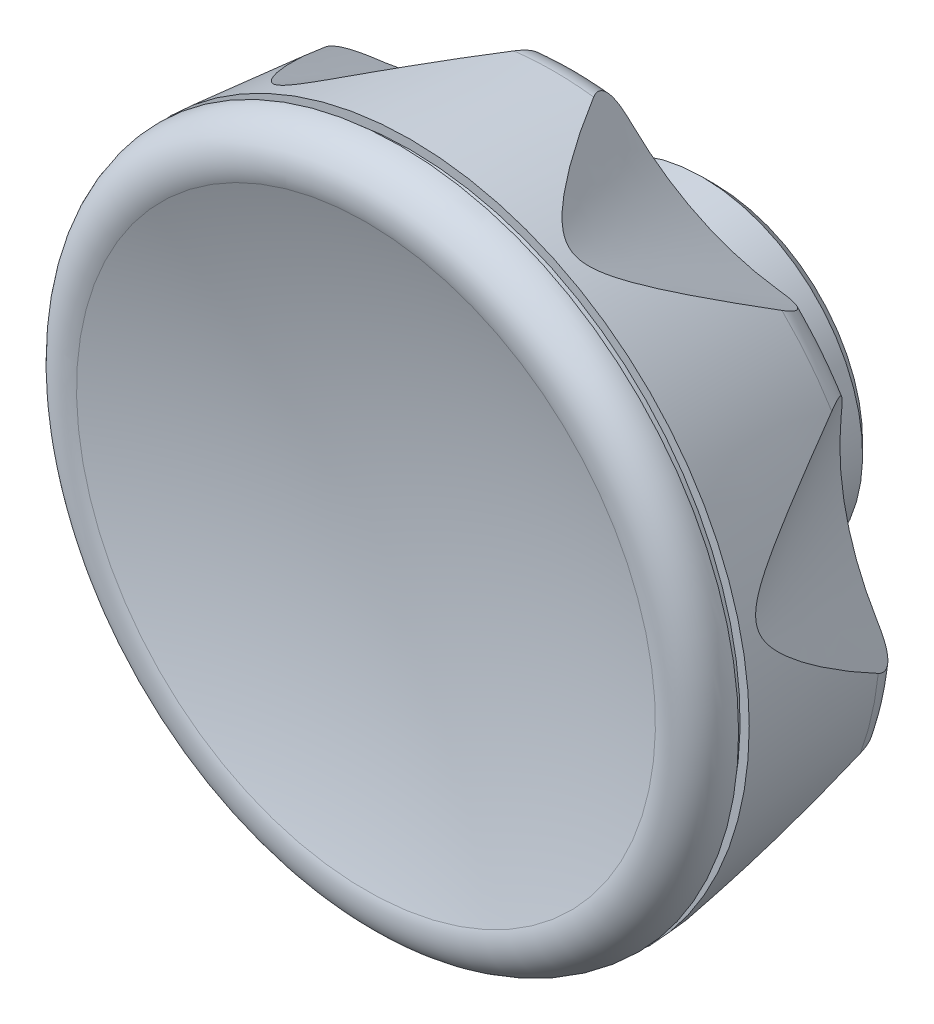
ISO-10303-21;
HEADER;
FILE_DESCRIPTION(('STEP AP214'),'2;1');
FILE_NAME('part.step','',(''),(''),'','','');
FILE_SCHEMA(('AUTOMOTIVE_DESIGN { 1 0 10303 214 1 1 1 1 }'));
ENDSEC;
DATA;
#1=APPLICATION_CONTEXT('core data for automotive mechanical design processes');
#2=APPLICATION_PROTOCOL_DEFINITION('international standard','automotive_design',2000,#1);
#3=PRODUCT_CONTEXT('',#1,'mechanical');
#4=PRODUCT('Part','Part','',(#3));
#5=PRODUCT_RELATED_PRODUCT_CATEGORY('part','',(#4));
#6=PRODUCT_DEFINITION_FORMATION('','',#4);
#7=PRODUCT_DEFINITION_CONTEXT('part definition',#1,'design');
#8=PRODUCT_DEFINITION('design','',#6,#7);
#9=PRODUCT_DEFINITION_SHAPE('','',#8);
#10=(LENGTH_UNIT() NAMED_UNIT(*) SI_UNIT(.MILLI.,.METRE.));
#11=(NAMED_UNIT(*) PLANE_ANGLE_UNIT() SI_UNIT($,.RADIAN.));
#12=(NAMED_UNIT(*) SI_UNIT($,.STERADIAN.) SOLID_ANGLE_UNIT());
#13=UNCERTAINTY_MEASURE_WITH_UNIT(LENGTH_MEASURE(1.E-05),#10,'distance_accuracy_value','');
#14=(GEOMETRIC_REPRESENTATION_CONTEXT(3) GLOBAL_UNCERTAINTY_ASSIGNED_CONTEXT((#13)) GLOBAL_UNIT_ASSIGNED_CONTEXT((#10,
#11,#12)) REPRESENTATION_CONTEXT('',''));
#15=CARTESIAN_POINT('',(0.,0.,0.));
#16=DIRECTION('',(0.,0.,1.));
#17=DIRECTION('',(1.,0.,0.));
#18=AXIS2_PLACEMENT_3D('',#15,#16,#17);
#19=CARTESIAN_POINT('',(0.,0.,13.5));
#20=DIRECTION('',(0.,0.,1.));
#21=DIRECTION('',(0.,1.,0.));
#22=AXIS2_PLACEMENT_3D('',#19,#20,#21);
#23=TOROIDAL_SURFACE('',#22,24.4738282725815,2.4999999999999);
#24=CARTESIAN_POINT('',(0.,0.,11.));
#25=DIRECTION('',(0.,0.,1.));
#26=DIRECTION('',(0.,1.,0.));
#27=AXIS2_PLACEMENT_3D('',#24,#25,#26);
#28=CIRCLE('',#27,24.4738282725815);
#29=CARTESIAN_POINT('',(-16.2379624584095,18.3111126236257,11.));
#30=VERTEX_POINT('',#29);
#31=CARTESIAN_POINT('',(-21.4653013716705,11.7562369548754,11.));
#32=VERTEX_POINT('',#31);
#33=EDGE_CURVE('E135',#30,#32,#28,.T.);
#34=ORIENTED_EDGE('',*,*,#33,.T.);
#35=CARTESIAN_POINT('',(-21.4653013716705,11.7562369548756,11.));
#36=CARTESIAN_POINT('',(-21.4754382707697,11.8601222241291,11.000030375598));
#37=CARTESIAN_POINT('',(-21.4872751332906,11.9639124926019,11.0020766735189));
#38=CARTESIAN_POINT('',(-21.5148402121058,12.1711325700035,11.0112222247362));
#39=CARTESIAN_POINT('',(-21.5305827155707,12.2745596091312,11.0183402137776));
#40=CARTESIAN_POINT('',(-21.5666560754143,12.4816775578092,11.0388207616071));
#41=CARTESIAN_POINT('',(-21.5870535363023,12.5853482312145,11.0522773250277));
#42=CARTESIAN_POINT('',(-21.6327777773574,12.79018793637,11.086761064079));
#43=CARTESIAN_POINT('',(-21.6580966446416,12.8913606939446,11.1077761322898));
#44=CARTESIAN_POINT('',(-21.7159025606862,13.096009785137,11.1604458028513));
#45=CARTESIAN_POINT('',(-21.7487343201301,13.1992460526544,11.1926745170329));
#46=CARTESIAN_POINT('',(-21.8208966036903,13.3985520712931,11.2692171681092));
#47=CARTESIAN_POINT('',(-21.8602062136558,13.494643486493,11.313492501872));
#48=CARTESIAN_POINT('',(-21.9242907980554,13.631369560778,11.3905180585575));
#49=CARTESIAN_POINT('',(-21.9466893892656,13.6760092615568,11.4182052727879));
#50=CARTESIAN_POINT('',(-21.9930436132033,13.7619364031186,11.4772174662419));
#51=CARTESIAN_POINT('',(-22.0169983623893,13.8032257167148,11.5085403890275));
#52=CARTESIAN_POINT('',(-22.0662965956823,13.8818232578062,11.574842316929));
#53=CARTESIAN_POINT('',(-22.0916394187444,13.919133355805,11.6098195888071));
#54=CARTESIAN_POINT('',(-22.1434758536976,13.9891694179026,11.6833341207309));
#55=CARTESIAN_POINT('',(-22.1699692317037,14.0218963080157,11.7218706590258));
#56=CARTESIAN_POINT('',(-22.2204575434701,14.0784837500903,11.7972787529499));
#57=CARTESIAN_POINT('',(-22.2443568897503,14.1029401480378,11.8337680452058));
#58=CARTESIAN_POINT('',(-22.2925479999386,14.147619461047,11.9090357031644));
#59=CARTESIAN_POINT('',(-22.3168398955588,14.1678409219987,11.9478148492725));
#60=CARTESIAN_POINT('',(-22.3655101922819,14.2038164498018,12.0272744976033));
#61=CARTESIAN_POINT('',(-22.3898884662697,14.2195754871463,12.0679528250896));
#62=CARTESIAN_POINT('',(-22.4384945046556,14.2465760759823,12.1508760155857));
#63=CARTESIAN_POINT('',(-22.4627222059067,14.2578158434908,12.1931214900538));
#64=CARTESIAN_POINT('',(-22.5288434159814,14.2825299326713,12.3109990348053));
#65=CARTESIAN_POINT('',(-22.5703388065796,14.2913426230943,12.3878768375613));
#66=CARTESIAN_POINT('',(-22.6510509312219,14.2958836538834,12.5432786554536));
#67=CARTESIAN_POINT('',(-22.6902625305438,14.2915835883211,12.6218058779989));
#68=CARTESIAN_POINT('',(-22.7755265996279,14.2684993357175,12.7992847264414));
#69=CARTESIAN_POINT('',(-22.8206927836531,14.246227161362,12.8982168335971));
#70=CARTESIAN_POINT('',(-22.8841902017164,14.2010917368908,13.044286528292));
#71=CARTESIAN_POINT('',(-22.9046065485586,14.184142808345,13.0924834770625));
#72=CARTESIAN_POINT('',(-22.9440559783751,14.146710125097,13.187982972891));
#73=CARTESIAN_POINT('',(-22.9630908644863,14.1262311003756,13.2352866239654));
#74=CARTESIAN_POINT('',(-22.9814573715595,14.1041446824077,13.2821097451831));
#75=B_SPLINE_CURVE_WITH_KNOTS('',3,(#35,#36,#37,#38,#39,#40,#41,#42,#43,#44,#45,#46,#47,#48,#49,
#50,#51,#52,#53,#54,#55,#56,#57,#58,#59,#60,#61,#62,#63,#64,#65,#66,#67,#68,#69,#70,#71,#72,#73,
#74),.UNSPECIFIED.,.F.,.F.,(4,2,2,2,2,2,2,2,2,2,2,2,2,2,2,2,2,2,2,4),(0.,0.313209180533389,
0.627581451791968,0.946770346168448,1.26545021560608,1.60369981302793,1.94087800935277,
2.11199734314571,2.28302035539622,2.45396261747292,2.62487029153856,2.77466826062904,
2.92451758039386,3.07419932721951,3.22394010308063,3.48614173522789,3.74891177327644,
4.08027673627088,4.24522540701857,4.40995475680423),.UNSPECIFIED.);
#76=CARTESIAN_POINT('',(-22.981457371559,14.1041446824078,13.2821097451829));
#77=VERTEX_POINT('',#76);
#78=EDGE_CURVE('E119',#32,#77,#75,.T.);
#79=ORIENTED_EDGE('',*,*,#78,.T.);
#80=CARTESIAN_POINT('',(0.,0.,13.282109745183));
#81=DIRECTION('',(0.,0.,1.));
#82=DIRECTION('',(0.,1.,0.));
#83=AXIS2_PLACEMENT_3D('',#80,#81,#82);
#84=CIRCLE('',#83,26.9643149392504);
#85=CARTESIAN_POINT('',(-18.8643796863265,19.2667968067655,13.282109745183));
#86=VERTEX_POINT('',#85);
#87=EDGE_CURVE('E150',#86,#77,#84,.T.);
#88=ORIENTED_EDGE('',*,*,#87,.F.);
#89=CARTESIAN_POINT('',(-18.8643796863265,19.2667968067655,13.282109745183));
#90=CARTESIAN_POINT('',(-18.8981743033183,19.2226732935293,13.1915305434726));
#91=CARTESIAN_POINT('',(-18.9255552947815,19.1772447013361,13.0988167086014));
#92=CARTESIAN_POINT('',(-18.9651950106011,19.0843052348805,12.9100927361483));
#93=CARTESIAN_POINT('',(-18.9773008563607,19.0367781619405,12.8140590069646));
#94=CARTESIAN_POINT('',(-18.983341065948,18.9407957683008,12.6209607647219));
#95=CARTESIAN_POINT('',(-18.9771650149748,18.8923365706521,12.5238935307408));
#96=CARTESIAN_POINT('',(-18.9442986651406,18.7968510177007,12.3329550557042));
#97=CARTESIAN_POINT('',(-18.917699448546,18.7498192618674,12.2390715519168));
#98=CARTESIAN_POINT('',(-18.8474169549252,18.6641060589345,12.0674765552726));
#99=CARTESIAN_POINT('',(-18.8058006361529,18.6250650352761,11.9890989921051));
#100=CARTESIAN_POINT('',(-18.7069025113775,18.5516039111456,11.8403817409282));
#101=CARTESIAN_POINT('',(-18.6496092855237,18.5171872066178,11.7700479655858));
#102=CARTESIAN_POINT('',(-18.5279204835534,18.457227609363,11.6454449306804));
#103=CARTESIAN_POINT('',(-18.4646762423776,18.4311577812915,11.5902907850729));
#104=CARTESIAN_POINT('',(-18.3299240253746,18.3843608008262,11.4887242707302));
#105=CARTESIAN_POINT('',(-18.2584221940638,18.3636297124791,11.4423054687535));
#106=CARTESIAN_POINT('',(-18.0741590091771,18.3189481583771,11.3379996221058));
#107=CARTESIAN_POINT('',(-17.9578593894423,18.2981009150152,11.2850492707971));
#108=CARTESIAN_POINT('',(-17.7173155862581,18.2668011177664,11.1949523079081));
#109=CARTESIAN_POINT('',(-17.5930199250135,18.2564250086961,11.1579230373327));
#110=CARTESIAN_POINT('',(-17.3654004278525,18.2458816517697,11.1030967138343));
#111=CARTESIAN_POINT('',(-17.2626807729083,18.2441255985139,11.0829631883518));
#112=CARTESIAN_POINT('',(-17.0560091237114,18.2457463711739,11.0499258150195));
#113=CARTESIAN_POINT('',(-16.9520556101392,18.2491303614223,11.0370320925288));
#114=CARTESIAN_POINT('',(-16.7461255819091,18.260237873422,11.0174873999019));
#115=CARTESIAN_POINT('',(-16.6441552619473,18.2678653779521,11.0107067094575));
#116=CARTESIAN_POINT('',(-16.4406884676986,18.2868392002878,11.0019849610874));
#117=CARTESIAN_POINT('',(-16.3391915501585,18.2981729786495,11.000027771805));
#118=CARTESIAN_POINT('',(-16.2379624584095,18.3111126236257,11.));
#119=B_SPLINE_CURVE_WITH_KNOTS('',3,(#89,#90,#91,#92,#93,#94,#95,#96,#97,#98,#99,#100,#101,#102,
#103,#104,#105,#106,#107,#108,#109,#110,#111,#112,#113,#114,#115,#116,#117,#118),.UNSPECIFIED.,
.F.,.F.,(4,2,2,2,2,2,2,2,2,2,2,2,2,2,4),(0.,0.319088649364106,0.641346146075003,
0.96555390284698,1.28832411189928,1.57749027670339,1.86686764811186,2.12940978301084,
2.39175780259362,2.77800167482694,3.16704536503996,3.48068996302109,3.79477212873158,
4.10202079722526,4.40824052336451),.UNSPECIFIED.);
#120=EDGE_CURVE('E140',#86,#30,#119,.T.);
#121=ORIENTED_EDGE('',*,*,#120,.T.);
#122=EDGE_LOOP('',(#34,#79,#88,#121));
#123=FACE_BOUND('',#122,.T.);
#124=ADVANCED_FACE('F14',(#123),#23,.T.);
#125=CARTESIAN_POINT('',(-26.8251366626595,-2.73611461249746,13.282109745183));
#126=VERTEX_POINT('',#125);
#127=CARTESIAN_POINT('',(-25.355768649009,-9.17383651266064,13.282109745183));
#128=VERTEX_POINT('',#127);
#129=EDGE_CURVE('E157',#126,#128,#84,.T.);
#130=ORIENTED_EDGE('',*,*,#129,.F.);
#131=CARTESIAN_POINT('',(-26.8251366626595,-2.73611461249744,13.282109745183));
#132=CARTESIAN_POINT('',(-26.8117101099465,-2.79004686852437,13.1915305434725));
#133=CARTESIAN_POINT('',(-26.7932643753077,-2.83977845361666,13.0988167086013));
#134=CARTESIAN_POINT('',(-26.7453163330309,-2.92871684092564,12.9100927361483));
#135=CARTESIAN_POINT('',(-26.7157060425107,-2.96781421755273,12.8140590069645));
#136=CARTESIAN_POINT('',(-26.6444299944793,-3.0323806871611,12.620960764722));
#137=CARTESIAN_POINT('',(-26.602692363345,-3.0577658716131,12.5238935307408));
#138=CARTESIAN_POINT('',(-26.507546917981,-3.09160419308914,12.3329550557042));
#139=CARTESIAN_POINT('',(-26.4541916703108,-3.10013190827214,12.2390715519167));
#140=CARTESIAN_POINT('',(-26.3433579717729,-3.09862415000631,12.0674765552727));
#141=CARTESIAN_POINT('',(-26.2868871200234,-3.09042888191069,11.9890989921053));
#142=CARTESIAN_POINT('',(-26.1677909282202,-3.05890947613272,11.8403817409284));
#143=CARTESIAN_POINT('',(-26.1051611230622,-3.03557429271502,11.7700479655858));
#144=CARTESIAN_POINT('',(-25.9824110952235,-2.97781835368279,11.6454449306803));
#145=CARTESIAN_POINT('',(-25.9225967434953,-2.94462628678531,11.590290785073));
#146=CARTESIAN_POINT('',(-25.8019927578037,-2.86845020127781,11.4887242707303));
#147=CARTESIAN_POINT('',(-25.7412038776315,-2.82547344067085,11.4423054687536));
#148=CARTESIAN_POINT('',(-25.5913842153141,-2.70926917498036,11.3379996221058));
#149=CARTESIAN_POINT('',(-25.5025735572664,-2.63134051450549,11.2850492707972));
#150=CARTESIAN_POINT('',(-25.3281257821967,-2.46279090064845,11.194952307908));
#151=CARTESIAN_POINT('',(-25.2425163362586,-2.37208203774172,11.1579230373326));
#152=CARTESIAN_POINT('',(-25.0923547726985,-2.20069562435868,11.1030967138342));
#153=CARTESIAN_POINT('',(-25.0269371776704,-2.12148104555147,11.0829631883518));
#154=CARTESIAN_POINT('',(-24.8993466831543,-1.95888810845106,11.0499258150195));
#155=CARTESIAN_POINT('',(-24.8371784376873,-1.87550409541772,11.0370320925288));
#156=CARTESIAN_POINT('',(-24.7174673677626,-1.70757609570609,11.0174873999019));
#157=CARTESIAN_POINT('',(-24.6598533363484,-1.62309681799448,11.0107067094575));
#158=CARTESIAN_POINT('',(-24.5478281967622,-1.45219008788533,11.0019849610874));
#159=CARTESIAN_POINT('',(-24.4934070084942,-1.365770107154,11.000027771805));
#160=CARTESIAN_POINT('',(-24.4404083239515,-1.27855827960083,11.));
#161=B_SPLINE_CURVE_WITH_KNOTS('',3,(#131,#132,#133,#134,#135,#136,#137,#138,#139,#140,#141,
#142,#143,#144,#145,#146,#147,#148,#149,#150,#151,#152,#153,#154,#155,#156,#157,#158,#159,#160),
.UNSPECIFIED.,.F.,.F.,(4,2,2,2,2,2,2,2,2,2,2,2,2,2,4),(0.,0.319088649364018,0.641346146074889,
0.965553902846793,1.288324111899,1.57749027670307,1.8668676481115,2.12940978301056,
2.39175780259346,2.77800167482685,3.16704536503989,3.4806899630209,3.79477212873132,
4.10202079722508,4.40824052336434),.UNSPECIFIED.);
#162=CARTESIAN_POINT('',(-24.4404083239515,-1.27855827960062,11.));
#163=VERTEX_POINT('',#162);
#164=EDGE_CURVE('E34',#126,#163,#161,.T.);
#165=ORIENTED_EDGE('',*,*,#164,.T.);
#166=CARTESIAN_POINT('',(-22.5747926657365,-9.45235454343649,11.));
#167=VERTEX_POINT('',#166);
#168=EDGE_CURVE('E137',#163,#167,#28,.T.);
#169=ORIENTED_EDGE('',*,*,#168,.T.);
#170=CARTESIAN_POINT('',(-22.5747926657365,-9.45235454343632,11.));
#171=CARTESIAN_POINT('',(-22.6623336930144,-9.39550848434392,11.000030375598));
#172=CARTESIAN_POINT('',(-22.7508603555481,-9.34005074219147,11.0020766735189));
#173=CARTESIAN_POINT('',(-22.930058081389,-9.23240238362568,11.0112222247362));
#174=CARTESIAN_POINT('',(-23.0207358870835,-9.18022466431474,11.0183402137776));
#175=CARTESIAN_POINT('',(-23.2051585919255,-9.07929202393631,11.0388207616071));
#176=CARTESIAN_POINT('',(-23.2989291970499,-9.03060179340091,11.0522773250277));
#177=CARTESIAN_POINT('',(-23.4875879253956,-8.93863497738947,11.0867610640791));
#178=CARTESIAN_POINT('',(-23.5824740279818,-8.89534988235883,11.1077761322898));
#179=CARTESIAN_POINT('',(-23.7785165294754,-8.81294774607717,11.1604458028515));
#180=CARTESIAN_POINT('',(-23.8797001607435,-8.77424988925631,11.1926745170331));
#181=CARTESIAN_POINT('',(-24.0805163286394,-8.70640336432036,11.2692171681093));
#182=CARTESIAN_POINT('',(-24.1801527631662,-8.67722483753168,11.3134925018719));
#183=CARTESIAN_POINT('',(-24.3270055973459,-8.64208087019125,11.3905180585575));
#184=CARTESIAN_POINT('',(-24.3758716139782,-8.63176039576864,11.4182052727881));
#185=CARTESIAN_POINT('',(-24.4719535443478,-8.6144268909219,11.4772174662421));
#186=CARTESIAN_POINT('',(-24.5191703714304,-8.60741200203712,11.5085403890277));
#187=CARTESIAN_POINT('',(-24.611357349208,-8.59695014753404,11.5748423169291));
#188=CARTESIAN_POINT('',(-24.6563285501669,-8.59350149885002,11.6098195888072));
#189=CARTESIAN_POINT('',(-24.7434044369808,-8.59036208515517,11.683334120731));
#190=CARTESIAN_POINT('',(-24.785509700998,-8.59067055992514,11.721870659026));
#191=CARTESIAN_POINT('',(-24.8612304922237,-8.594862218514,11.79727875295));
#192=CARTESIAN_POINT('',(-24.8952522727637,-8.59829916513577,11.8337680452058));
#193=CARTESIAN_POINT('',(-24.960230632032,-8.60811939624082,11.9090357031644));
#194=CARTESIAN_POINT('',(-24.9911861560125,-8.61450369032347,11.9478148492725));
#195=CARTESIAN_POINT('',(-25.0496583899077,-8.63012528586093,12.0272744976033));
#196=CARTESIAN_POINT('',(-25.0771789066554,-8.63935938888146,12.0679528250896));
#197=CARTESIAN_POINT('',(-25.1285941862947,-8.66052652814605,12.1508760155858));
#198=CARTESIAN_POINT('',(-25.152487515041,-8.67246062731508,12.1931214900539));
#199=CARTESIAN_POINT('',(-25.2130356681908,-8.70874728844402,12.3109990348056));
#200=CARTESIAN_POINT('',(-25.2457976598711,-8.73569506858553,12.3878768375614));
#201=CARTESIAN_POINT('',(-25.2996711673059,-8.79596706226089,12.5432786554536));
#202=CARTESIAN_POINT('',(-25.3207572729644,-8.82930497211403,12.621805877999));
#203=CARTESIAN_POINT('',(-25.3558705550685,-8.91035990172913,12.7992847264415));
#204=CARTESIAN_POINT('',(-25.3666181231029,-8.9595587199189,12.8982168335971));
#205=CARTESIAN_POINT('',(-25.3709198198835,-9.03734447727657,13.0442865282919));
#206=CARTESIAN_POINT('',(-25.3703979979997,-9.0638741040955,13.0924834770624));
#207=CARTESIAN_POINT('',(-25.3657282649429,-9.11805580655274,13.1879829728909));
#208=CARTESIAN_POINT('',(-25.3615851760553,-9.14570634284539,13.2352866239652));
#209=CARTESIAN_POINT('',(-25.355768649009,-9.17383651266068,13.282109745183));
#210=B_SPLINE_CURVE_WITH_KNOTS('',3,(#170,#171,#172,#173,#174,#175,#176,#177,#178,#179,#180,
#181,#182,#183,#184,#185,#186,#187,#188,#189,#190,#191,#192,#193,#194,#195,#196,#197,#198,#199,
#200,#201,#202,#203,#204,#205,#206,#207,#208,#209),.UNSPECIFIED.,.F.,.F.,(4,2,2,2,2,2,2,2,2,2,2,
2,2,2,2,2,2,2,2,4),(0.,0.313209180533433,0.627581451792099,0.946770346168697,1.26545021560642,
1.60369981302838,1.9408780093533,2.11199734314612,2.28302035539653,2.45396261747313,
2.62487029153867,2.77466826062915,2.92451758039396,3.07419932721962,3.22394010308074,
3.48614173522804,3.74891177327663,4.08027673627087,4.24522540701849,4.40995475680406),.UNSPECIFIED.);
#211=EDGE_CURVE('E301',#167,#128,#210,.T.);
#212=ORIENTED_EDGE('',*,*,#211,.T.);
#213=EDGE_LOOP('',(#130,#165,#169,#212));
#214=FACE_BOUND('',#213,.T.);
#215=ADVANCED_FACE('F411',(#214),#23,.T.);
#216=CARTESIAN_POINT('',(-14.586018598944,-22.6786759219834,13.282109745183));
#217=VERTEX_POINT('',#216);
#218=CARTESIAN_POINT('',(-8.63666897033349,-25.5437317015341,13.282109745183));
#219=VERTEX_POINT('',#218);
#220=EDGE_CURVE('E161',#217,#219,#84,.T.);
#221=ORIENTED_EDGE('',*,*,#220,.F.);
#222=CARTESIAN_POINT('',(-14.586018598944,-22.6786759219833,13.282109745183));
#223=CARTESIAN_POINT('',(-14.5354813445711,-22.7018048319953,13.1915305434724));
#224=CARTESIAN_POINT('',(-14.4850988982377,-22.7183905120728,13.0988167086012));
#225=CARTESIAN_POINT('',(-14.3856689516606,-22.736355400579,12.9100927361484));
#226=CARTESIAN_POINT('',(-14.336639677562,-22.7375819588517,12.8140590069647));
#227=CARTESIAN_POINT('',(-14.2417196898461,-22.7221126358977,12.620960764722));
#228=CARTESIAN_POINT('',(-14.1958497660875,-22.7053082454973,12.5238935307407));
#229=CARTESIAN_POINT('',(-14.1100716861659,-22.6520183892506,12.3329550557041));
#230=CARTESIAN_POINT('',(-14.070137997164,-22.6156205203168,12.2390715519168));
#231=CARTESIAN_POINT('',(-14.0022131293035,-22.5280271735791,12.0674765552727));
#232=CARTESIAN_POINT('',(-13.9734114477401,-22.4787668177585,11.9890989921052));
#233=CARTESIAN_POINT('',(-13.9237990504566,-22.3660016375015,11.8403817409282));
#234=CARTESIAN_POINT('',(-13.9029941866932,-22.3024864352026,11.7700479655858));
#235=CARTESIAN_POINT('',(-13.8716162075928,-22.1705063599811,11.6454449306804));
#236=CARTESIAN_POINT('',(-13.8602731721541,-22.1030467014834,11.590290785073));
#237=CARTESIAN_POINT('',(-13.8446346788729,-21.9612596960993,11.4887242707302));
#238=CARTESIAN_POINT('',(-13.8403340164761,-21.8869374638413,11.4423054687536));
#239=CARTESIAN_POINT('',(-13.8377751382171,-21.6973515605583,11.3379996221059));
#240=CARTESIAN_POINT('',(-13.8433296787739,-21.5793288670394,11.2850492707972));
#241=CARTESIAN_POINT('',(-13.8663406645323,-21.3378511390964,11.194952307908));
#242=CARTESIAN_POINT('',(-13.8838830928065,-21.2143629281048,11.1579230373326));
#243=CARTESIAN_POINT('',(-13.9242541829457,-20.9901042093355,11.1030967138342));
#244=CARTESIAN_POINT('',(-13.9453994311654,-20.8895691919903,11.0829631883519));
#245=CARTESIAN_POINT('',(-13.9929683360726,-20.6884398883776,11.0499258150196));
#246=CARTESIAN_POINT('',(-14.0193993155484,-20.5878457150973,11.0370320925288));
#247=CARTESIAN_POINT('',(-14.0760520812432,-20.3895504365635,11.0174873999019));
#248=CARTESIAN_POINT('',(-14.1061788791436,-20.2918340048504,11.0107067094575));
#249=CARTESIAN_POINT('',(-14.1699526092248,-20.097690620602,11.0019849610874));
#250=CARTESIAN_POINT('',(-14.2035874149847,-20.001260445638,11.000027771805));
#251=CARTESIAN_POINT('',(-14.238728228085,-19.9054487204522,11.));
#252=B_SPLINE_CURVE_WITH_KNOTS('',3,(#222,#223,#224,#225,#226,#227,#228,#229,#230,#231,#232,
#233,#234,#235,#236,#237,#238,#239,#240,#241,#242,#243,#244,#245,#246,#247,#248,#249,#250,#251),
.UNSPECIFIED.,.F.,.F.,(4,2,2,2,2,2,2,2,2,2,2,2,2,2,4),(0.,0.319088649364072,0.641346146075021,
0.965553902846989,1.28832411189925,1.5774902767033,1.86686764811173,2.12940978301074,
2.39175780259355,2.77800167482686,3.16704536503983,3.48068996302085,3.79477212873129,
4.10202079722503,4.40824052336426),.UNSPECIFIED.);
#253=CARTESIAN_POINT('',(-14.238728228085,-19.905448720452,11.));
#254=VERTEX_POINT('',#253);
#255=EDGE_CURVE('E42',#217,#254,#252,.T.);
#256=ORIENTED_EDGE('',*,*,#255,.T.);
#257=CARTESIAN_POINT('',(-6.685004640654,-23.5431302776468,11.));
#258=VERTEX_POINT('',#257);
#259=EDGE_CURVE('E147',#254,#258,#28,.T.);
#260=ORIENTED_EDGE('',*,*,#259,.T.);
#261=CARTESIAN_POINT('',(-6.685004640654,-23.5431302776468,11.));
#262=CARTESIAN_POINT('',(-6.78402961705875,-23.5761296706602,11.000030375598));
#263=CARTESIAN_POINT('',(-6.88258369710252,-23.6107652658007,11.0020766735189));
#264=CARTESIAN_POINT('',(-7.07847452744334,-23.6837500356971,11.0112222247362));
#265=CARTESIAN_POINT('',(-7.17580539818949,-23.7221125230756,11.0183402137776));
#266=CARTESIAN_POINT('',(-7.36970338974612,-23.8033695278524,11.0388207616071));
#267=CARTESIAN_POINT('',(-7.46623596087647,-23.8463244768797,11.0522773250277));
#268=CARTESIAN_POINT('',(-7.65576530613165,-23.9364834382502,11.0867610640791));
#269=CARTESIAN_POINT('',(-7.74876747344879,-23.9836805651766,11.1077761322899));
#270=CARTESIAN_POINT('',(-7.93542255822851,-24.0855758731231,11.1604458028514));
#271=CARTESIAN_POINT('',(-8.02876472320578,-24.1405567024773,11.192674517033));
#272=CARTESIAN_POINT('',(-8.2070161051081,-24.2552594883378,11.2692171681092));
#273=CARTESIAN_POINT('',(-8.29195109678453,-24.3149658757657,11.313492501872));
#274=CARTESIAN_POINT('',(-8.41098900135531,-24.4078681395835,11.3905180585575));
#275=CARTESIAN_POINT('',(-8.44952533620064,-24.4396384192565,11.418205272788));
#276=CARTESIAN_POINT('',(-8.52298331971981,-24.5039510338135,11.477217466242));
#277=CARTESIAN_POINT('',(-8.55790699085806,-24.5364929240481,11.5085403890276));
#278=CARTESIAN_POINT('',(-8.62356403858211,-24.602044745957,11.5748423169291));
#279=CARTESIAN_POINT('',(-8.65429938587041,-24.6350544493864,11.6098195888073));
#280=CARTESIAN_POINT('',(-8.71104480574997,-24.7011757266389,11.683334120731));
#281=CARTESIAN_POINT('',(-8.73705583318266,-24.7342872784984,11.7218706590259));
#282=CARTESIAN_POINT('',(-8.78098980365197,-24.796101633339,11.7972787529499));
#283=CARTESIAN_POINT('',(-8.79951492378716,-24.824843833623,11.8337680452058));
#284=CARTESIAN_POINT('',(-8.8323505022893,-24.8817687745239,11.9090357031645));
#285=CARTESIAN_POINT('',(-8.84665951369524,-24.9099513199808,11.9478148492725));
#286=CARTESIAN_POINT('',(-8.87090290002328,-24.9654066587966,12.0272744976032));
#287=CARTESIAN_POINT('',(-8.88084214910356,-24.9926804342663,12.0679528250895));
#288=CARTESIAN_POINT('',(-8.89634991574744,-25.0460760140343,12.1508760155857));
#289=CARTESIAN_POINT('',(-8.90191670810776,-25.0721973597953,12.1931214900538));
#290=CARTESIAN_POINT('',(-8.91129781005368,-25.1421601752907,12.3109990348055));
#291=CARTESIAN_POINT('',(-8.91065595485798,-25.1845761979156,12.3878768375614));
#292=CARTESIAN_POINT('',(-8.8971229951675,-25.2642751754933,12.5432786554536));
#293=CARTESIAN_POINT('',(-8.88420533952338,-25.3015468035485,12.621805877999));
#294=CARTESIAN_POINT('',(-8.84272681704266,-25.3795363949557,12.7992847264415));
#295=CARTESIAN_POINT('',(-8.81096263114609,-25.4186141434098,12.8982168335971));
#296=CARTESIAN_POINT('',(-8.75282934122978,-25.4704759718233,13.044286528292));
#297=CARTESIAN_POINT('',(-8.73176229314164,-25.486608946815,13.0924834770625));
#298=CARTESIAN_POINT('',(-8.68648980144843,-25.5167397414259,13.187982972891));
#299=CARTESIAN_POINT('',(-8.66228856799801,-25.5307403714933,13.2352866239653));
#300=CARTESIAN_POINT('',(-8.63666897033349,-25.5437317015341,13.2821097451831));
#301=B_SPLINE_CURVE_WITH_KNOTS('',3,(#261,#262,#263,#264,#265,#266,#267,#268,#269,#270,#271,
#272,#273,#274,#275,#276,#277,#278,#279,#280,#281,#282,#283,#284,#285,#286,#287,#288,#289,#290,
#291,#292,#293,#294,#295,#296,#297,#298,#299,#300),.UNSPECIFIED.,.F.,.F.,(4,2,2,2,2,2,2,2,2,2,2,
2,2,2,2,2,2,2,2,4),(0.,0.313209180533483,0.627581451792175,0.946770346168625,1.26545021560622,
1.60369981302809,1.940878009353,2.11199734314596,2.28302035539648,2.45396261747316,
2.62487029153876,2.77466826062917,2.92451758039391,3.07419932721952,3.22394010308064,
3.48614173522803,3.74891177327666,4.0802767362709,4.24522540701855,4.40995475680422),.UNSPECIFIED.);
#302=EDGE_CURVE('E317',#258,#219,#301,.T.);
#303=ORIENTED_EDGE('',*,*,#302,.T.);
#304=EDGE_LOOP('',(#221,#256,#260,#303));
#305=FACE_BOUND('',#304,.T.);
#306=ADVANCED_FACE('F441',(#305),#23,.T.);
#307=CARTESIAN_POINT('',(8.636668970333,-25.5437317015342,13.282109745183));
#308=VERTEX_POINT('',#307);
#309=CARTESIAN_POINT('',(14.586018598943,-22.6786759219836,13.282109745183));
#310=VERTEX_POINT('',#309);
#311=EDGE_CURVE('E449',#308,#310,#84,.T.);
#312=ORIENTED_EDGE('',*,*,#311,.F.);
#313=CARTESIAN_POINT('',(8.636668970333,-25.5437317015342,13.2821097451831));
#314=CARTESIAN_POINT('',(8.68626134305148,-25.5186407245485,13.1915305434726));
#315=CARTESIAN_POINT('',(8.73064149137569,-25.4895911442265,13.0988167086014));
#316=CARTESIAN_POINT('',(8.80668056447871,-25.4230546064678,12.9100927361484));
#317=CARTESIAN_POINT('',(8.83820877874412,-25.3854867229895,12.8140590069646));
#318=CARTESIAN_POINT('',(8.88529601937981,-25.3016303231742,12.6209607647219));
#319=CARTESIAN_POINT('',(8.90075724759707,-25.2552904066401,12.5238935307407));
#320=CARTESIAN_POINT('',(8.91257531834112,-25.1550007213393,12.3329550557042));
#321=CARTESIAN_POINT('',(8.90901656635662,-25.1010856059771,12.2390715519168));
#322=CARTESIAN_POINT('',(8.88288379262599,-24.9933662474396,12.0674765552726));
#323=CARTESIAN_POINT('',(8.8623280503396,-24.9401348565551,11.9890989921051));
#324=CARTESIAN_POINT('',(8.80509750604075,-24.8310383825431,11.8403817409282));
#325=CARTESIAN_POINT('',(8.76841094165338,-24.7751714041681,11.7700479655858));
#326=CARTESIAN_POINT('',(8.68478861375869,-24.6683508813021,11.6454449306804));
#327=CARTESIAN_POINT('',(8.63911879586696,-24.6174221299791,11.5902907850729));
#328=CARTESIAN_POINT('',(8.53801569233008,-24.5167927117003,11.4887242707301));
#329=CARTESIAN_POINT('',(8.48258965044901,-24.4670911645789,11.4423054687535));
#330=CARTESIAN_POINT('',(8.33596085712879,-24.3468856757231,11.3379996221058));
#331=CARTESIAN_POINT('',(8.24022380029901,-24.277642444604,11.285049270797));
#332=CARTESIAN_POINT('',(8.03708179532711,-24.1450742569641,11.194952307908));
#333=CARTESIAN_POINT('',(7.9295972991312,-24.081795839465,11.1579230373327));
#334=CARTESIAN_POINT('',(7.72909380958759,-23.9735362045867,11.1030967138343));
#335=CARTESIAN_POINT('',(7.63730852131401,-23.9273856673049,11.0829631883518));
#336=CARTESIAN_POINT('',(7.45040057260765,-23.8391744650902,11.0499258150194));
#337=CARTESIAN_POINT('',(7.35527343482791,-23.7971195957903,11.0370320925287));
#338=CARTESIAN_POINT('',(7.16491752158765,-23.7177774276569,11.0174873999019));
#339=CARTESIAN_POINT('',(7.06973598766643,-23.6804063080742,11.0107067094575));
#340=CARTESIAN_POINT('',(6.87818630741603,-23.6092201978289,11.0019849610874));
#341=CARTESIAN_POINT('',(6.78182320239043,-23.5753937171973,11.000027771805));
#342=CARTESIAN_POINT('',(6.6850046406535,-23.543130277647,11.));
#343=B_SPLINE_CURVE_WITH_KNOTS('',3,(#313,#314,#315,#316,#317,#318,#319,#320,#321,#322,#323,
#324,#325,#326,#327,#328,#329,#330,#331,#332,#333,#334,#335,#336,#337,#338,#339,#340,#341,#342),
.UNSPECIFIED.,.F.,.F.,(4,2,2,2,2,2,2,2,2,2,2,2,2,2,4),(0.,0.319088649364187,0.641346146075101,
0.965553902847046,1.28832411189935,1.57749027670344,1.86686764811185,2.12940978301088,
2.39175780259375,2.77800167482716,3.16704536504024,3.48068996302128,3.79477212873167,
4.1020207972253,4.40824052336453),.UNSPECIFIED.);
#344=CARTESIAN_POINT('',(6.685004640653,-23.5431302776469,11.));
#345=VERTEX_POINT('',#344);
#346=EDGE_CURVE('E310',#308,#345,#343,.T.);
#347=ORIENTED_EDGE('',*,*,#346,.T.);
#348=CARTESIAN_POINT('',(14.2387282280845,-19.9054487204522,11.));
#349=VERTEX_POINT('',#348);
#350=EDGE_CURVE('E443',#345,#349,#28,.T.);
#351=ORIENTED_EDGE('',*,*,#350,.T.);
#352=CARTESIAN_POINT('',(14.2387282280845,-19.9054487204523,11.));
#353=CARTESIAN_POINT('',(14.202787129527,-20.0034443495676,11.000030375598));
#354=CARTESIAN_POINT('',(14.168418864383,-20.1020919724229,11.0020766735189));
#355=CARTESIAN_POINT('',(14.1033447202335,-20.3007508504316,11.0112222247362));
#356=CARTESIAN_POINT('',(14.0726529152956,-20.4007658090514,11.0183402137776));
#357=CARTESIAN_POINT('',(14.0152887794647,-20.6030242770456,11.038820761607));
#358=CARTESIAN_POINT('',(13.9886852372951,-20.7052784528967,11.0522773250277));
#359=CARTESIAN_POINT('',(13.9410047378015,-20.9096716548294,11.086761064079));
#360=CARTESIAN_POINT('',(13.9199190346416,-21.0118106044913,11.1077761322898));
#361=CARTESIAN_POINT('',(13.8832064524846,-21.2212741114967,11.1604458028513));
#362=CARTESIAN_POINT('',(13.8679943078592,-21.3285319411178,11.1926745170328));
#363=CARTESIAN_POINT('',(13.8465346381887,-21.5394105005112,11.269217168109));
#364=CARTESIAN_POINT('',(13.8402588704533,-21.6430416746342,11.3134925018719));
#365=CARTESIAN_POINT('',(13.8386738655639,-21.7940328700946,11.3905180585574));
#366=CARTESIAN_POINT('',(13.8394858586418,-21.843970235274,11.4182052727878));
#367=CARTESIAN_POINT('',(13.8439671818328,-21.9415002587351,11.4772174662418));
#368=CARTESIAN_POINT('',(13.8476349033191,-21.9890942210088,11.5085403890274));
#369=CARTESIAN_POINT('',(13.8579488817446,-22.0812978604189,11.5748423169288));
#370=CARTESIAN_POINT('',(13.8645937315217,-22.1259089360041,11.609819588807));
#371=CARTESIAN_POINT('',(13.8809092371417,-22.2115002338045,11.6833341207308));
#372=CARTESIAN_POINT('',(13.8905792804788,-22.2524811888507,11.7218706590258));
#373=CARTESIAN_POINT('',(13.9115153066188,-22.3253707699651,11.7972787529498));
#374=CARTESIAN_POINT('',(13.9224366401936,-22.3577747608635,11.8337680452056));
#375=CARTESIAN_POINT('',(13.9464697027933,-22.4189387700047,11.9090357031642));
#376=CARTESIAN_POINT('',(13.9595821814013,-22.4476975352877,11.9478148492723));
#377=CARTESIAN_POINT('',(13.9878234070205,-22.5012276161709,12.0272744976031));
#378=CARTESIAN_POINT('',(14.0029498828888,-22.5260033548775,12.0679528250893));
#379=CARTESIAN_POINT('',(14.0350272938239,-22.5714194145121,12.1508760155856));
#380=CARTESIAN_POINT('',(14.0519789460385,-22.5920581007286,12.1931214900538));
#381=CARTESIAN_POINT('',(14.1008290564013,-22.6430136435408,12.3109990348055));
#382=CARTESIAN_POINT('',(14.1343914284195,-22.6689577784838,12.3878768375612));
#383=CARTESIAN_POINT('',(14.2051402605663,-22.7080687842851,12.5432786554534));
#384=CARTESIAN_POINT('',(14.2423344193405,-22.7212078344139,12.6218058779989));
#385=CARTESIAN_POINT('',(14.3291705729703,-22.7374043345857,12.7992847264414));
#386=CARTESIAN_POINT('',(14.3795274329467,-22.7369346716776,12.898216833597));
#387=CARTESIAN_POINT('',(14.4563201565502,-22.7238195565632,13.0442865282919));
#388=CARTESIAN_POINT('',(14.4820685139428,-22.7174074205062,13.0924834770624));
#389=CARTESIAN_POINT('',(14.5338526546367,-22.7007982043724,13.1879829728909));
#390=CARTESIAN_POINT('',(14.5598880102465,-22.6906061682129,13.2352866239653));
#391=CARTESIAN_POINT('',(14.586018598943,-22.6786759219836,13.2821097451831));
#392=B_SPLINE_CURVE_WITH_KNOTS('',3,(#352,#353,#354,#355,#356,#357,#358,#359,#360,#361,#362,
#363,#364,#365,#366,#367,#368,#369,#370,#371,#372,#373,#374,#375,#376,#377,#378,#379,#380,#381,
#382,#383,#384,#385,#386,#387,#388,#389,#390,#391),.UNSPECIFIED.,.F.,.F.,(4,2,2,2,2,2,2,2,2,2,2,
2,2,2,2,2,2,2,2,4),(0.,0.313209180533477,0.627581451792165,0.946770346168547,1.26545021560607,
1.60369981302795,1.94087800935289,2.11199734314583,2.28302035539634,2.45396261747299,
2.62487029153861,2.77466826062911,2.9245175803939,3.07419932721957,3.22394010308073,
3.48614173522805,3.74891177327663,4.08027673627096,4.24522540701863,4.40995475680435),.UNSPECIFIED.);
#393=EDGE_CURVE('E333',#349,#310,#392,.T.);
#394=ORIENTED_EDGE('',*,*,#393,.T.);
#395=EDGE_LOOP('',(#312,#347,#351,#394));
#396=FACE_BOUND('',#395,.T.);
#397=ADVANCED_FACE('F422',(#396),#23,.T.);
#398=CARTESIAN_POINT('',(25.3557686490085,-9.17383651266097,13.282109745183));
#399=VERTEX_POINT('',#398);
#400=CARTESIAN_POINT('',(26.825136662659,-2.73611461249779,13.282109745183));
#401=VERTEX_POINT('',#400);
#402=EDGE_CURVE('E168',#399,#401,#84,.T.);
#403=ORIENTED_EDGE('',*,*,#402,.F.);
#404=CARTESIAN_POINT('',(25.3557686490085,-9.17383651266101,13.282109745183));
#405=CARTESIAN_POINT('',(25.3670720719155,-9.11941966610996,13.1915305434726));
#406=CARTESIAN_POINT('',(25.3720307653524,-9.06660975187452,13.0988167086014));
#407=CARTESIAN_POINT('',(25.3674199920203,-8.96567515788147,12.9100927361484));
#408=CARTESIAN_POINT('',(25.3577057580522,-8.91760221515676,12.8140590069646));
#409=CARTESIAN_POINT('',(25.3215025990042,-8.82850431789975,12.6209607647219));
#410=CARTESIAN_POINT('',(25.294912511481,-8.78752377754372,12.5238935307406));
#411=CARTESIAN_POINT('',(25.2238713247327,-8.71575444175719,12.3329550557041));
#412=CARTESIAN_POINT('',(25.1794999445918,-8.68492126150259,12.2390715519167));
#413=CARTESIAN_POINT('',(25.0789880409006,-8.63819076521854,12.0674765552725));
#414=CARTESIAN_POINT('',(25.0245537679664,-8.62107266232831,11.989098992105));
#415=CARTESIAN_POINT('',(24.9035760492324,-8.59779676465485,11.8403817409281));
#416=CARTESIAN_POINT('',(24.8370237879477,-8.59164698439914,11.7700479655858));
#417=CARTESIAN_POINT('',(24.7013704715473,-8.5904240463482,11.6454449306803));
#418=CARTESIAN_POINT('',(24.633078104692,-8.59437659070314,11.5902907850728));
#419=CARTESIAN_POINT('',(24.4913661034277,-8.61068076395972,11.4887242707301));
#420=CARTESIAN_POINT('',(24.4179502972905,-8.62302618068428,11.4423054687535));
#421=CARTESIAN_POINT('',(24.2325483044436,-8.66271829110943,11.3379996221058));
#422=CARTESIAN_POINT('',(24.1187206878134,-8.69439608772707,11.285049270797));
#423=CARTESIAN_POINT('',(23.8884177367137,-8.77056398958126,11.1949523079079));
#424=CARTESIAN_POINT('',(23.771929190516,-8.815145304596,11.1579230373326));
#425=CARTESIAN_POINT('',(23.5622765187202,-8.90440646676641,11.1030967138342));
#426=CARTESIAN_POINT('',(23.4689673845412,-8.94739270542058,11.0829631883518));
#427=CARTESIAN_POINT('',(23.2834658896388,-9.03852443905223,11.0499258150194));
#428=CARTESIAN_POINT('',(23.1912752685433,-9.08667704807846,11.0370320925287));
#429=CARTESIAN_POINT('',(23.0105580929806,-9.18603426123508,11.0174873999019));
#430=CARTESIAN_POINT('',(22.9219954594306,-9.23714966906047,11.0107067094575));
#431=CARTESIAN_POINT('',(22.746910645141,-9.342525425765,11.0019849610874));
#432=CARTESIAN_POINT('',(22.6603826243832,-9.39677466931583,11.000027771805));
#433=CARTESIAN_POINT('',(22.5747926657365,-9.45235454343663,11.));
#434=B_SPLINE_CURVE_WITH_KNOTS('',3,(#404,#405,#406,#407,#408,#409,#410,#411,#412,#413,#414,
#415,#416,#417,#418,#419,#420,#421,#422,#423,#424,#425,#426,#427,#428,#429,#430,#431,#432,#433),
.UNSPECIFIED.,.F.,.F.,(4,2,2,2,2,2,2,2,2,2,2,2,2,2,4),(0.,0.319088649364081,0.641346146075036,
0.965553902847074,1.28832411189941,1.5774902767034,1.86686764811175,2.12940978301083,
2.39175780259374,2.77800167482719,3.1670453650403,3.48068996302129,3.79477212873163,
4.10202079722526,4.40824052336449),.UNSPECIFIED.);
#435=CARTESIAN_POINT('',(22.574792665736,-9.45235454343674,11.));
#436=VERTEX_POINT('',#435);
#437=EDGE_CURVE('E326',#399,#436,#434,.T.);
#438=ORIENTED_EDGE('',*,*,#437,.T.);
#439=CARTESIAN_POINT('',(24.440408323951,-1.27855827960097,11.));
#440=VERTEX_POINT('',#439);
#441=EDGE_CURVE('E156',#436,#440,#28,.T.);
#442=ORIENTED_EDGE('',*,*,#441,.T.);
#443=CARTESIAN_POINT('',(24.4404083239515,-1.2785582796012,11.));
#444=CARTESIAN_POINT('',(24.4946154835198,-1.36775743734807,11.000030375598));
#445=CARTESIAN_POINT('',(24.5503130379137,-1.45613341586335,11.0020766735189));
#446=CARTESIAN_POINT('',(24.6650577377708,-1.6308722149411,11.0112222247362));
#447=CARTESIAN_POINT('',(24.724116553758,-1.71722634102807,11.0183402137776));
#448=CARTESIAN_POINT('',(24.8464826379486,-1.88818152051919,11.038820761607));
#449=CARTESIAN_POINT('',(24.9098411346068,-1.97273544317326,11.0522773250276));
#450=CARTESIAN_POINT('',(25.0399138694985,-2.13745063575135,11.086761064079));
#451=CARTESIAN_POINT('',(25.1066225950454,-2.21761869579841,11.1077761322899));
#452=CARTESIAN_POINT('',(25.2474978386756,-2.37692010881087,11.1604458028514));
#453=CARTESIAN_POINT('',(25.3218707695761,-2.45568760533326,11.1926745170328));
#454=CARTESIAN_POINT('',(25.4733623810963,-2.60394608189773,11.269217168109));
#455=CARTESIAN_POINT('',(25.5504716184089,-2.67346565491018,11.3134925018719));
#456=CARTESIAN_POINT('',(25.667533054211,-2.76884633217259,11.3905180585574));
#457=CARTESIAN_POINT('',(25.7070819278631,-2.7993469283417,11.4182052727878));
#458=CARTESIAN_POINT('',(25.7861280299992,-2.85665226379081,11.4772174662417));
#459=CARTESIAN_POINT('',(25.8256252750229,-2.88345907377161,11.5085403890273));
#460=CARTESIAN_POINT('',(25.9041436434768,-2.93288330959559,11.5748423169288));
#461=CARTESIAN_POINT('',(25.9431649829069,-2.95550270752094,11.6098195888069));
#462=CARTESIAN_POINT('',(26.0202555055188,-2.99611203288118,11.6833341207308));
#463=CARTESIAN_POINT('',(26.0583248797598,-3.01410289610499,11.7218706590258));
#464=CARTESIAN_POINT('',(26.1283656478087,-3.04318036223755,11.7972787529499));
#465=CARTESIAN_POINT('',(26.1605094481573,-3.05484527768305,11.8337680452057));
#466=CARTESIAN_POINT('',(26.2233137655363,-3.074190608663,11.9090357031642));
#467=CARTESIAN_POINT('',(26.2539737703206,-3.08186965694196,11.9478148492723));
#468=CARTESIAN_POINT('',(26.3134333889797,-3.09316523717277,12.0272744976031));
#469=CARTESIAN_POINT('',(26.3422350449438,-3.09678630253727,12.0679528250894));
#470=CARTESIAN_POINT('',(26.3977426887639,-3.10002362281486,12.1508760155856));
#471=CARTESIAN_POINT('',(26.4244478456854,-3.09963829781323,12.1931214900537));
#472=CARTESIAN_POINT('',(26.4947440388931,-3.09321600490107,12.3109990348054));
#473=CARTESIAN_POINT('',(26.5359537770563,-3.08315178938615,12.3878768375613));
#474=CARTESIAN_POINT('',(26.6106431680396,-3.05222343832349,12.5432786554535));
#475=CARTESIAN_POINT('',(26.6441058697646,-3.03133593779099,12.6218058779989));
#476=CARTESIAN_POINT('',(26.7109102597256,-2.9735430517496,12.7992847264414));
#477=CARTESIAN_POINT('',(26.7419400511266,-2.93387964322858,12.8982168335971));
#478=CARTESIAN_POINT('',(26.7795657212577,-2.86566353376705,13.044286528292));
#479=CARTESIAN_POINT('',(26.7906063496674,-2.84153475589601,13.0924834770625));
#480=CARTESIAN_POINT('',(26.8099076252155,-2.79069260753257,13.1879829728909));
#481=CARTESIAN_POINT('',(26.818171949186,-2.7639827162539,13.2352866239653));
#482=CARTESIAN_POINT('',(26.825136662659,-2.73611461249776,13.282109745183));
#483=B_SPLINE_CURVE_WITH_KNOTS('',3,(#443,#444,#445,#446,#447,#448,#449,#450,#451,#452,#453,
#454,#455,#456,#457,#458,#459,#460,#461,#462,#463,#464,#465,#466,#467,#468,#469,#470,#471,#472,
#473,#474,#475,#476,#477,#478,#479,#480,#481,#482),.UNSPECIFIED.,.F.,.F.,(4,2,2,2,2,2,2,2,2,2,2,
2,2,2,2,2,2,2,2,4),(0.,0.313209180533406,0.627581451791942,0.946770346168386,1.26545021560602,
1.60369981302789,1.94087800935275,2.11199734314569,2.2830203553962,2.45396261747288,
2.62487029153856,2.77466826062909,2.9245175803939,3.07419932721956,3.22394010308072,
3.48614173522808,3.74891177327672,4.08027673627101,4.2452254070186,4.40995475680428),.UNSPECIFIED.);
#484=EDGE_CURVE('E373',#440,#401,#483,.T.);
#485=ORIENTED_EDGE('',*,*,#484,.T.);
#486=EDGE_LOOP('',(#403,#438,#442,#485));
#487=FACE_BOUND('',#486,.T.);
#488=ADVANCED_FACE('F413',(#487),#23,.T.);
#489=CARTESIAN_POINT('',(22.981457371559,14.1041446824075,13.282109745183));
#490=VERTEX_POINT('',#489);
#491=CARTESIAN_POINT('',(18.8643796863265,19.2667968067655,13.282109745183));
#492=VERTEX_POINT('',#491);
#493=EDGE_CURVE('E163',#490,#492,#84,.T.);
#494=ORIENTED_EDGE('',*,*,#493,.F.);
#495=CARTESIAN_POINT('',(22.981457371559,14.1041446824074,13.282109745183));
#496=CARTESIAN_POINT('',(22.9459601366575,14.1469104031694,13.1915305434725));
#497=CARTESIAN_POINT('',(22.9077633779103,14.1837137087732,13.0988167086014));
#498=CARTESIAN_POINT('',(22.8259747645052,14.2430405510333,12.9100927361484));
#499=CARTESIAN_POINT('',(22.7823330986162,14.2654186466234,12.8140590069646));
#500=CARTESIAN_POINT('',(22.6901012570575,14.2926655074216,12.6209607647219));
#501=CARTESIAN_POINT('',(22.6414827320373,14.2974274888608,12.5238935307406));
#502=CARTESIAN_POINT('',(22.5410777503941,14.2866327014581,12.3329550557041));
#503=CARTESIAN_POINT('',(22.4893062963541,14.2711659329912,12.2390715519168));
#504=CARTESIAN_POINT('',(22.390102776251,14.2217185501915,12.0674765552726));
#505=CARTESIAN_POINT('',(22.3427800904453,14.1898330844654,11.989098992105));
#506=CARTESIAN_POINT('',(22.2491538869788,14.1097611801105,11.8403817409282));
#507=CARTESIAN_POINT('',(22.2028511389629,14.0615628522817,11.7700479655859));
#508=CARTESIAN_POINT('',(22.1173165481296,13.9562673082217,11.6454449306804));
#509=CARTESIAN_POINT('',(22.0778271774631,13.9004098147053,11.5902907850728));
#510=CARTESIAN_POINT('',(22.0022183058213,13.7794494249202,11.48872427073));
#511=CARTESIAN_POINT('',(21.9660963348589,13.7143533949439,11.4423054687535));
#512=CARTESIAN_POINT('',(21.8815326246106,13.5446526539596,11.3379996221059));
#513=CARTESIAN_POINT('',(21.8353289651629,13.4359078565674,11.285049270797));
#514=CARTESIAN_POINT('',(21.7512878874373,13.2083598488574,11.1949523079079));
#515=CARTESIAN_POINT('',(21.7135135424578,13.089489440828,11.1579230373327));
#516=CARTESIAN_POINT('',(21.6525844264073,12.8699229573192,11.1030967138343));
#517=CARTESIAN_POINT('',(21.6280151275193,12.7701694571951,11.0829631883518));
#518=CARTESIAN_POINT('',(21.5836064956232,12.5683188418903,11.0499258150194));
#519=CARTESIAN_POINT('',(21.5637738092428,12.4662186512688,11.0370320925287));
#520=CARTESIAN_POINT('',(21.5287790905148,12.2629800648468,11.0174873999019));
#521=CARTESIAN_POINT('',(21.5135248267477,12.1618690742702,11.0107067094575));
#522=CARTESIAN_POINT('',(21.4867473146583,11.959281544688,11.0019849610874));
#523=CARTESIAN_POINT('',(21.475211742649,11.8578073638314,11.000027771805));
#524=CARTESIAN_POINT('',(21.4653013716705,11.7562369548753,11.));
#525=B_SPLINE_CURVE_WITH_KNOTS('',3,(#495,#496,#497,#498,#499,#500,#501,#502,#503,#504,#505,
#506,#507,#508,#509,#510,#511,#512,#513,#514,#515,#516,#517,#518,#519,#520,#521,#522,#523,#524),
.UNSPECIFIED.,.F.,.F.,(4,2,2,2,2,2,2,2,2,2,2,2,2,2,4),(0.,0.31908864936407,0.641346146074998,
0.965553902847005,1.28832411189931,1.57749027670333,1.86686764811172,2.12940978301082,
2.39175780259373,2.77800167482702,3.16704536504,3.48068996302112,3.7947721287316,
4.10202079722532,4.40824052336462),.UNSPECIFIED.);
#526=CARTESIAN_POINT('',(21.4653013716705,11.7562369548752,11.));
#527=VERTEX_POINT('',#526);
#528=EDGE_CURVE('E367',#490,#527,#525,.T.);
#529=ORIENTED_EDGE('',*,*,#528,.T.);
#530=CARTESIAN_POINT('',(16.237962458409,18.3111126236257,11.));
#531=VERTEX_POINT('',#530);
#532=EDGE_CURVE('E149',#527,#531,#28,.T.);
#533=ORIENTED_EDGE('',*,*,#532,.T.);
#534=CARTESIAN_POINT('',(16.237962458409,18.3111126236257,11.));
#535=CARTESIAN_POINT('',(16.3414987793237,18.2978787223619,11.000030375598));
#536=CARTESIAN_POINT('',(16.4453207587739,18.28632330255,11.0020766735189));
#537=CARTESIAN_POINT('',(16.6534792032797,18.2670864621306,11.0112222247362));
#538=CARTESIAN_POINT('',(16.7578161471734,18.259419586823,11.0183402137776));
#539=CARTESIAN_POINT('',(16.9677682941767,18.2485004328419,11.038820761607));
#540=CARTESIAN_POINT('',(17.0733785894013,18.2453175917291,11.0522773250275));
#541=CARTESIAN_POINT('',(17.2832571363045,18.2443143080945,11.086761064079));
#542=CARTESIAN_POINT('',(17.3875272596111,18.2464853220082,11.1077761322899));
#543=CARTESIAN_POINT('',(17.5999083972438,18.2573032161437,11.1604458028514));
#544=CARTESIAN_POINT('',(17.7078620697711,18.2663395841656,11.1926745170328));
#545=CARTESIAN_POINT('',(17.9182286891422,18.2923428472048,11.269217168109));
#546=CARTESIAN_POINT('',(18.0206581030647,18.3092845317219,11.3134925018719));
#547=CARTESIAN_POINT('',(18.1682163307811,18.3413379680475,11.3905180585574));
#548=CARTESIAN_POINT('',(18.2167209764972,18.3532417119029,11.4182052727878));
#549=CARTESIAN_POINT('',(18.3108085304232,18.3793131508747,11.4772174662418));
#550=CARTESIAN_POINT('',(18.3563930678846,18.3934795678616,11.5085403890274));
#551=CARTESIAN_POINT('',(18.4439898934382,18.4240521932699,11.5748423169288));
#552=CARTESIAN_POINT('',(18.4860038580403,18.4404573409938,11.609819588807));
#553=CARTESIAN_POINT('',(18.5658186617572,18.4754096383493,11.6833341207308));
#554=CARTESIAN_POINT('',(18.6036203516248,18.493956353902,11.7218706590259));
#555=CARTESIAN_POINT('',(18.6700237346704,18.5305869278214,11.7972787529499));
#556=CARTESIAN_POINT('',(18.6991850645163,18.5484450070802,11.8337680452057));
#557=CARTESIAN_POINT('',(18.7534677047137,18.5854857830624,11.9090357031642));
#558=CARTESIAN_POINT('',(18.7785876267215,18.6046689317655,11.9478148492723));
#559=CARTESIAN_POINT('',(18.8244913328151,18.6441136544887,12.027274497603));
#560=CARTESIAN_POINT('',(18.8452799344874,18.6643739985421,12.0679528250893));
#561=CARTESIAN_POINT('',(18.8824194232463,18.7057531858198,12.1508760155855));
#562=CARTESIAN_POINT('',(18.8987685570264,18.726872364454,12.1931214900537));
#563=CARTESIAN_POINT('',(18.9375763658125,18.7858363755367,12.3109990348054));
#564=CARTESIAN_POINT('',(18.9554016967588,18.8243303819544,12.3878768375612));
#565=CARTESIAN_POINT('',(18.9777890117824,18.9020084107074,12.5432786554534));
#566=CARTESIAN_POINT('',(18.982322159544,18.9411937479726,12.6218058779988));
#567=CARTESIAN_POINT('',(18.9787897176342,19.029456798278,12.7992847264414));
#568=CARTESIAN_POINT('',(18.967126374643,19.0784465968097,12.8982168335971));
#569=CARTESIAN_POINT('',(18.9372520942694,19.1503955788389,13.0442865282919));
#570=CARTESIAN_POINT('',(18.9252711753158,19.1740715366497,13.0924834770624));
#571=CARTESIAN_POINT('',(18.8975553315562,19.2208614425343,13.1879829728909));
#572=CARTESIAN_POINT('',(18.8818254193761,19.2439760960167,13.2352866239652));
#573=CARTESIAN_POINT('',(18.8643796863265,19.2667968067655,13.282109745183));
#574=B_SPLINE_CURVE_WITH_KNOTS('',3,(#534,#535,#536,#537,#538,#539,#540,#541,#542,#543,#544,
#545,#546,#547,#548,#549,#550,#551,#552,#553,#554,#555,#556,#557,#558,#559,#560,#561,#562,#563,
#564,#565,#566,#567,#568,#569,#570,#571,#572,#573),.UNSPECIFIED.,.F.,.F.,(4,2,2,2,2,2,2,2,2,2,2,
2,2,2,2,2,2,2,2,4),(0.,0.313209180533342,0.627581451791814,0.94677034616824,1.26545021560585,
1.603699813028,1.94087800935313,2.11199734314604,2.28302035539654,2.4539626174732,
2.62487029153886,2.77466826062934,2.92451758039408,3.07419932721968,3.2239401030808,
3.48614173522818,3.74891177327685,4.08027673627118,4.24522540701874,4.40995475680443),.UNSPECIFIED.);
#575=EDGE_CURVE('E389',#531,#492,#574,.T.);
#576=ORIENTED_EDGE('',*,*,#575,.T.);
#577=EDGE_LOOP('',(#494,#529,#533,#576));
#578=FACE_BOUND('',#577,.T.);
#579=ADVANCED_FACE('F403',(#578),#23,.T.);
#580=CARTESIAN_POINT('',(0.,0.,101.629158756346));
#581=DIRECTION('',(0.,1.,0.));
#582=DIRECTION('',(-1.,0.,0.));
#583=AXIS2_PLACEMENT_3D('',#580,#581,#582);
#584=SPHERICAL_SURFACE('',#583,76.6575800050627);
#585=CARTESIAN_POINT('',(0.,0.,101.629158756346));
#586=DIRECTION('',(0.,0.,1.));
#587=DIRECTION('',(0.,1.,0.));
#588=AXIS2_PLACEMENT_3D('',#585,#586,#587);
#589=SPHERICAL_SURFACE('',#588,76.6575800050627);
#590=CARTESIAN_POINT('',(0.,0.,28.8005083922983));
#591=DIRECTION('',(0.,0.,1.));
#592=DIRECTION('',(0.,1.,0.));
#593=AXIS2_PLACEMENT_3D('',#590,#591,#592);
#594=CIRCLE('',#593,23.9243026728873);
#595=CARTESIAN_POINT('',(0.,23.9243026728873,28.8005083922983));
#596=VERTEX_POINT('',#595);
#597=EDGE_CURVE('E182',#596,#596,#594,.T.);
#598=ORIENTED_EDGE('',*,*,#597,.T.);
#599=EDGE_LOOP('',(#598));
#600=FACE_BOUND('',#599,.T.);
#601=ADVANCED_FACE('F16',(#600),#589,.F.);
#602=CARTESIAN_POINT('',(-4.,0.,13.));
#603=DIRECTION('',(0.,0.,-1.));
#604=DIRECTION('',(0.,-1.,0.));
#605=AXIS2_PLACEMENT_3D('',#602,#603,#604);
#606=PLANE('',#605);
#607=CARTESIAN_POINT('',(0.,0.,13.));
#608=DIRECTION('',(0.,0.,1.));
#609=DIRECTION('',(0.,1.,0.));
#610=AXIS2_PLACEMENT_3D('',#607,#608,#609);
#611=CIRCLE('',#610,4.);
#612=CARTESIAN_POINT('',(0.,4.,13.));
#613=VERTEX_POINT('',#612);
#614=EDGE_CURVE('E232',#613,#613,#611,.T.);
#615=ORIENTED_EDGE('',*,*,#614,.F.);
#616=EDGE_LOOP('',(#615));
#617=FACE_BOUND('',#616,.T.);
#618=ADVANCED_FACE('F420',(#617),#606,.T.);
#619=CARTESIAN_POINT('',(0.,0.,30.1700591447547));
#620=DIRECTION('',(0.,0.,1.));
#621=DIRECTION('',(0.,1.,0.));
#622=AXIS2_PLACEMENT_3D('',#619,#620,#621);
#623=CYLINDRICAL_SURFACE('',#622,4.);
#624=CARTESIAN_POINT('',(0.,0.,0.));
#625=DIRECTION('',(0.,0.,1.));
#626=DIRECTION('',(0.,1.,0.));
#627=AXIS2_PLACEMENT_3D('',#624,#625,#626);
#628=CIRCLE('',#627,4.);
#629=CARTESIAN_POINT('',(0.,4.,0.));
#630=VERTEX_POINT('',#629);
#631=EDGE_CURVE('E667',#630,#630,#628,.T.);
#632=ORIENTED_EDGE('',*,*,#631,.F.);
#633=EDGE_LOOP('',(#632));
#634=FACE_BOUND('',#633,.T.);
#635=ORIENTED_EDGE('',*,*,#614,.T.);
#636=EDGE_LOOP('',(#635));
#637=FACE_BOUND('',#636,.T.);
#638=ADVANCED_FACE('F517',(#634,#637),#623,.F.);
#639=CARTESIAN_POINT('',(-12.25,0.,0.));
#640=DIRECTION('',(0.,0.,-1.));
#641=DIRECTION('',(0.,-1.,0.));
#642=AXIS2_PLACEMENT_3D('',#639,#640,#641);
#643=PLANE('',#642);
#644=ORIENTED_EDGE('',*,*,#631,.T.);
#645=EDGE_LOOP('',(#644));
#646=FACE_BOUND('',#645,.T.);
#647=CARTESIAN_POINT('',(0.,0.,0.));
#648=DIRECTION('',(0.,0.,1.));
#649=DIRECTION('',(0.,1.,0.));
#650=AXIS2_PLACEMENT_3D('',#647,#648,#649);
#651=CIRCLE('',#650,12.25);
#652=CARTESIAN_POINT('',(0.,12.25,0.));
#653=VERTEX_POINT('',#652);
#654=EDGE_CURVE('E664',#653,#653,#651,.T.);
#655=ORIENTED_EDGE('',*,*,#654,.F.);
#656=EDGE_LOOP('',(#655));
#657=FACE_BOUND('',#656,.T.);
#658=ADVANCED_FACE('F524',(#646,#657),#643,.T.);
#659=CARTESIAN_POINT('',(0.,0.,1.));
#660=DIRECTION('',(0.,0.,1.));
#661=DIRECTION('',(0.,1.,0.));
#662=AXIS2_PLACEMENT_3D('',#659,#660,#661);
#663=CONICAL_SURFACE('',#662,13.25,0.785398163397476);
#664=ORIENTED_EDGE('',*,*,#654,.T.);
#665=EDGE_LOOP('',(#664));
#666=FACE_BOUND('',#665,.T.);
#667=CARTESIAN_POINT('',(0.,0.,1.));
#668=DIRECTION('',(0.,0.,1.));
#669=DIRECTION('',(0.,1.,0.));
#670=AXIS2_PLACEMENT_3D('',#667,#668,#669);
#671=CIRCLE('',#670,13.25);
#672=CARTESIAN_POINT('',(0.,13.25,1.));
#673=VERTEX_POINT('',#672);
#674=EDGE_CURVE('E145',#673,#673,#671,.T.);
#675=ORIENTED_EDGE('',*,*,#674,.F.);
#676=EDGE_LOOP('',(#675));
#677=FACE_BOUND('',#676,.T.);
#678=ADVANCED_FACE('F532',(#666,#677),#663,.T.);
#679=CARTESIAN_POINT('',(0.,0.,30.1700591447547));
#680=DIRECTION('',(0.,0.,1.));
#681=DIRECTION('',(0.,1.,0.));
#682=AXIS2_PLACEMENT_3D('',#679,#680,#681);
#683=CYLINDRICAL_SURFACE('',#682,13.25);
#684=ORIENTED_EDGE('',*,*,#674,.T.);
#685=EDGE_LOOP('',(#684));
#686=FACE_BOUND('',#685,.T.);
#687=CARTESIAN_POINT('',(0.,0.,11.));
#688=DIRECTION('',(0.,0.,1.));
#689=DIRECTION('',(0.,1.,0.));
#690=AXIS2_PLACEMENT_3D('',#687,#688,#689);
#691=CIRCLE('',#690,13.25);
#692=CARTESIAN_POINT('',(0.,13.25,11.));
#693=VERTEX_POINT('',#692);
#694=EDGE_CURVE('E141',#693,#693,#691,.T.);
#695=ORIENTED_EDGE('',*,*,#694,.F.);
#696=EDGE_LOOP('',(#695));
#697=FACE_BOUND('',#696,.T.);
#698=ADVANCED_FACE('F409',(#686,#697),#683,.T.);
#699=CARTESIAN_POINT('',(-13.25,0.,11.));
#700=DIRECTION('',(0.,0.,1.));
#701=DIRECTION('',(0.,1.,0.));
#702=AXIS2_PLACEMENT_3D('',#699,#700,#701);
#703=PLANE('',#702);
#704=ORIENTED_EDGE('',*,*,#168,.F.);
#705=CARTESIAN_POINT('',(-42.5181882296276,9.70449900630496,11.));
#706=DIRECTION('',(0.,0.,-1.));
#707=DIRECTION('',(0.781831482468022,-0.623489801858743,0.));
#708=AXIS2_PLACEMENT_3D('',#705,#706,#707);
#709=CIRCLE('',#708,21.1526280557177);
#710=EDGE_CURVE('E122',#32,#163,#709,.T.);
#711=ORIENTED_EDGE('',*,*,#710,.F.);
#712=ORIENTED_EDGE('',*,*,#33,.F.);
#713=CARTESIAN_POINT('',(-18.9223739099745,39.2927142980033,11.));
#714=DIRECTION('',(0.,0.,-1.));
#715=DIRECTION('',(0.,-1.,0.));
#716=AXIS2_PLACEMENT_3D('',#713,#714,#715);
#717=CIRCLE('',#716,21.1526280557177);
#718=CARTESIAN_POINT('',(-4.19200033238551,24.1121422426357,11.));
#719=VERTEX_POINT('',#718);
#720=EDGE_CURVE('E395',#719,#30,#717,.T.);
#721=ORIENTED_EDGE('',*,*,#720,.F.);
#722=CARTESIAN_POINT('',(4.19200033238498,24.1121422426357,11.));
#723=VERTEX_POINT('',#722);
#724=EDGE_CURVE('E143',#723,#719,#28,.T.);
#725=ORIENTED_EDGE('',*,*,#724,.F.);
#726=CARTESIAN_POINT('',(18.922373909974,39.2927142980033,11.));
#727=DIRECTION('',(0.,0.,-1.));
#728=DIRECTION('',(-0.781831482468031,-0.623489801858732,0.));
#729=AXIS2_PLACEMENT_3D('',#726,#727,#728);
#730=CIRCLE('',#729,21.1526280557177);
#731=EDGE_CURVE('E381',#531,#723,#730,.T.);
#732=ORIENTED_EDGE('',*,*,#731,.F.);
#733=ORIENTED_EDGE('',*,*,#532,.F.);
#734=CARTESIAN_POINT('',(42.5181882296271,9.70449900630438,11.));
#735=DIRECTION('',(0.,0.,-1.));
#736=DIRECTION('',(-0.974927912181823,0.222520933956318,0.));
#737=AXIS2_PLACEMENT_3D('',#734,#735,#736);
#738=CIRCLE('',#737,21.1526280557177);
#739=EDGE_CURVE('E374',#440,#527,#738,.T.);
#740=ORIENTED_EDGE('',*,*,#739,.F.);
#741=ORIENTED_EDGE('',*,*,#441,.F.);
#742=CARTESIAN_POINT('',(34.096939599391,-27.1914019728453,11.));
#743=DIRECTION('',(0.,0.,-1.));
#744=DIRECTION('',(-0.433883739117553,0.900968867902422,0.));
#745=AXIS2_PLACEMENT_3D('',#742,#743,#744);
#746=CIRCLE('',#745,21.1526280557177);
#747=EDGE_CURVE('E324',#349,#436,#746,.T.);
#748=ORIENTED_EDGE('',*,*,#747,.F.);
#749=ORIENTED_EDGE('',*,*,#350,.F.);
#750=CARTESIAN_POINT('',(-4.9960036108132E-13,-43.6116226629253,11.));
#751=DIRECTION('',(0.,0.,-1.));
#752=DIRECTION('',(0.433883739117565,0.900968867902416,0.));
#753=AXIS2_PLACEMENT_3D('',#750,#751,#752);
#754=CIRCLE('',#753,21.1526280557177);
#755=EDGE_CURVE('E308',#258,#345,#754,.T.);
#756=ORIENTED_EDGE('',*,*,#755,.F.);
#757=ORIENTED_EDGE('',*,*,#259,.F.);
#758=CARTESIAN_POINT('',(-34.0969395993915,-27.1914019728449,11.));
#759=DIRECTION('',(0.,0.,-1.));
#760=DIRECTION('',(0.974927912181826,0.222520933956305,0.));
#761=AXIS2_PLACEMENT_3D('',#758,#759,#760);
#762=CIRCLE('',#761,21.1526280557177);
#763=EDGE_CURVE('E127',#167,#254,#762,.T.);
#764=ORIENTED_EDGE('',*,*,#763,.F.);
#765=EDGE_LOOP('',(#704,#711,#712,#721,#725,#732,#733,#740,#741,#748,#749,#756,#757,#764));
#766=FACE_BOUND('',#765,.T.);
#767=ORIENTED_EDGE('',*,*,#694,.T.);
#768=EDGE_LOOP('',(#767));
#769=FACE_BOUND('',#768,.T.);
#770=ADVANCED_FACE('F132',(#766,#769),#703,.F.);
#771=CARTESIAN_POINT('',(3.30163995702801,26.7614172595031,13.282109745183));
#772=VERTEX_POINT('',#771);
#773=CARTESIAN_POINT('',(-3.30163995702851,26.7614172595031,13.282109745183));
#774=VERTEX_POINT('',#773);
#775=EDGE_CURVE('E158',#772,#774,#84,.T.);
#776=ORIENTED_EDGE('',*,*,#775,.F.);
#777=CARTESIAN_POINT('',(3.30163995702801,26.7614172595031,13.282109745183));
#778=CARTESIAN_POINT('',(3.24607220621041,26.7603283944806,13.1915305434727));
#779=CARTESIAN_POINT('',(3.19348293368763,26.7534114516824,13.0988167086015));
#780=CARTESIAN_POINT('',(3.09610497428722,26.7264562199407,12.9100927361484));
#781=CARTESIAN_POINT('',(3.0513989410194,26.7062883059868,12.8140590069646));
#782=CARTESIAN_POINT('',(2.97259087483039,26.6511666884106,12.6209607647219));
#783=CARTESIAN_POINT('',(2.9385546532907,26.6161242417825,12.5238935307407));
#784=CARTESIAN_POINT('',(2.88439287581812,26.5308940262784,12.3329550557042));
#785=CARTESIAN_POINT('',(2.86420630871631,26.4807741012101,12.2390715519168));
#786=CARTESIAN_POINT('',(2.84101344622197,26.3723837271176,12.0674765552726));
#787=CARTESIAN_POINT('',(2.83643729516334,26.3155050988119,11.9890989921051));
#788=CARTESIAN_POINT('',(2.84066504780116,26.1923811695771,11.8403817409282));
#789=CARTESIAN_POINT('',(2.84947872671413,26.1261290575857,11.7700479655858));
#790=CARTESIAN_POINT('',(2.8784721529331,25.9936047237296,11.6454449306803));
#791=CARTESIAN_POINT('',(2.89752208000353,25.9279041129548,11.5902907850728));
#792=CARTESIAN_POINT('',(2.94495136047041,25.7933731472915,11.4887242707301));
#793=CARTESIAN_POINT('',(2.97332380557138,25.7245451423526,11.4423054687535));
#794=CARTESIAN_POINT('',(3.05327657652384,25.5526238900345,11.3379996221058));
#795=CARTESIAN_POINT('',(3.10948917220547,25.4486991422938,11.285049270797));
#796=CARTESIAN_POINT('',(3.23499461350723,25.241119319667,11.1949523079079));
#797=CARTESIAN_POINT('',(3.30437932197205,25.1374716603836,11.1579230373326));
#798=CARTESIAN_POINT('',(3.4380546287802,24.9529378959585,11.1030967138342));
#799=CARTESIAN_POINT('',(3.50072634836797,24.8715335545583,11.0829631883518));
#800=CARTESIAN_POINT('',(3.63085118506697,24.7109616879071,11.0499258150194));
#801=CARTESIAN_POINT('',(3.69831085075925,24.6317974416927,11.0370320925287));
#802=CARTESIAN_POINT('',(3.83539032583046,24.4777202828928,11.0174873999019));
#803=CARTESIAN_POINT('',(3.90493120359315,24.4027523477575,11.0107067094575));
#804=CARTESIAN_POINT('',(4.04662500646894,24.2555055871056,11.0019849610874));
#805=CARTESIAN_POINT('',(4.11876840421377,24.1832185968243,11.000027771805));
#806=CARTESIAN_POINT('',(4.19200033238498,24.1121422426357,11.));
#807=B_SPLINE_CURVE_WITH_KNOTS('',3,(#777,#778,#779,#780,#781,#782,#783,#784,#785,#786,#787,
#788,#789,#790,#791,#792,#793,#794,#795,#796,#797,#798,#799,#800,#801,#802,#803,#804,#805,#806),
.UNSPECIFIED.,.F.,.F.,(4,2,2,2,2,2,2,2,2,2,2,2,2,2,4),(0.,0.319088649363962,0.64134614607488,
0.965553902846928,1.28832411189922,1.57749027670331,1.86686764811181,2.12940978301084,
2.39175780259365,2.77800167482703,3.16704536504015,3.48068996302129,3.79477212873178,
4.10202079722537,4.40824052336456),.UNSPECIFIED.);
#808=EDGE_CURVE('E383',#772,#723,#807,.T.);
#809=ORIENTED_EDGE('',*,*,#808,.T.);
#810=ORIENTED_EDGE('',*,*,#724,.T.);
#811=CARTESIAN_POINT('',(-4.19200033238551,24.1121422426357,11.));
#812=CARTESIAN_POINT('',(-4.11709981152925,24.1848389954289,11.000030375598));
#813=CARTESIAN_POINT('',(-4.04333347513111,24.2588056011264,11.0020766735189));
#814=CARTESIAN_POINT('',(-3.89850884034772,24.4095564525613,11.0112222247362));
#815=CARTESIAN_POINT('',(-3.82746161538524,24.4863501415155,11.0183402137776));
#816=CARTESIAN_POINT('',(-3.68802165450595,24.6436893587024,11.0388207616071));
#817=CARTESIAN_POINT('',(-3.61968626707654,24.724274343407,11.0522773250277));
#818=CARTESIAN_POINT('',(-3.48804473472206,24.887738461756,11.0867610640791));
#819=CARTESIAN_POINT('',(-3.4247307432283,24.9706137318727,11.1077761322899));
#820=CARTESIAN_POINT('',(-3.30077104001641,25.1434048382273,11.1604458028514));
#821=CARTESIAN_POINT('',(-3.24052794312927,25.2334405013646,11.1926745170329));
#822=CARTESIAN_POINT('',(-3.12969667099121,25.4141245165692,11.2692171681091));
#823=CARTESIAN_POINT('',(-3.07907851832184,25.5047700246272,11.313492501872));
#824=CARTESIAN_POINT('',(-3.01213785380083,25.6401206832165,11.3905180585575));
#825=CARTESIAN_POINT('',(-2.99120242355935,25.6854650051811,11.4182052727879));
#826=CARTESIAN_POINT('',(-2.95292326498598,25.7752808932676,11.4772174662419));
#827=CARTESIAN_POINT('',(-2.9355775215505,25.8197529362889,11.5085403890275));
#828=CARTESIAN_POINT('',(-2.90486443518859,25.9073006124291,11.574842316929));
#829=CARTESIAN_POINT('',(-2.89149521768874,25.9503768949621,11.6098195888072));
#830=CARTESIAN_POINT('',(-2.86905830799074,26.0345710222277,11.6833341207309));
#831=CARTESIAN_POINT('',(-2.85998974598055,26.0756892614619,11.7218706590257));
#832=CARTESIAN_POINT('',(-2.84722684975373,26.1504443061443,11.7972787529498));
#833=CARTESIAN_POINT('',(-2.84300706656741,26.184377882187,11.8337680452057));
#834=CARTESIAN_POINT('',(-2.83812203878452,26.2499123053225,11.9090357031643));
#835=CARTESIAN_POINT('',(-2.837458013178,26.2815123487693,11.9478148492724));
#836=CARTESIAN_POINT('',(-2.83967664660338,26.3419946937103,12.0272744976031));
#837=CARTESIAN_POINT('',(-2.84255534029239,26.3708799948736,12.0679528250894));
#838=CARTESIAN_POINT('',(-2.85175079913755,26.425716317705,12.1508760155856));
#839=CARTESIAN_POINT('',(-2.85806891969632,26.4516661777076,12.1931214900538));
#840=CARTESIAN_POINT('',(-2.87997256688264,26.518770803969,12.3109990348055));
#841=CARTESIAN_POINT('',(-2.89895448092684,26.556707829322,12.3878768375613));
#842=CARTESIAN_POINT('',(-2.94572734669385,26.6226423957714,12.5432786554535));
#843=CARTESIAN_POINT('',(-2.97353730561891,26.6506182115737,12.6218058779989));
#844=CARTESIAN_POINT('',(-3.04474657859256,26.702887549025,12.7992847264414));
#845=CARTESIAN_POINT('',(-3.09032032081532,26.724313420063,12.898216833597));
#846=CARTESIAN_POINT('',(-3.16519860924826,26.7458162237,13.0442865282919));
#847=CARTESIAN_POINT('',(-3.19117919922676,26.7512108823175,13.0924834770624));
#848=CARTESIAN_POINT('',(-3.24504156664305,26.758714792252,13.1879829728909));
#849=CARTESIAN_POINT('',(-3.27292077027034,26.7608284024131,13.2352866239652));
#850=CARTESIAN_POINT('',(-3.30163995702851,26.7614172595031,13.282109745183));
#851=B_SPLINE_CURVE_WITH_KNOTS('',3,(#811,#812,#813,#814,#815,#816,#817,#818,#819,#820,#821,
#822,#823,#824,#825,#826,#827,#828,#829,#830,#831,#832,#833,#834,#835,#836,#837,#838,#839,#840,
#841,#842,#843,#844,#845,#846,#847,#848,#849,#850),.UNSPECIFIED.,.F.,.F.,(4,2,2,2,2,2,2,2,2,2,2,
2,2,2,2,2,2,2,2,4),(0.,0.313209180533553,0.627581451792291,0.946770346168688,1.26545021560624,
1.60369981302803,1.9408780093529,2.11199734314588,2.28302035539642,2.45396261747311,
2.62487029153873,2.77466826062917,2.92451758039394,3.07419932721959,3.22394010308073,
3.48614173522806,3.74891177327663,4.0802767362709,4.24522540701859,4.40995475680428),.UNSPECIFIED.);
#852=EDGE_CURVE('E185',#719,#774,#851,.T.);
#853=ORIENTED_EDGE('',*,*,#852,.T.);
#854=EDGE_LOOP('',(#776,#809,#810,#853));
#855=FACE_BOUND('',#854,.T.);
#856=ADVANCED_FACE('F198',(#855),#23,.T.);
#857=CARTESIAN_POINT('',(0.,0.,25.119995));
#858=DIRECTION('',(0.,0.,1.));
#859=DIRECTION('',(0.,1.,0.));
#860=AXIS2_PLACEMENT_3D('',#857,#858,#859);
#861=CONICAL_SURFACE('',#860,28.,0.0872668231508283);
#862=CARTESIAN_POINT('',(-26.8251366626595,-2.73611461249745,13.2821097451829));
#863=CARTESIAN_POINT('',(-26.8505732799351,-2.63425454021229,13.4532141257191));
#864=CARTESIAN_POINT('',(-26.8754397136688,-2.53188163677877,13.6240984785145));
#865=CARTESIAN_POINT('',(-26.9240309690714,-2.32596818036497,13.9655815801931));
#866=CARTESIAN_POINT('',(-26.9477545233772,-2.22242648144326,14.1361798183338));
#867=CARTESIAN_POINT('',(-26.9940220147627,-2.01417082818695,14.4770104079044));
#868=CARTESIAN_POINT('',(-27.016564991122,-1.90945600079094,14.6472423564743));
#869=CARTESIAN_POINT('',(-27.0604320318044,-1.69884315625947,14.9872560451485));
#870=CARTESIAN_POINT('',(-27.0817554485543,-1.59294454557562,15.1570375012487));
#871=CARTESIAN_POINT('',(-27.1231430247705,-1.37994704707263,15.4960622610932));
#872=CARTESIAN_POINT('',(-27.1432068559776,-1.27284785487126,15.6653054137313));
#873=CARTESIAN_POINT('',(-27.1830261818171,-1.05191481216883,16.0118008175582));
#874=CARTESIAN_POINT('',(-27.2027134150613,-0.938016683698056,16.1890199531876));
#875=CARTESIAN_POINT('',(-27.2405989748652,-0.708822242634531,16.5426492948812));
#876=CARTESIAN_POINT('',(-27.2587976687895,-0.593526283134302,16.7190596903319));
#877=CARTESIAN_POINT('',(-27.2936508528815,-0.361476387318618,17.070948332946));
#878=CARTESIAN_POINT('',(-27.3103060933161,-0.244723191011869,17.246426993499));
#879=CARTESIAN_POINT('',(-27.3420115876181,-0.00967775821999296,17.5963153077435));
#880=CARTESIAN_POINT('',(-27.3570629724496,0.108613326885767,17.7707256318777));
#881=CARTESIAN_POINT('',(-27.3854924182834,0.346843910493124,18.1183224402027));
#882=CARTESIAN_POINT('',(-27.3988719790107,0.46678182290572,18.2915098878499));
#883=CARTESIAN_POINT('',(-27.4238501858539,0.708175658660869,18.6360852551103));
#884=CARTESIAN_POINT('',(-27.4354546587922,0.829625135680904,18.8074772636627));
#885=CARTESIAN_POINT('',(-27.4568390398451,1.07465268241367,19.1488531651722));
#886=CARTESIAN_POINT('',(-27.4666189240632,1.19823077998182,19.318837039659));
#887=CARTESIAN_POINT('',(-27.4842432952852,1.44793396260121,19.6573232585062));
#888=CARTESIAN_POINT('',(-27.4920855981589,1.57406175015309,19.8258237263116));
#889=CARTESIAN_POINT('',(-27.5056827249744,1.82939736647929,20.161186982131));
#890=CARTESIAN_POINT('',(-27.5114326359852,1.95861169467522,20.3280450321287));
#891=CARTESIAN_POINT('',(-27.5206337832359,2.22082342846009,20.6598449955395));
#892=CARTESIAN_POINT('',(-27.5240763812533,2.35383312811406,20.8247774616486));
#893=CARTESIAN_POINT('',(-27.5283008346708,2.62072301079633,21.1475667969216));
#894=CARTESIAN_POINT('',(-27.5291428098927,2.75451072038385,21.3054989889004));
#895=CARTESIAN_POINT('',(-27.5279718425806,3.02682820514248,21.617239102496));
#896=CARTESIAN_POINT('',(-27.5259587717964,3.16535819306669,21.7710468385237));
#897=CARTESIAN_POINT('',(-27.5185651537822,3.44798840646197,22.0725078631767));
#898=CARTESIAN_POINT('',(-27.5131956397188,3.59206893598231,22.2201796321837));
#899=CARTESIAN_POINT('',(-27.5020387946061,3.81369406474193,22.4351377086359));
#900=CARTESIAN_POINT('',(-27.4978166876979,3.88829933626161,22.5055362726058));
#901=CARTESIAN_POINT('',(-27.4882008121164,4.03975111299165,22.6437891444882));
#902=CARTESIAN_POINT('',(-27.4828072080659,4.11659730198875,22.7116438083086));
#903=CARTESIAN_POINT('',(-27.47069170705,4.27270240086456,22.8440275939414));
#904=CARTESIAN_POINT('',(-27.4639729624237,4.3519552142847,22.9085641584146));
#905=CARTESIAN_POINT('',(-27.4489868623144,4.51342048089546,23.0336070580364));
#906=CARTESIAN_POINT('',(-27.4407200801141,4.59563182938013,23.0941148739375));
#907=CARTESIAN_POINT('',(-27.4245556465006,4.74347597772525,23.1961554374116));
#908=CARTESIAN_POINT('',(-27.417038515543,4.8083969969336,23.2387765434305));
#909=CARTESIAN_POINT('',(-27.4008081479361,4.9404200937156,23.3203478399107));
#910=CARTESIAN_POINT('',(-27.3920943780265,5.00752313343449,23.3592963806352));
#911=CARTESIAN_POINT('',(-27.3733493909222,5.14381784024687,23.4325619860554));
#912=CARTESIAN_POINT('',(-27.363321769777,5.21300342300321,23.4668911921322));
#913=CARTESIAN_POINT('',(-27.3417843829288,5.35363304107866,23.5300330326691));
#914=CARTESIAN_POINT('',(-27.3302750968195,5.42507633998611,23.5588474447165));
#915=CARTESIAN_POINT('',(-27.3084883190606,5.55335072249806,23.6039774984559));
#916=CARTESIAN_POINT('',(-27.2985367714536,5.60976139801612,23.6216434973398));
#917=CARTESIAN_POINT('',(-27.2776543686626,5.72361302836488,23.6525345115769));
#918=CARTESIAN_POINT('',(-27.266723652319,5.78105383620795,23.6657601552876));
#919=CARTESIAN_POINT('',(-27.2438891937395,5.89664609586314,23.6873163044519));
#920=CARTESIAN_POINT('',(-27.23198575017,5.95479732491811,23.6956483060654));
#921=CARTESIAN_POINT('',(-27.2072486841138,6.07142011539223,23.7071016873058));
#922=CARTESIAN_POINT('',(-27.1944150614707,6.12989167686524,23.7102230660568));
#923=CARTESIAN_POINT('',(-27.1678719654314,6.2468346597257,23.7111271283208));
#924=CARTESIAN_POINT('',(-27.1541603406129,6.30530570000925,23.7088961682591));
#925=CARTESIAN_POINT('',(-27.1260122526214,6.42162568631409,23.6991603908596));
#926=CARTESIAN_POINT('',(-27.11157578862,6.47947463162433,23.6916555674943));
#927=CARTESIAN_POINT('',(-27.0821076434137,6.59416969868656,23.6716633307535));
#928=CARTESIAN_POINT('',(-27.0670757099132,6.65101538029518,23.6591737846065));
#929=CARTESIAN_POINT('',(-27.0365513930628,6.7633943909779,23.6296492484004));
#930=CARTESIAN_POINT('',(-27.0210588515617,6.81892725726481,23.6126126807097));
#931=CARTESIAN_POINT('',(-26.9824586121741,6.95392386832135,23.5656541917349));
#932=CARTESIAN_POINT('',(-26.9591544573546,7.03252944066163,23.5334220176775));
#933=CARTESIAN_POINT('',(-26.9120921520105,7.18632419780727,23.4619189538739));
#934=CARTESIAN_POINT('',(-26.8883337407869,7.26151133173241,23.4226439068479));
#935=CARTESIAN_POINT('',(-26.840465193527,7.40882799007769,23.3383431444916));
#936=CARTESIAN_POINT('',(-26.816354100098,7.48094555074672,23.2932972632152));
#937=CARTESIAN_POINT('',(-26.767978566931,7.62208536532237,23.1987460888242));
#938=CARTESIAN_POINT('',(-26.7437141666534,7.69110838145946,23.1492419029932));
#939=CARTESIAN_POINT('',(-26.6946793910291,7.8275258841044,23.0458202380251));
#940=CARTESIAN_POINT('',(-26.6699073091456,7.89487423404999,22.9918430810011));
#941=CARTESIAN_POINT('',(-26.6202839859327,8.02706316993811,22.880924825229));
#942=CARTESIAN_POINT('',(-26.5954327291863,8.09190323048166,22.8239831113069));
#943=CARTESIAN_POINT('',(-26.5206970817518,8.28333263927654,22.6493843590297));
#944=CARTESIAN_POINT('',(-26.4707134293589,8.40660376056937,22.52813180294));
#945=CARTESIAN_POINT('',(-26.3704455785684,8.64633942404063,22.2790375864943));
#946=CARTESIAN_POINT('',(-26.3201611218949,8.76279676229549,22.1511892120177));
#947=CARTESIAN_POINT('',(-26.2190375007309,8.99073905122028,21.8901995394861));
#948=CARTESIAN_POINT('',(-26.1681968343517,9.10219762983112,21.7570359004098));
#949=CARTESIAN_POINT('',(-26.0662094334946,9.32043272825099,21.4873746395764));
#950=CARTESIAN_POINT('',(-26.0150631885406,9.42721520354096,21.3508816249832));
#951=CARTESIAN_POINT('',(-25.9123657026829,9.63696812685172,21.0752314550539));
#952=CARTESIAN_POINT('',(-25.8608145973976,9.73993979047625,20.9360751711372));
#953=CARTESIAN_POINT('',(-25.7548096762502,9.94744534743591,20.6489933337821));
#954=CARTESIAN_POINT('',(-25.7003336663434,10.0518237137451,20.5009638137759));
#955=CARTESIAN_POINT('',(-25.5908445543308,10.257525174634,20.2029896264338));
#956=CARTESIAN_POINT('',(-25.5358314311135,10.3588481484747,20.0530448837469));
#957=CARTESIAN_POINT('',(-25.3699100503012,10.6588697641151,19.6007413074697));
#958=CARTESIAN_POINT('',(-25.2581588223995,10.8535451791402,19.2960194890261));
#959=CARTESIAN_POINT('',(-25.0328196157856,11.2333204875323,18.6834059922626));
#960=CARTESIAN_POINT('',(-24.9192418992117,11.4184587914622,18.3755341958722));
#961=CARTESIAN_POINT('',(-24.6897659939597,11.7812783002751,17.7563558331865));
#962=CARTESIAN_POINT('',(-24.5738681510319,11.9589606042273,17.4450497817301));
#963=CARTESIAN_POINT('',(-24.3386455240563,12.3093875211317,16.8166629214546));
#964=CARTESIAN_POINT('',(-24.2192986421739,12.4820691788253,16.4995553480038));
#965=CARTESIAN_POINT('',(-23.9782877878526,12.8213203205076,15.8629372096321));
#966=CARTESIAN_POINT('',(-23.8566236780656,12.9878894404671,15.5434265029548));
#967=CARTESIAN_POINT('',(-23.6106424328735,13.3158894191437,14.9013020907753));
#968=CARTESIAN_POINT('',(-23.4863178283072,13.4773013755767,14.5786816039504));
#969=CARTESIAN_POINT('',(-23.2354988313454,13.7947044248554,13.9316703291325));
#970=CARTESIAN_POINT('',(-23.1090046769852,13.9506961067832,13.6072797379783));
#971=CARTESIAN_POINT('',(-22.981457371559,14.1041446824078,13.2821097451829));
#972=B_SPLINE_CURVE_WITH_KNOTS('',3,(#862,#863,#864,#865,#866,#867,#868,#869,#870,#871,#872,
#873,#874,#875,#876,#877,#878,#879,#880,#881,#882,#883,#884,#885,#886,#887,#888,#889,#890,#891,
#892,#893,#894,#895,#896,#897,#898,#899,#900,#901,#902,#903,#904,#905,#906,#907,#908,#909,#910,
#911,#912,#913,#914,#915,#916,#917,#918,#919,#920,#921,#922,#923,#924,#925,#926,#927,#928,#929,
#930,#931,#932,#933,#934,#935,#936,#937,#938,#939,#940,#941,#942,#943,#944,#945,#946,#947,#948,
#949,#950,#951,#952,#953,#954,#955,#956,#957,#958,#959,#960,#961,#962,#963,#964,#965,#966,#967,
#968,#969,#970,#971),.UNSPECIFIED.,.F.,.F.,(4,2,2,2,2,2,2,2,2,2,2,2,2,2,2,2,2,2,2,2,2,2,2,2,2,2,
2,2,2,2,2,2,2,2,2,2,2,2,2,2,2,2,2,2,2,2,2,2,2,2,2,2,2,2,4),(0.,0.602238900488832,
1.20513094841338,1.80850622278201,2.41219896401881,3.01604838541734,3.65078381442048,
4.28536211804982,4.9196303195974,5.55344826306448,6.18669348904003,6.81781325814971,
7.44894129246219,8.08077755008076,8.71408792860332,9.34975627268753,9.97061520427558,
10.59150202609,11.2103585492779,11.5182997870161,11.8261977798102,12.1333719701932,
12.4404326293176,12.6744033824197,12.9084787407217,13.1419263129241,13.375298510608,
13.5549712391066,13.7346185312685,13.9142108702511,14.0938032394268,14.2738538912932,
14.4539047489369,14.6340327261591,14.8142232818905,15.078062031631,15.3420570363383,
15.6070010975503,15.8718795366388,16.1411605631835,16.4104976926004,16.9500709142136,
17.4902046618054,18.0329152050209,18.5749131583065,19.1167367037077,19.6841250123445,
20.2515357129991,21.3867660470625,22.5169945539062,23.6470558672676,24.7878543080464,
25.9287205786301,27.0733758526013,28.2179063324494),.UNSPECIFIED.);
#973=EDGE_CURVE('E9',#126,#77,#972,.T.);
#974=ORIENTED_EDGE('',*,*,#973,.F.);
#975=ORIENTED_EDGE('',*,*,#129,.T.);
#976=CARTESIAN_POINT('',(-14.586018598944,-22.6786759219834,13.282109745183));
#977=CARTESIAN_POINT('',(-14.681515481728,-22.6350543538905,13.4532141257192));
#978=CARTESIAN_POINT('',(-14.7770578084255,-22.5906672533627,13.6240984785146));
#979=CARTESIAN_POINT('',(-14.9683435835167,-22.5002724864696,13.9655815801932));
#980=CARTESIAN_POINT('',(-15.0640871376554,-22.4542631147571,14.1361798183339));
#981=CARTESIAN_POINT('',(-15.2557552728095,-22.3605912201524,14.4770104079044));
#982=CARTESIAN_POINT('',(-15.3516799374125,-22.3129274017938,14.6472423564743));
#983=CARTESIAN_POINT('',(-15.5436943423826,-22.2159090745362,14.9872560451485));
#984=CARTESIAN_POINT('',(-15.6397841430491,-22.1665536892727,15.1570375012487));
#985=CARTESIAN_POINT('',(-15.8321170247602,-22.0661100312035,15.4960622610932));
#986=CARTESIAN_POINT('',(-15.928360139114,-22.0150213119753,15.6653054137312));
#987=CARTESIAN_POINT('',(-16.1259194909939,-21.9084038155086,16.0118008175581));
#988=CARTESIAN_POINT('',(-16.2272434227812,-21.8527815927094,16.1890199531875));
#989=CARTESIAN_POINT('',(-16.4300561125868,-21.7395013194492,16.5426492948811));
#990=CARTESIAN_POINT('',(-16.5315448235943,-21.681843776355,16.7190596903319));
#991=CARTESIAN_POINT('',(-16.7346993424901,-21.564412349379,17.0709483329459));
#992=CARTESIAN_POINT('',(-16.8363650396,-21.5046395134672,17.2464269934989));
#993=CARTESIAN_POINT('',(-17.0398990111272,-21.3828794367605,17.5963153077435));
#994=CARTESIAN_POINT('',(-17.1417670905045,-21.3208937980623,17.7707256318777));
#995=CARTESIAN_POINT('',(-17.3457487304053,-21.1945864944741,18.1183224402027));
#996=CARTESIAN_POINT('',(-17.4478619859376,-21.1302669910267,18.2915098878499));
#997=CARTESIAN_POINT('',(-17.6521649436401,-20.9992891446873,18.6360852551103));
#998=CARTESIAN_POINT('',(-17.7543532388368,-20.932639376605,18.8074772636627));
#999=CARTESIAN_POINT('',(-17.9592564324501,-20.7965861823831,19.1488531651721));
#1000=CARTESIAN_POINT('',(-18.0619713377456,-20.7271827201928,19.3188370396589));
#1001=CARTESIAN_POINT('',(-18.268185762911,-20.585274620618,19.6573232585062));
#1002=CARTESIAN_POINT('',(-18.371686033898,-20.5127665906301,19.8258237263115));
#1003=CARTESIAN_POINT('',(-18.5797931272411,-20.3641980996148,20.1611869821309));
#1004=CARTESIAN_POINT('',(-18.6844019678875,-20.2881297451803,20.3280450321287));
#1005=CARTESIAN_POINT('',(-18.8951441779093,-20.1318371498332,20.6598449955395));
#1006=CARTESIAN_POINT('',(-19.0012817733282,-20.0515984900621,20.8247774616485));
#1007=CARTESIAN_POINT('',(-19.2125785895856,-19.8884981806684,21.1475667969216));
#1008=CARTESIAN_POINT('',(-19.3177029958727,-19.8057411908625,21.3054989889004));
#1009=CARTESIAN_POINT('',(-19.5298792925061,-19.6350385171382,21.617239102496));
#1010=CARTESIAN_POINT('',(-19.6369312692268,-19.5470926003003,21.7710468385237));
#1011=CARTESIAN_POINT('',(-19.8532906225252,-19.3650949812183,22.0725078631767));
#1012=CARTESIAN_POINT('',(-19.9625894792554,-19.2710641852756,22.2201796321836));
#1013=CARTESIAN_POINT('',(-20.128906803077,-19.1241604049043,22.4351377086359));
#1014=CARTESIAN_POINT('',(-20.1846031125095,-19.0743438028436,22.5055362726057));
#1015=CARTESIAN_POINT('',(-20.2970174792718,-18.972397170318,22.6437891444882));
#1016=CARTESIAN_POINT('',(-20.3537353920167,-18.9202674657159,22.7116438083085));
#1017=CARTESIAN_POINT('',(-20.4682293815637,-18.8134652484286,22.8440275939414));
#1018=CARTESIAN_POINT('',(-20.526002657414,-18.7587990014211,22.9085641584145));
#1019=CARTESIAN_POINT('',(-20.6428976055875,-18.64641044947,23.0336070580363));
#1020=CARTESIAN_POINT('',(-20.7020187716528,-18.5886892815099,23.0941148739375));
#1021=CARTESIAN_POINT('',(-20.8075296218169,-18.483872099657,23.1961554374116));
#1022=CARTESIAN_POINT('',(-20.8536000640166,-18.4375173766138,23.2387765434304));
#1023=CARTESIAN_POINT('',(-20.9467004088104,-18.3425129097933,23.3203478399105));
#1024=CARTESIAN_POINT('',(-20.9937307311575,-18.2938621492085,23.3592963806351));
#1025=CARTESIAN_POINT('',(-21.0886029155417,-18.194228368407,23.4325619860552));
#1026=CARTESIAN_POINT('',(-21.1364422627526,-18.1432519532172,23.466891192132));
#1027=CARTESIAN_POINT('',(-21.2329625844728,-18.0387322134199,23.5300330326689));
#1028=CARTESIAN_POINT('',(-21.2816432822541,-17.9851897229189,23.5588474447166));
#1029=CARTESIAN_POINT('',(-21.368348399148,-17.8881783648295,23.6039774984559));
#1030=CARTESIAN_POINT('',(-21.4062473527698,-17.8452264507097,23.6216434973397));
#1031=CARTESIAN_POINT('',(-21.4822401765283,-17.7579146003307,23.6525345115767));
#1032=CARTESIAN_POINT('',(-21.5203340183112,-17.7135548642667,23.6657601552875));
#1033=CARTESIAN_POINT('',(-21.5964706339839,-17.6236315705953,23.6873163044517));
#1034=CARTESIAN_POINT('',(-21.6345134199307,-17.5780683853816,23.6956483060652));
#1035=CARTESIAN_POINT('',(-21.7102694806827,-17.4860150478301,23.7071016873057));
#1036=CARTESIAN_POINT('',(-21.7479827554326,-17.4395248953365,23.7102230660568));
#1037=CARTESIAN_POINT('',(-21.8228631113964,-17.3458599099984,23.7111271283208));
#1038=CARTESIAN_POINT('',(-21.8600285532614,-17.2986836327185,23.7088961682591));
#1039=CARTESIAN_POINT('',(-21.9334211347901,-17.204152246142,23.6991603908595));
#1040=CARTESIAN_POINT('',(-21.9696482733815,-17.156797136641,23.6916555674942));
#1041=CARTESIAN_POINT('',(-22.0409473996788,-17.062246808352,23.6716633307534));
#1042=CARTESIAN_POINT('',(-22.076018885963,-17.0150516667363,23.6591737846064));
#1043=CARTESIAN_POINT('',(-22.1448487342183,-16.9211196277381,23.6296492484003));
#1044=CARTESIAN_POINT('',(-22.1786066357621,-16.8743828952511,23.6126126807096));
#1045=CARTESIAN_POINT('',(-22.260084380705,-16.7600350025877,23.5656541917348));
#1046=CARTESIAN_POINT('',(-22.3070107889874,-16.6928053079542,23.5334220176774));
#1047=CARTESIAN_POINT('',(-22.3979095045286,-16.5601210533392,23.4619189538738));
#1048=CARTESIAN_POINT('',(-22.4418800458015,-16.4946675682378,23.4226439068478));
#1049=CARTESIAN_POINT('',(-22.5272112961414,-16.3653919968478,23.3383431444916));
#1050=CARTESIAN_POINT('',(-22.5685620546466,-16.3015766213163,23.2932972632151));
#1051=CARTESIAN_POINT('',(-22.6487479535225,-16.175755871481,23.1987460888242));
#1052=CARTESIAN_POINT('',(-22.687583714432,-16.1137500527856,23.1492419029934));
#1053=CARTESIAN_POINT('',(-22.7636665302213,-15.9903581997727,23.0458202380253));
#1054=CARTESIAN_POINT('',(-22.8008764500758,-15.9289995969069,22.9918430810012));
#1055=CARTESIAN_POINT('',(-22.8732862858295,-15.8077840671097,22.8809248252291));
#1056=CARTESIAN_POINT('',(-22.9084857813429,-15.7479274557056,22.823983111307));
#1057=CARTESIAN_POINT('',(-23.0115544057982,-15.5701424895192,22.6493843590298));
#1058=CARTESIAN_POINT('',(-23.0767673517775,-15.45420540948,22.5281318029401));
#1059=CARTESIAN_POINT('',(-23.2016842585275,-15.2263401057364,22.2790375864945));
#1060=CARTESIAN_POINT('',(-23.2613824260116,-15.1144161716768,22.1511892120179));
#1061=CARTESIAN_POINT('',(-23.3765453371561,-14.8932348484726,21.8901995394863));
#1062=CARTESIAN_POINT('',(-23.431988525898,-14.7839927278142,21.75703590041));
#1063=CARTESIAN_POINT('',(-23.5390234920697,-14.5681884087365,21.4873746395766));
#1064=CARTESIAN_POINT('',(-23.5906202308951,-14.461622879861,21.3508816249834));
#1065=CARTESIAN_POINT('',(-23.6905808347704,-14.2505519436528,21.0752314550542));
#1066=CARTESIAN_POINT('',(-23.7389457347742,-14.1460458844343,20.9360751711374));
#1067=CARTESIAN_POINT('',(-23.83508712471,-13.9337903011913,20.6489933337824));
#1068=CARTESIAN_POINT('',(-23.8827281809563,-13.8261203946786,20.5009638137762));
#1069=CARTESIAN_POINT('',(-23.9752867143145,-13.612265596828,20.202989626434));
#1070=CARTESIAN_POINT('',(-24.020204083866,-13.5060807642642,20.0530448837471));
#1071=CARTESIAN_POINT('',(-24.1513201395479,-13.1892977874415,19.6007413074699));
#1072=CARTESIAN_POINT('',(-24.2338477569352,-12.9805490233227,19.2960194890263));
#1073=CARTESIAN_POINT('',(-24.3902713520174,-12.5675857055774,18.6834059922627));
#1074=CARTESIAN_POINT('',(-24.4642037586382,-12.3633552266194,18.3755341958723));
#1075=CARTESIAN_POINT('',(-24.604791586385,-11.9577294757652,17.7563558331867));
#1076=CARTESIAN_POINT('',(-24.6714480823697,-11.7563337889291,17.4450497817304));
#1077=CARTESIAN_POINT('',(-24.7987639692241,-11.3539417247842,16.8166629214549));
#1078=CARTESIAN_POINT('',(-24.8593603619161,-11.1529673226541,16.499555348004));
#1079=CARTESIAN_POINT('',(-24.9743297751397,-10.7530178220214,15.8629372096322));
#1080=CARTESIAN_POINT('',(-25.0287024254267,-10.5540428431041,15.5434265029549));
#1081=CARTESIAN_POINT('',(-25.1317763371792,-10.1572223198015,14.9013020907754));
#1082=CARTESIAN_POINT('',(-25.180458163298,-9.95938272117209,14.5786816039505));
#1083=CARTESIAN_POINT('',(-25.2722307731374,-9.56538696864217,13.9316703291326));
#1084=CARTESIAN_POINT('',(-25.3153221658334,-9.36923063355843,13.6072797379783));
#1085=CARTESIAN_POINT('',(-25.355768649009,-9.17383651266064,13.2821097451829));
#1086=B_SPLINE_CURVE_WITH_KNOTS('',3,(#976,#977,#978,#979,#980,#981,#982,#983,#984,#985,#986,
#987,#988,#989,#990,#991,#992,#993,#994,#995,#996,#997,#998,#999,#1000,#1001,#1002,#1003,#1004,
#1005,#1006,#1007,#1008,#1009,#1010,#1011,#1012,#1013,#1014,#1015,#1016,#1017,#1018,#1019,#1020,
#1021,#1022,#1023,#1024,#1025,#1026,#1027,#1028,#1029,#1030,#1031,#1032,#1033,#1034,#1035,#1036,
#1037,#1038,#1039,#1040,#1041,#1042,#1043,#1044,#1045,#1046,#1047,#1048,#1049,#1050,#1051,#1052,
#1053,#1054,#1055,#1056,#1057,#1058,#1059,#1060,#1061,#1062,#1063,#1064,#1065,#1066,#1067,#1068,
#1069,#1070,#1071,#1072,#1073,#1074,#1075,#1076,#1077,#1078,#1079,#1080,#1081,#1082,#1083,#1084,
#1085),.UNSPECIFIED.,.F.,.F.,(4,2,2,2,2,2,2,2,2,2,2,2,2,2,2,2,2,2,2,2,2,2,2,2,2,2,2,2,2,2,2,2,2,
2,2,2,2,2,2,2,2,2,2,2,2,2,2,2,2,2,2,2,2,2,4),(0.,0.602238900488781,1.20513094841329,
1.80850622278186,2.41219896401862,3.01604838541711,3.65078381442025,4.2853621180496,
4.91963031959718,5.55344826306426,6.1866934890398,6.81781325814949,7.44894129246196,
8.08077755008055,8.71408792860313,9.34975627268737,9.97061520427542,10.5915020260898,
11.2103585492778,11.5182997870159,11.82619777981,12.133371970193,12.4404326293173,
12.6744033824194,12.9084787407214,13.1419263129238,13.3752985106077,13.5549712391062,
13.7346185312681,13.9142108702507,14.0938032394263,14.2738538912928,14.4539047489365,
14.6340327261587,14.8142232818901,15.0780620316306,15.3420570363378,15.6070010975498,
15.8718795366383,16.1411605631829,16.4104976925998,16.9500709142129,17.4902046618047,
18.0329152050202,18.5749131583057,19.116736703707,19.6841250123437,20.2515357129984,
21.3867660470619,22.5169945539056,23.647055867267,24.7878543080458,25.9287205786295,
27.0733758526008,28.2179063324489),.UNSPECIFIED.);
#1087=EDGE_CURVE('E28',#217,#128,#1086,.T.);
#1088=ORIENTED_EDGE('',*,*,#1087,.F.);
#1089=ORIENTED_EDGE('',*,*,#220,.T.);
#1090=CARTESIAN_POINT('',(8.636668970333,-25.5437317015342,13.282109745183));
#1091=CARTESIAN_POINT('',(8.54302292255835,-25.5911965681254,13.4532141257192));
#1092=CARTESIAN_POINT('',(8.44875002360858,-25.6382196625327,13.6240984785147));
#1093=CARTESIAN_POINT('',(8.25881181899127,-25.731412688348,13.9655815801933));
#1094=CARTESIAN_POINT('',(8.16314511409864,-25.7775816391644,14.136179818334));
#1095=CARTESIAN_POINT('',(7.97040635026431,-25.869030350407,14.4770104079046));
#1096=CARTESIAN_POINT('',(7.87333322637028,-25.9143093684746,14.6472423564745));
#1097=CARTESIAN_POINT('',(7.6777622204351,-26.003942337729,14.9872560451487));
#1098=CARTESIAN_POINT('',(7.57926361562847,-26.0482957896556,15.1570375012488));
#1099=CARTESIAN_POINT('',(7.38081601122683,-26.1360420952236,15.4960622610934));
#1100=CARTESIAN_POINT('',(7.28086664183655,-26.1794346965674,15.6653054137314));
#1101=CARTESIAN_POINT('',(7.074333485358,-26.2674178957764,16.0118008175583));
#1102=CARTESIAN_POINT('',(6.96767184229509,-26.311956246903,16.1890199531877));
#1103=CARTESIAN_POINT('',(6.75265411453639,-26.3998924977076,16.5426492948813));
#1104=CARTESIAN_POINT('',(6.64429845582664,-26.443290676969,16.719059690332));
#1105=CARTESIAN_POINT('',(6.42582209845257,-26.5289059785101,17.070948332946));
#1106=CARTESIAN_POINT('',(6.31570228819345,-26.5711236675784,17.246426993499));
#1107=CARTESIAN_POINT('',(6.09360507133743,-26.65433676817,17.5963153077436));
#1108=CARTESIAN_POINT('',(5.98162903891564,-26.6953330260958,17.7707256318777));
#1109=CARTESIAN_POINT('',(5.75569754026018,-26.7760609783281,18.1183224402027));
#1110=CARTESIAN_POINT('',(5.64174395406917,-26.8157937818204,18.2915098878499));
#1111=CARTESIAN_POINT('',(5.41196053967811,-26.8938609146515,18.6360852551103));
#1112=CARTESIAN_POINT('',(5.29613829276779,-26.9321994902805,18.8074772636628));
#1113=CARTESIAN_POINT('',(5.06201257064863,-27.007571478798,19.1488531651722));
#1114=CARTESIAN_POINT('',(4.94370906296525,-27.0446048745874,19.3188370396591));
#1115=CARTESIAN_POINT('',(4.70418825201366,-27.1173515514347,19.6573232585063));
#1116=CARTESIAN_POINT('',(4.58296782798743,-27.153063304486,19.8258237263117));
#1117=CARTESIAN_POINT('',(4.33705965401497,-27.2231370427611,20.1611869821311));
#1118=CARTESIAN_POINT('',(4.21236447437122,-27.2574956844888,20.3280450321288));
#1119=CARTESIAN_POINT('',(3.95877438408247,-27.3248137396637,20.6598449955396));
#1120=CARTESIAN_POINT('',(3.82986556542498,-27.3577674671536,20.8247774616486));
#1121=CARTESIAN_POINT('',(3.57060719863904,-27.4212745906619,21.1475667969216));
#1122=CARTESIAN_POINT('',(3.44036118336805,-27.4518660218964,21.3054989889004));
#1123=CARTESIAN_POINT('',(3.17461070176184,-27.5113207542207,21.617239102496));
#1124=CARTESIAN_POINT('',(3.03910599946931,-27.5401839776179,21.7710468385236));
#1125=CARTESIAN_POINT('',(2.76191668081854,-27.5958668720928,22.0725078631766));
#1126=CARTESIAN_POINT('',(2.62025372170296,-27.6226929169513,22.2201796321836));
#1127=CARTESIAN_POINT('',(2.40170256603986,-27.6611320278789,22.4351377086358));
#1128=CARTESIAN_POINT('',(2.32802829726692,-27.6736170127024,22.5055362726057));
#1129=CARTESIAN_POINT('',(2.17823399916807,-27.6979434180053,22.6437891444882));
#1130=CARTESIAN_POINT('',(2.10211431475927,-27.7097849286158,22.7116438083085));
#1131=CARTESIAN_POINT('',(1.94722714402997,-27.7327098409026,22.8440275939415));
#1132=CARTESIAN_POINT('',(1.8684663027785,-27.7437949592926,22.9085641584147));
#1133=CARTESIAN_POINT('',(1.70771458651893,-27.7651139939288,23.0336070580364));
#1134=CARTESIAN_POINT('',(1.62572491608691,-27.7753482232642,23.0941148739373));
#1135=CARTESIAN_POINT('',(1.47799060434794,-27.7924874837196,23.1961554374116));
#1136=CARTESIAN_POINT('',(1.41302457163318,-27.7996051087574,23.2387765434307));
#1137=CARTESIAN_POINT('',(1.28069997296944,-27.8131595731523,23.3203478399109));
#1138=CARTESIAN_POINT('',(1.21334035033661,-27.8195961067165,23.3592963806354));
#1139=CARTESIAN_POINT('',(1.0762916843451,-27.8316495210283,23.4325619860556));
#1140=CARTESIAN_POINT('',(1.0066093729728,-27.8372685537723,23.4668911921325));
#1141=CARTESIAN_POINT('',(0.864713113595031,-27.8475641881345,23.5300330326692));
#1142=CARTESIAN_POINT('',(0.792499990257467,-27.8522410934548,23.5588474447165));
#1143=CARTESIAN_POINT('',(0.662593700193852,-27.8595442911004,23.603977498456));
#1144=CARTESIAN_POINT('',(0.605382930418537,-27.8623948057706,23.6216434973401));
#1145=CARTESIAN_POINT('',(0.489739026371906,-27.867370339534,23.6525345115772));
#1146=CARTESIAN_POINT('',(0.431306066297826,-27.8694954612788,23.6657601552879));
#1147=CARTESIAN_POINT('',(0.313530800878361,-27.8729552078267,23.6873163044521));
#1148=CARTESIAN_POINT('',(0.254188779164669,-27.8742900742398,23.6956483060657));
#1149=CARTESIAN_POINT('',(0.134985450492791,-27.876124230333,23.707101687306));
#1150=CARTESIAN_POINT('',(0.075124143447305,-27.8766235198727,23.7102230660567));
#1151=CARTESIAN_POINT('',(-0.04479322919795,-27.8767681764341,23.7111271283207));
#1152=CARTESIAN_POINT('',(-0.104849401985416,-27.8764113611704,23.7088961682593));
#1153=CARTESIAN_POINT('',(-0.224516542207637,-27.8748526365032,23.69916039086));
#1154=CARTESIAN_POINT('',(-0.284127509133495,-27.8736507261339,23.6916555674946));
#1155=CARTESIAN_POINT('',(-0.402504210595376,-27.870443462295,23.6716633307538));
#1156=CARTESIAN_POINT('',(-0.461269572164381,-27.8684377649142,23.6591737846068));
#1157=CARTESIAN_POINT('',(-0.577623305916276,-27.8636854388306,23.6296492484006));
#1158=CARTESIAN_POINT('',(-0.635211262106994,-27.8609385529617,23.6126126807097));
#1159=CARTESIAN_POINT('',(-0.775412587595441,-27.8533456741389,23.5656541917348));
#1160=CARTESIAN_POINT('',(-0.857233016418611,-27.8481171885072,23.5334220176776));
#1161=CARTESIAN_POINT('',(-1.01764416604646,-27.8364573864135,23.4619189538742));
#1162=CARTESIAN_POINT('',(-1.09623294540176,-27.8300253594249,23.4226439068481));
#1163=CARTESIAN_POINT('',(-1.25050782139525,-27.8161380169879,23.3383431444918));
#1164=CARTESIAN_POINT('',(-1.32618246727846,-27.8086791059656,23.2932972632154));
#1165=CARTESIAN_POINT('',(-1.47454818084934,-27.7929230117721,23.1987460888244));
#1166=CARTESIAN_POINT('',(-1.54723998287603,-27.7846260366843,23.1492419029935));
#1167=CARTESIAN_POINT('',(-1.69114847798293,-27.7671764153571,23.0458202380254));
#1168=CARTESIAN_POINT('',(-1.76232057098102,-27.7580118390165,22.9918430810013));
#1169=CARTESIAN_POINT('',(-1.90223748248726,-27.7390474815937,22.8809248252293));
#1170=CARTESIAN_POINT('',(-1.9709817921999,-27.7292475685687,22.8239831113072));
#1171=CARTESIAN_POINT('',(-2.17424191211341,-27.6989827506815,22.6493843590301));
#1172=CARTESIAN_POINT('',(-2.30554477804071,-27.6776826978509,22.5281318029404));
#1173=CARTESIAN_POINT('',(-2.56158146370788,-27.633274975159,22.2790375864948));
#1174=CARTESIAN_POINT('',(-2.68630831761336,-27.6101654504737,22.1511892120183));
#1175=CARTESIAN_POINT('',(-2.93103774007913,-27.5622991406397,21.8901995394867));
#1176=CARTESIAN_POINT('',(-3.05101493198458,-27.5375350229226,21.7570359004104));
#1177=CARTESIAN_POINT('',(-3.28647275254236,-27.4866665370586,21.4873746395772));
#1178=CARTESIAN_POINT('',(-3.40195907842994,-27.4605639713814,21.350881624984));
#1179=CARTESIAN_POINT('',(-3.6293053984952,-27.4071157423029,21.0752314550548));
#1180=CARTESIAN_POINT('',(-3.74116654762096,-27.3797704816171,20.9360751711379));
#1181=CARTESIAN_POINT('',(-3.96705782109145,-27.3225976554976,20.6489933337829));
#1182=CARTESIAN_POINT('',(-4.08094125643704,-27.2927138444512,20.5009638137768));
#1183=CARTESIAN_POINT('',(-4.30584897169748,-27.2317427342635,20.2029896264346));
#1184=CARTESIAN_POINT('',(-4.41687313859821,-27.2006553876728,20.0530448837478));
#1185=CARTESIAN_POINT('',(-4.74629356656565,-27.1056550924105,19.6007413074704));
#1186=CARTESIAN_POINT('',(-4.96095505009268,-27.0400250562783,19.2960194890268));
#1187=CARTESIAN_POINT('',(-5.38135128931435,-26.9048435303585,18.6834059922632));
#1188=CARTESIAN_POINT('',(-5.58712120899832,-26.8353105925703,18.3755341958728));
#1189=CARTESIAN_POINT('',(-5.99190726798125,-26.6923230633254,17.756355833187));
#1190=CARTESIAN_POINT('',(-6.1909244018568,-26.6188690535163,17.4450497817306));
#1191=CARTESIAN_POINT('',(-6.584907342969,-26.4675212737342,16.8166629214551));
#1192=CARTESIAN_POINT('',(-6.77981669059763,-26.3895919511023,16.4995553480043));
#1193=CARTESIAN_POINT('',(-7.16419205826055,-26.2301142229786,15.8629372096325));
#1194=CARTESIAN_POINT('',(-7.35365775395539,-26.1485656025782,15.5434265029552));
#1195=CARTESIAN_POINT('',(-7.72817006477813,-25.9817384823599,14.9013020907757));
#1196=CARTESIAN_POINT('',(-7.91319991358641,-25.8964484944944,14.5786816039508));
#1197=CARTESIAN_POINT('',(-8.27845748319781,-25.722546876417,13.9316703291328));
#1198=CARTESIAN_POINT('',(-8.45868572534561,-25.6339356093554,13.6072797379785));
#1199=CARTESIAN_POINT('',(-8.63666897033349,-25.5437317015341,13.282109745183));
#1200=B_SPLINE_CURVE_WITH_KNOTS('',3,(#1090,#1091,#1092,#1093,#1094,#1095,#1096,#1097,#1098,
#1099,#1100,#1101,#1102,#1103,#1104,#1105,#1106,#1107,#1108,#1109,#1110,#1111,#1112,#1113,#1114,
#1115,#1116,#1117,#1118,#1119,#1120,#1121,#1122,#1123,#1124,#1125,#1126,#1127,#1128,#1129,#1130,
#1131,#1132,#1133,#1134,#1135,#1136,#1137,#1138,#1139,#1140,#1141,#1142,#1143,#1144,#1145,#1146,
#1147,#1148,#1149,#1150,#1151,#1152,#1153,#1154,#1155,#1156,#1157,#1158,#1159,#1160,#1161,#1162,
#1163,#1164,#1165,#1166,#1167,#1168,#1169,#1170,#1171,#1172,#1173,#1174,#1175,#1176,#1177,#1178,
#1179,#1180,#1181,#1182,#1183,#1184,#1185,#1186,#1187,#1188,#1189,#1190,#1191,#1192,#1193,#1194,
#1195,#1196,#1197,#1198,#1199),.UNSPECIFIED.,.F.,.F.,(4,2,2,2,2,2,2,2,2,2,2,2,2,2,2,2,2,2,2,2,2,
2,2,2,2,2,2,2,2,2,2,2,2,2,2,2,2,2,2,2,2,2,2,2,2,2,2,2,2,2,2,2,2,2,4),(0.,0.602238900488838,
1.20513094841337,1.80850622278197,2.41219896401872,3.0160483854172,3.6507838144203,
4.28536211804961,4.91963031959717,5.55344826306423,6.1866934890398,6.81781325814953,
7.44894129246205,8.08077755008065,8.71408792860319,9.34975627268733,9.97061520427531,
10.5915020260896,11.2103585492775,11.5182997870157,11.8261977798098,12.133371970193,
12.4404326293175,12.6744033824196,12.9084787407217,13.1419263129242,13.3752985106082,
13.5549712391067,13.7346185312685,13.9142108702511,14.0938032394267,14.2738538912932,
14.453904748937,14.6340327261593,14.8142232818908,15.0780620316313,15.3420570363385,
15.6070010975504,15.8718795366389,16.1411605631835,16.4104976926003,16.9500709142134,
17.490204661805,18.0329152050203,18.5749131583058,19.1167367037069,19.6841250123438,
20.2515357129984,21.386766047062,22.5169945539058,23.6470558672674,24.7878543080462,
25.92872057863,27.0733758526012,28.2179063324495),.UNSPECIFIED.);
#1201=EDGE_CURVE('E264',#308,#219,#1200,.T.);
#1202=ORIENTED_EDGE('',*,*,#1201,.F.);
#1203=ORIENTED_EDGE('',*,*,#311,.T.);
#1204=CARTESIAN_POINT('',(25.3557686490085,-9.17383651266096,13.282109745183));
#1205=CARTESIAN_POINT('',(25.3344908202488,-9.27664580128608,13.4532141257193));
#1206=CARTESIAN_POINT('',(25.3124767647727,-9.37966974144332,13.6240984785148));
#1207=CARTESIAN_POINT('',(25.2669134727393,-9.58627431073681,13.9655815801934));
#1208=CARTESIAN_POINT('',(25.243362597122,-9.68985542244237,14.1361798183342));
#1209=CARTESIAN_POINT('',(25.1946894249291,-9.89756199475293,14.4770104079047));
#1210=CARTESIAN_POINT('',(25.1695658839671,-10.0016878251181,14.6472423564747));
#1211=CARTESIAN_POINT('',(25.1177072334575,-10.2104766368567,14.9872560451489));
#1212=CARTESIAN_POINT('',(25.0909712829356,-10.3151398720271,15.157037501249));
#1213=CARTESIAN_POINT('',(25.0358440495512,-10.5250013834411,15.4960622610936));
#1214=CARTESIAN_POINT('',(25.0074523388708,-10.6301997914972,15.6653054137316));
#1215=CARTESIAN_POINT('',(24.9474690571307,-10.8465305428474,16.0118008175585));
#1216=CARTESIAN_POINT('',(24.9157880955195,-10.9576911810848,16.1890199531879));
#1217=CARTESIAN_POINT('',(24.8504780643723,-11.1806261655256,16.5426492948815));
#1218=CARTESIAN_POINT('',(24.8168494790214,-11.2924003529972,16.7190596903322));
#1219=CARTESIAN_POINT('',(24.7475684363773,-11.5165923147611,17.0709483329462));
#1220=CARTESIAN_POINT('',(24.7119169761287,-11.6290097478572,17.2464269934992));
#1221=CARTESIAN_POINT('',(24.6385002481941,-11.8545348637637,17.5963153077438));
#1222=CARTESIAN_POINT('',(24.6007364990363,-11.967641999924,17.770725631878));
#1223=CARTESIAN_POINT('',(24.5229861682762,-12.1946154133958,18.1183224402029));
#1224=CARTESIAN_POINT('',(24.4830016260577,-12.3084809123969,18.29150988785));
#1225=CARTESIAN_POINT('',(24.4007693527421,-12.5368068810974,18.6360852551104));
#1226=CARTESIAN_POINT('',(24.358529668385,-12.6512640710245,18.807477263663));
#1227=CARTESIAN_POINT('',(24.2714828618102,-12.8813045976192,19.1488531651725));
#1228=CARTESIAN_POINT('',(24.2266757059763,-12.9968879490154,19.3188370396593));
#1229=CARTESIAN_POINT('',(24.1342125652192,-13.229509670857,19.6573232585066));
#1230=CARTESIAN_POINT('',(24.0865534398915,-13.3465495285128,19.8258237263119));
#1231=CARTESIAN_POINT('',(23.9880180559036,-13.5824985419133,20.1611869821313));
#1232=CARTESIAN_POINT('',(23.9371345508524,-13.7014114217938,20.3280450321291));
#1233=CARTESIAN_POINT('',(23.8316550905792,-13.9416482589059,20.6598449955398));
#1234=CARTESIAN_POINT('',(23.7770460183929,-14.0629795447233,20.8247774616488));
#1235=CARTESIAN_POINT('',(23.6650529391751,-14.3052719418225,21.1475667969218));
#1236=CARTESIAN_POINT('',(23.6077632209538,-14.4261758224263,21.3054989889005));
#1237=CARTESIAN_POINT('',(23.4885540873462,-14.6710173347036,21.6172391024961));
#1238=CARTESIAN_POINT('',(23.4266344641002,-14.7949551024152,21.7710468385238));
#1239=CARTESIAN_POINT('',(23.2973443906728,-15.0463881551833,22.0725078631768));
#1240=CARTESIAN_POINT('',(23.2299924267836,-15.1738704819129,22.2201796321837));
#1241=CARTESIAN_POINT('',(23.1237809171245,-15.3687070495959,22.435137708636));
#1242=CARTESIAN_POINT('',(23.0876069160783,-15.4340921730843,22.5055362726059));
#1243=CARTESIAN_POINT('',(23.0132308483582,-15.5663733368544,22.6437891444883));
#1244=CARTESIAN_POINT('',(22.9750290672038,-15.633269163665,22.7116438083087));
#1245=CARTESIAN_POINT('',(22.896381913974,-15.7686582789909,22.8440275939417));
#1246=CARTESIAN_POINT('',(22.8559420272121,-15.8371474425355,22.9085641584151));
#1247=CARTESIAN_POINT('',(22.7723828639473,-15.9761203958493,23.0336070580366));
#1248=CARTESIAN_POINT('',(22.7292645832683,-16.0466034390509,23.0941148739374));
#1249=CARTESIAN_POINT('',(22.6505537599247,-16.1727929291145,23.1961554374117));
#1250=CARTESIAN_POINT('',(22.6156128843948,-16.2280231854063,23.238776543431));
#1251=CARTESIAN_POINT('',(22.5437071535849,-16.3399297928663,23.3203478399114));
#1252=CARTESIAN_POINT('',(22.5067414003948,-16.3966067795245,23.3592963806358));
#1253=CARTESIAN_POINT('',(22.4307166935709,-16.5112709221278,23.432561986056));
#1254=CARTESIAN_POINT('',(22.3916636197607,-16.569254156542,23.466891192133));
#1255=CARTESIAN_POINT('',(22.3112422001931,-16.6866123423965,23.5300330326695));
#1256=CARTESIAN_POINT('',(22.2698746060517,-16.7459868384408,23.5588474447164));
#1257=CARTESIAN_POINT('',(22.1945892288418,-16.8521051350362,23.603977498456));
#1258=CARTESIAN_POINT('',(22.1611475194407,-16.8986115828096,23.6216434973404));
#1259=CARTESIAN_POINT('',(22.0929347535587,-16.992127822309,23.6525345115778));
#1260=CARTESIAN_POINT('',(22.0581638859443,-17.0391375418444,23.6657601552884));
#1261=CARTESIAN_POINT('',(21.9874371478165,-17.1333750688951,23.6873163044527));
#1262=CARTESIAN_POINT('',(21.951481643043,-17.1806028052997,23.6956483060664));
#1263=CARTESIAN_POINT('',(21.8785935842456,-17.2749432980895,23.7071016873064));
#1264=CARTESIAN_POINT('',(21.8416610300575,-17.3220560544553,23.7102230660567));
#1265=CARTESIAN_POINT('',(21.7670068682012,-17.4159014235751,23.7111271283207));
#1266=CARTESIAN_POINT('',(21.7292834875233,-17.4626327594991,23.7088961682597));
#1267=CARTESIAN_POINT('',(21.65345358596,-17.555220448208,23.6991603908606));
#1268=CARTESIAN_POINT('',(21.6153470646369,-17.6010767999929,23.6916555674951));
#1269=CARTESIAN_POINT('',(21.5390328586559,-17.691627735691,23.6716633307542));
#1270=CARTESIAN_POINT('',(21.5008251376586,-17.7363218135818,23.6591737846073));
#1271=CARTESIAN_POINT('',(21.4245642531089,-17.8243277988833,23.6296492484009));
#1272=CARTESIAN_POINT('',(21.3865111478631,-17.8676392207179,23.6126126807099));
#1273=CARTESIAN_POINT('',(21.2931606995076,-17.9725189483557,23.5656541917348));
#1274=CARTESIAN_POINT('',(21.2380587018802,-18.0332288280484,23.5334220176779));
#1275=CARTESIAN_POINT('',(21.1289279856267,-18.1513735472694,23.4619189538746));
#1276=CARTESIAN_POINT('',(21.0748999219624,-18.2088064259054,23.4226439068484));
#1277=CARTESIAN_POINT('',(20.9678535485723,-18.3207647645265,23.3383431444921));
#1278=CARTESIAN_POINT('',(20.9148395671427,-18.3752790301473,23.2932972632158));
#1279=CARTESIAN_POINT('',(20.8100164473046,-18.481452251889,23.1987460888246));
#1280=CARTESIAN_POINT('',(20.7582070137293,-18.533111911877,23.1492419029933));
#1281=CARTESIAN_POINT('',(20.6548388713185,-18.6347444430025,23.0458202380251));
#1282=CARTESIAN_POINT('',(20.6032986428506,-18.684675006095,22.9918430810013));
#1283=CARTESIAN_POINT('',(20.5012349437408,-18.7822423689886,22.8809248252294));
#1284=CARTESIAN_POINT('',(20.4507116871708,-18.8298786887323,22.8239831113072));
#1285=CARTESIAN_POINT('',(20.3003190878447,-18.9699240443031,22.6493843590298));
#1286=CARTESIAN_POINT('',(20.2018000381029,-19.0593003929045,22.5281318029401));
#1287=CARTESIAN_POINT('',(20.0074444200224,-19.2317901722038,22.2790375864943));
#1288=CARTESIAN_POINT('',(19.9116107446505,-19.3148970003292,22.1511892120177));
#1289=CARTESIAN_POINT('',(19.7216010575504,-19.4763900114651,21.890199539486));
#1290=CARTESIAN_POINT('',(19.627435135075,-19.5547517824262,21.7570359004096));
#1291=CARTESIAN_POINT('',(19.4408590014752,-19.7071241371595,21.4873746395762));
#1292=CARTESIAN_POINT('',(19.3484466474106,-19.781140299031,21.3508816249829));
#1293=CARTESIAN_POINT('',(19.1649110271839,-19.9255623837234,21.0752314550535));
#1294=CARTESIAN_POINT('',(19.0737873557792,-19.995969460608,20.9360751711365));
#1295=CARTESIAN_POINT('',(18.8882469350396,-20.1369316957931,20.6489933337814));
#1296=CARTESIAN_POINT('',(18.7938776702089,-20.2073370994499,20.5009638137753));
#1297=CARTESIAN_POINT('',(18.6059808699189,-20.3451621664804,20.2029896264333));
#1298=CARTESIAN_POINT('',(18.5124533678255,-20.412581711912,20.0530448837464));
#1299=CARTESIAN_POINT('',(18.2327888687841,-20.6109012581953,19.6007413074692));
#1300=CARTESIAN_POINT('',(18.0476379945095,-20.7378107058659,19.2960194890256));
#1301=CARTESIAN_POINT('',(17.679836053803,-20.9822054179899,18.6834059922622));
#1302=CARTESIAN_POINT('',(17.4971775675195,-21.0997297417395,18.3755341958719));
#1303=CARTESIAN_POINT('',(17.1330054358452,-21.3270529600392,17.7563558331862));
#1304=CARTESIAN_POINT('',(16.9514916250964,-21.4368529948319,17.4450497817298));
#1305=CARTESIAN_POINT('',(16.5875188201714,-21.6505174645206,16.8166629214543));
#1306=CARTESIAN_POINT('',(16.405067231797,-21.7543155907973,16.4995553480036));
#1307=CARTESIAN_POINT('',(16.0407284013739,-21.9553996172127,15.862937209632));
#1308=CARTESIAN_POINT('',(15.8588411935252,-22.0526851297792,15.5434265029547));
#1309=CARTESIAN_POINT('',(15.4949058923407,-22.2414756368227,14.9013020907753));
#1310=CARTESIAN_POINT('',(15.3128592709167,-22.3329603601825,14.5786816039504));
#1311=CARTESIAN_POINT('',(14.9491631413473,-22.5101043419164,13.9316703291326));
#1312=CARTESIAN_POINT('',(14.7675135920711,-22.5957642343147,13.6072797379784));
#1313=CARTESIAN_POINT('',(14.586018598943,-22.6786759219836,13.282109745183));
#1314=B_SPLINE_CURVE_WITH_KNOTS('',3,(#1204,#1205,#1206,#1207,#1208,#1209,#1210,#1211,#1212,
#1213,#1214,#1215,#1216,#1217,#1218,#1219,#1220,#1221,#1222,#1223,#1224,#1225,#1226,#1227,#1228,
#1229,#1230,#1231,#1232,#1233,#1234,#1235,#1236,#1237,#1238,#1239,#1240,#1241,#1242,#1243,#1244,
#1245,#1246,#1247,#1248,#1249,#1250,#1251,#1252,#1253,#1254,#1255,#1256,#1257,#1258,#1259,#1260,
#1261,#1262,#1263,#1264,#1265,#1266,#1267,#1268,#1269,#1270,#1271,#1272,#1273,#1274,#1275,#1276,
#1277,#1278,#1279,#1280,#1281,#1282,#1283,#1284,#1285,#1286,#1287,#1288,#1289,#1290,#1291,#1292,
#1293,#1294,#1295,#1296,#1297,#1298,#1299,#1300,#1301,#1302,#1303,#1304,#1305,#1306,#1307,#1308,
#1309,#1310,#1311,#1312,#1313),.UNSPECIFIED.,.F.,.F.,(4,2,2,2,2,2,2,2,2,2,2,2,2,2,2,2,2,2,2,2,2,
2,2,2,2,2,2,2,2,2,2,2,2,2,2,2,2,2,2,2,2,2,2,2,2,2,2,2,2,2,2,2,2,2,4),(0.,0.602238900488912,
1.2051309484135,1.80850622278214,2.41219896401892,3.01604838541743,3.65078381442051,
4.2853621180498,4.91963031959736,5.55344826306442,6.18669348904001,6.81781325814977,
7.44894129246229,8.08077755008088,8.71408792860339,9.34975627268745,9.97061520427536,
10.5915020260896,11.2103585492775,11.5182997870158,11.8261977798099,12.1333719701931,
12.4404326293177,12.6744033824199,12.9084787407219,13.1419263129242,13.3752985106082,
13.5549712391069,13.7346185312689,13.9142108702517,14.0938032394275,14.2738538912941,
14.4539047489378,14.63403272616,14.8142232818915,15.078062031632,15.3420570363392,
15.6070010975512,15.8718795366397,16.1411605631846,16.4104976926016,16.950070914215,
17.4902046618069,18.0329152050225,18.5749131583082,19.1167367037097,19.6841250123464,
20.2515357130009,21.3867660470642,22.5169945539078,23.6470558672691,24.7878543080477,
25.9287205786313,27.0733758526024,28.2179063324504),.UNSPECIFIED.);
#1315=EDGE_CURVE('E257',#399,#310,#1314,.T.);
#1316=ORIENTED_EDGE('',*,*,#1315,.F.);
#1317=ORIENTED_EDGE('',*,*,#402,.T.);
#1318=CARTESIAN_POINT('',(22.981457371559,14.1041446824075,13.282109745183));
#1319=CARTESIAN_POINT('',(23.048570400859,14.0234084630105,13.4532141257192));
#1320=CARTESIAN_POINT('',(23.1153922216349,13.9419628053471,13.6240984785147));
#1321=CARTESIAN_POINT('',(23.2485139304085,13.7775241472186,13.9655815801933));
#1322=CARTESIAN_POINT('',(23.3148131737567,13.6945295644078,14.1361798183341));
#1323=CARTESIAN_POINT('',(23.4468574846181,13.5269724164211,14.4770104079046));
#1324=CARTESIAN_POINT('',(23.5126020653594,13.4424086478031,14.6472423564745));
#1325=CARTESIAN_POINT('',(23.6435063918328,13.2716862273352,14.9872560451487));
#1326=CARTESIAN_POINT('',(23.7086658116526,13.1855267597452,15.1570375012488));
#1327=CARTESIAN_POINT('',(23.8383708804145,13.0115800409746,15.4960622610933));
#1328=CARTESIAN_POINT('',(23.9029163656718,12.9237923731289,15.6653054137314));
#1329=CARTESIAN_POINT('',(24.0346515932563,12.7420155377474,16.0118008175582));
#1330=CARTESIAN_POINT('',(24.1018077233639,12.6479388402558,16.1890199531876));
#1331=CARTESIAN_POINT('',(24.2353851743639,12.4578797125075,16.5426492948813));
#1332=CARTESIAN_POINT('',(24.3018066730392,12.3618977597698,16.719059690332));
#1333=CARTESIAN_POINT('',(24.4338909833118,12.1679502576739,17.070948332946));
#1334=CARTESIAN_POINT('',(24.4995541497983,12.069985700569,17.246426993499));
#1335=CARTESIAN_POINT('',(24.6301022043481,11.8719735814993,17.5963153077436));
#1336=CARTESIAN_POINT('',(24.6949876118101,11.7719275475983,17.7707256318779));
#1337=CARTESIAN_POINT('',(24.8239660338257,11.569624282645,18.1183224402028));
#1338=CARTESIAN_POINT('',(24.8880597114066,11.4673691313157,18.2915098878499));
#1339=CARTESIAN_POINT('',(25.0153011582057,11.2607184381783,18.6360852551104));
#1340=CARTESIAN_POINT('',(25.078451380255,11.1563312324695,18.807477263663));
#1341=CARTESIAN_POINT('',(25.2040315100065,10.944847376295,19.1488531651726));
#1342=CARTESIAN_POINT('',(25.2664614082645,10.837750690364,19.3188370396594));
#1343=CARTESIAN_POINT('',(25.3906825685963,10.6204228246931,19.6573232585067));
#1344=CARTESIAN_POINT('',(25.4524730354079,10.5101882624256,19.8258237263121));
#1345=CARTESIAN_POINT('',(25.575509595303,10.286038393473,20.1611869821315));
#1346=CARTESIAN_POINT('',(25.6367540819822,10.1721150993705,20.3280450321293));
#1347=CARTESIAN_POINT('',(25.7588134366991,9.93986271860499,20.65984499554));
#1348=CARTESIAN_POINT('',(25.8196258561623,9.82151880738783,20.824777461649));
#1349=CARTESIAN_POINT('',(25.9392311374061,9.58289225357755,21.147566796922));
#1350=CARTESIAN_POINT('',(25.9980380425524,9.46271901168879,21.3054989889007));
#1351=CARTESIAN_POINT('',(26.115137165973,9.21686137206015,21.6172391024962));
#1352=CARTESIAN_POINT('',(26.173429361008,9.09117672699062,21.7710468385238));
#1353=CARTESIAN_POINT('',(26.2893965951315,8.83332773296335,22.0725078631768));
#1354=CARTESIAN_POINT('',(26.347073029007,8.70118591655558,22.2201796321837));
#1355=CARTESIAN_POINT('',(26.4331805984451,8.49666780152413,22.435137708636));
#1356=CARTESIAN_POINT('',(26.4617466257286,8.42761887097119,22.5055362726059));
#1357=CARTESIAN_POINT('',(26.5187954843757,8.28699336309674,22.6437891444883));
#1358=CARTESIAN_POINT('',(26.5472783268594,8.21541714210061,22.7116438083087));
#1359=CARTESIAN_POINT('',(26.6040941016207,8.06951458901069,22.8440275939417));
#1360=CARTESIAN_POINT('',(26.6324272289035,7.99519511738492,22.9085641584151));
#1361=CARTESIAN_POINT('',(26.6889823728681,7.84321771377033,23.0336070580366));
#1362=CARTESIAN_POINT('',(26.7172044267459,7.76556102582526,23.0941148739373));
#1363=CARTESIAN_POINT('',(26.7667879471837,7.62534456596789,23.1961554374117));
#1364=CARTESIAN_POINT('',(26.7881834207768,7.56359118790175,23.2387765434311));
#1365=CARTESIAN_POINT('',(26.8308430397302,7.43760039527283,23.3203478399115));
#1366=CARTESIAN_POINT('',(26.8521071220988,7.37336188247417,23.3592963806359));
#1367=CARTESIAN_POINT('',(26.8943545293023,7.24243144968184,23.4325619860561));
#1368=CARTESIAN_POINT('',(26.9153384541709,7.17574657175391,23.4668911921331));
#1369=CARTESIAN_POINT('',(26.9569508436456,7.03969894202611,23.5300330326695));
#1370=CARTESIAN_POINT('',(26.9775794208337,6.9703370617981,23.5588474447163));
#1371=CARTESIAN_POINT('',(27.0136063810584,6.84531290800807,23.603977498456));
#1372=CARTESIAN_POINT('',(27.0291160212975,6.79017083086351,23.6216434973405));
#1373=CARTESIAN_POINT('',(27.0596999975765,6.67853352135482,23.652534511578));
#1374=CARTESIAN_POINT('',(27.0747743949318,6.62203848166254,23.6657601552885));
#1375=CARTESIAN_POINT('',(27.1043548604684,6.50798595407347,23.6873163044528));
#1376=CARTESIAN_POINT('',(27.1188611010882,6.45042879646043,23.6956483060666));
#1377=CARTESIAN_POINT('',(27.1471745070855,6.33462228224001,23.7071016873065));
#1378=CARTESIAN_POINT('',(27.1609816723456,6.27637292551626,23.7102230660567));
#1379=CARTESIAN_POINT('',(27.1878068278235,6.15949432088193,23.7111271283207));
#1380=CARTESIAN_POINT('',(27.2008227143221,6.10086448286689,23.7088961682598));
#1381=CARTESIAN_POINT('',(27.2259315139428,5.98385079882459,23.6991603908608));
#1382=CARTESIAN_POINT('',(27.2380244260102,5.92546695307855,23.6916555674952));
#1383=CARTESIAN_POINT('',(27.2612388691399,5.80934451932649,23.6716633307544));
#1384=CARTESIAN_POINT('',(27.2723599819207,5.751606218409,23.6591737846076));
#1385=CARTESIAN_POINT('',(27.2936179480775,5.63711222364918,23.6296492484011));
#1386=CARTESIAN_POINT('',(27.3037544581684,5.58035687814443,23.6126126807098));
#1387=CARTESIAN_POINT('',(27.3275496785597,5.44198111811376,23.5656541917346));
#1388=CARTESIAN_POINT('',(27.3406590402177,5.36104865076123,23.5334220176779));
#1389=CARTESIAN_POINT('',(27.3649864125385,5.20206479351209,23.4619189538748));
#1390=CARTESIAN_POINT('',(27.3762032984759,5.12401513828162,23.4226439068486));
#1391=CARTESIAN_POINT('',(27.3969935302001,4.97051803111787,23.3383431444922));
#1392=CARTESIAN_POINT('',(27.4065608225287,4.89508094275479,23.2932972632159));
#1393=CARTESIAN_POINT('',(27.4242142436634,4.74692900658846,23.1987460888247));
#1394=CARTESIAN_POINT('',(27.4323007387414,4.67421348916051,23.1492419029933));
#1395=CARTESIAN_POINT('',(27.4473112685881,4.53003017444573,23.0458202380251));
#1396=CARTESIAN_POINT('',(27.4542137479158,4.45860320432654,22.9918430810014));
#1397=CARTESIAN_POINT('',(27.4668593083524,4.31797433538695,22.8809248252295));
#1398=CARTESIAN_POINT('',(27.4726021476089,4.24877290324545,22.8239831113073));
#1399=CARTESIAN_POINT('',(27.4883257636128,4.0438743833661,22.6493843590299));
#1400=CARTESIAN_POINT('',(27.4967773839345,3.91112384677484,22.5281318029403));
#1401=CARTESIAN_POINT('',(27.5104565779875,3.65162488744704,22.2790375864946));
#1402=CARTESIAN_POINT('',(27.515680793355,3.52488284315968,22.151189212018));
#1403=CARTESIAN_POINT('',(27.5234720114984,3.27563804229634,21.8901995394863));
#1404=CARTESIAN_POINT('',(27.5260262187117,3.15315839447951,21.75703590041));
#1405=CARTESIAN_POINT('',(27.5288274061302,2.91228469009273,21.4873746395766));
#1406=CARTESIAN_POINT('',(27.5290774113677,2.79388548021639,21.3508816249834));
#1407=CARTESIAN_POINT('',(27.5275585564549,2.56034585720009,21.0752314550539));
#1408=CARTESIAN_POINT('',(27.5257903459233,2.44520440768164,20.9360751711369));
#1409=CARTESIAN_POINT('',(27.5203164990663,2.21225454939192,20.6489933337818));
#1410=CARTESIAN_POINT('',(27.51652338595,2.09457663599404,20.5009638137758));
#1411=CARTESIAN_POINT('',(27.5071276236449,1.86174047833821,20.2029896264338));
#1412=CARTESIAN_POINT('',(27.5015249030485,1.74658233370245,20.0530448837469));
#1413=CARTESIAN_POINT('',(27.4822094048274,1.40428160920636,19.6007413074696));
#1414=CARTESIAN_POINT('',(27.4659915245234,1.18039808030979,19.296019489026));
#1415=CARTESIAN_POINT('',(27.4277462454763,0.740461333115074,18.6834059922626));
#1416=CARTESIAN_POINT('',(27.4057447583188,0.524377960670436,18.3755341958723));
#1417=CARTESIAN_POINT('',(27.3564155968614,0.0979230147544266,17.7563558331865));
#1418=CARTESIAN_POINT('',(27.32908871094,-0.112449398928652,17.4450497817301));
#1419=CARTESIAN_POINT('',(27.2692049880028,-0.5302324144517,16.8166629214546));
#1420=CARTESIAN_POINT('',(27.2366009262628,-0.737595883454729,16.4995553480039));
#1421=CARTESIAN_POINT('',(27.1666532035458,-1.14782129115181,15.8629372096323));
#1422=CARTESIAN_POINT('',(27.1293092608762,-1.35068296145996,15.543426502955));
#1423=CARTESIAN_POINT('',(27.0500016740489,-1.75292799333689,14.9013020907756));
#1424=CARTESIAN_POINT('',(27.0080230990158,-1.9522975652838,14.5786816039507));
#1425=CARTESIAN_POINT('',(26.9197590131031,-2.34709411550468,13.9316703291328));
#1426=CARTESIAN_POINT('',(26.873473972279,-2.5425215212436,13.6072797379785));
#1427=CARTESIAN_POINT('',(26.8251366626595,-2.73611461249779,13.282109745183));
#1428=B_SPLINE_CURVE_WITH_KNOTS('',3,(#1318,#1319,#1320,#1321,#1322,#1323,#1324,#1325,#1326,
#1327,#1328,#1329,#1330,#1331,#1332,#1333,#1334,#1335,#1336,#1337,#1338,#1339,#1340,#1341,#1342,
#1343,#1344,#1345,#1346,#1347,#1348,#1349,#1350,#1351,#1352,#1353,#1354,#1355,#1356,#1357,#1358,
#1359,#1360,#1361,#1362,#1363,#1364,#1365,#1366,#1367,#1368,#1369,#1370,#1371,#1372,#1373,#1374,
#1375,#1376,#1377,#1378,#1379,#1380,#1381,#1382,#1383,#1384,#1385,#1386,#1387,#1388,#1389,#1390,
#1391,#1392,#1393,#1394,#1395,#1396,#1397,#1398,#1399,#1400,#1401,#1402,#1403,#1404,#1405,#1406,
#1407,#1408,#1409,#1410,#1411,#1412,#1413,#1414,#1415,#1416,#1417,#1418,#1419,#1420,#1421,#1422,
#1423,#1424,#1425,#1426,#1427),.UNSPECIFIED.,.F.,.F.,(4,2,2,2,2,2,2,2,2,2,2,2,2,2,2,2,2,2,2,2,2,
2,2,2,2,2,2,2,2,2,2,2,2,2,2,2,2,2,2,2,2,2,2,2,2,2,2,2,2,2,2,2,2,2,4),(0.,0.602238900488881,
1.20513094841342,1.808506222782,2.41219896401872,3.01604838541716,3.65078381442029,
4.28536211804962,4.91963031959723,5.55344826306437,6.18669348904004,6.81781325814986,
7.44894129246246,8.08077755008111,8.71408792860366,9.3497562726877,9.97061520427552,
10.5915020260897,11.2103585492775,11.5182997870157,11.8261977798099,12.1333719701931,
12.4404326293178,12.6744033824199,12.908478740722,13.1419263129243,13.3752985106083,
13.554971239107,13.734618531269,13.9142108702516,14.0938032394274,14.273853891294,
14.4539047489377,14.6340327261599,14.8142232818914,15.078062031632,15.3420570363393,
15.6070010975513,15.8718795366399,16.1411605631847,16.4104976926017,16.9500709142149,
17.4902046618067,18.0329152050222,18.5749131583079,19.1167367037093,19.6841250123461,
20.2515357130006,21.386766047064,22.5169945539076,23.6470558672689,24.7878543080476,
25.9287205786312,27.0733758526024,28.2179063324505),.UNSPECIFIED.);
#1429=EDGE_CURVE('E250',#490,#401,#1428,.T.);
#1430=ORIENTED_EDGE('',*,*,#1429,.F.);
#1431=ORIENTED_EDGE('',*,*,#493,.T.);
#1432=CARTESIAN_POINT('',(3.30163995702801,26.7614172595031,13.282109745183));
#1433=CARTESIAN_POINT('',(3.40660636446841,26.7635501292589,13.4532141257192));
#1434=CARTESIAN_POINT('',(3.51194586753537,26.7650129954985,13.6240984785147));
#1435=CARTESIAN_POINT('',(3.72350921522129,26.7665659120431,13.9655815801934));
#1436=CARTESIAN_POINT('',(3.82973389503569,26.7666544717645,14.1361798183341));
#1437=CARTESIAN_POINT('',(4.04306362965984,26.7654206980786,14.4770104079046));
#1438=CARTESIAN_POINT('',(4.15016932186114,26.7640972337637,14.6472423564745));
#1439=CARTESIAN_POINT('',(4.36526299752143,26.7599986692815,14.9872560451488));
#1440=CARTESIAN_POINT('',(4.47325141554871,26.7572228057,15.1570375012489));
#1441=CARTESIAN_POINT('',(4.690118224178,26.7501763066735,15.4960622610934));
#1442=CARTESIAN_POINT('',(4.79899683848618,26.745905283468,15.6653054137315));
#1443=CARTESIAN_POINT('',(5.02325126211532,26.7355640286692,16.0118008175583));
#1444=CARTESIAN_POINT('',(5.13867454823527,26.7294129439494,16.1890199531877));
#1445=CARTESIAN_POINT('',(5.37055293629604,26.7153480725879,16.5426492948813));
#1446=CARTESIAN_POINT('',(5.4870077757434,26.7074347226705,16.7190596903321));
#1447=CARTESIAN_POINT('',(5.72099525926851,26.6897781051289,17.0709483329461));
#1448=CARTESIAN_POINT('',(5.83852734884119,26.6800357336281,17.2464269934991));
#1449=CARTESIAN_POINT('',(6.07473483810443,26.6586437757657,17.5963153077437));
#1450=CARTESIAN_POINT('',(6.19340936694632,26.6469955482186,17.7707256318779));
#1451=CARTESIAN_POINT('',(6.43199315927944,26.6217009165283,18.1183224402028));
#1452=CARTESIAN_POINT('',(6.55190121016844,26.6080563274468,18.2915098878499));
#1453=CARTESIAN_POINT('',(6.79280097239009,26.5786930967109,18.6360852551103));
#1454=CARTESIAN_POINT('',(6.91378769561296,26.56298157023,18.8074772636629));
#1455=CARTESIAN_POINT('',(7.15743036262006,26.5293060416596,19.1488531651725));
#1456=CARTESIAN_POINT('',(7.28008632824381,26.5113420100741,19.3188370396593));
#1457=CARTESIAN_POINT('',(7.52745072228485,26.4729603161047,19.6573232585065));
#1458=CARTESIAN_POINT('',(7.65216129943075,26.4525399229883,19.8258237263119));
#1459=CARTESIAN_POINT('',(7.90412076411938,26.4089786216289,20.1611869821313));
#1460=CARTESIAN_POINT('',(8.03137489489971,26.3858314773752,20.3280450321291));
#1461=CARTESIAN_POINT('',(8.28905988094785,26.336454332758,20.6598449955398));
#1462=CARTESIAN_POINT('',(8.41950079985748,26.3102131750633,20.8247774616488));
#1463=CARTESIAN_POINT('',(8.6806392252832,26.2549431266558,21.1475667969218));
#1464=CARTESIAN_POINT('',(8.81125995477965,26.2259934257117,21.3054989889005));
#1465=CARTESIAN_POINT('',(9.07648930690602,26.1642554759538,21.6172391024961));
#1466=CARTESIAN_POINT('',(9.21109810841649,26.1314670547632,21.7710468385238));
#1467=CARTESIAN_POINT('',(9.48499695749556,26.0613676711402,22.0725078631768));
#1468=CARTESIAN_POINT('',(9.62427025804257,26.0240718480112,22.2201796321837));
#1469=CARTESIAN_POINT('',(9.83785615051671,25.9638784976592,22.435137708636));
#1470=CARTESIAN_POINT('',(9.90965140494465,25.9431610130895,22.5055362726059));
#1471=CARTESIAN_POINT('',(10.0551662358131,25.9000850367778,22.6437891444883));
#1472=CARTESIAN_POINT('',(10.1288855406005,25.877726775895,22.7116438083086));
#1473=CARTESIAN_POINT('',(10.278380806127,25.8311783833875,22.8440275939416));
#1474=CARTESIAN_POINT('',(10.35415152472,25.8069926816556,22.908564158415));
#1475=CARTESIAN_POINT('',(10.5082337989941,25.7564529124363,23.0336070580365));
#1476=CARTESIAN_POINT('',(10.5865444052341,25.7300996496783,23.0941148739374));
#1477=CARTESIAN_POINT('',(10.727084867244,25.6814420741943,23.1961554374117));
#1478=CARTESIAN_POINT('',(10.7887054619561,25.6596671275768,23.2387765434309));
#1479=CARTESIAN_POINT('',(10.9138068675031,25.6144657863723,23.3203478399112));
#1480=CARTESIAN_POINT('',(10.9772884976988,25.5910386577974,23.3592963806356));
#1481=CARTESIAN_POINT('',(11.1059948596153,25.5424352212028,23.4325619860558));
#1482=CARTESIAN_POINT('',(11.1712144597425,25.5172637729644,23.4668911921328));
#1483=CARTESIAN_POINT('',(11.3035256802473,25.4649733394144,23.5300330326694));
#1484=CARTESIAN_POINT('',(11.3706166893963,25.4378549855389,23.5588474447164));
#1485=CARTESIAN_POINT('',(11.4908269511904,25.3880707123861,23.603977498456));
#1486=CARTESIAN_POINT('',(11.5436088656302,25.3658161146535,23.6216434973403));
#1487=CARTESIAN_POINT('',(11.6499592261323,25.3201229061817,23.6525345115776));
#1488=CARTESIAN_POINT('',(11.7035275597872,25.2966844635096,23.6657601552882));
#1489=CARTESIAN_POINT('',(11.8111405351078,25.2487008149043,23.6873163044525));
#1490=CARTESIAN_POINT('',(11.8651850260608,25.2241559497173,23.6956483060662));
#1491=CARTESIAN_POINT('',(11.9733793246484,25.1740880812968,23.7071016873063));
#1492=CARTESIAN_POINT('',(12.0275291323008,25.1485650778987,23.7102230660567));
#1493=CARTESIAN_POINT('',(12.1356337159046,25.0966652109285,23.7111271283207));
#1494=CARTESIAN_POINT('',(12.1895876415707,25.0702863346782,23.7088961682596));
#1495=CARTESIAN_POINT('',(12.2967277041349,25.0169603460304,23.6991603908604));
#1496=CARTESIAN_POINT('',(12.3499138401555,24.9900132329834,23.6916555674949));
#1497=CARTESIAN_POINT('',(12.4551759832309,24.9357618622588,23.6716633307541));
#1498=CARTESIAN_POINT('',(12.5072515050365,24.9084574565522,23.6591737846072));
#1499=CARTESIAN_POINT('',(12.6100206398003,24.8536917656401,23.6296492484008));
#1500=CARTESIAN_POINT('',(12.6607137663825,24.8262304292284,23.6126126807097));
#1501=CARTESIAN_POINT('',(12.7837363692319,24.7585584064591,23.5656541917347));
#1502=CARTESIAN_POINT('',(12.8551854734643,24.7183471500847,23.5334220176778));
#1503=CARTESIAN_POINT('',(12.9946519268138,24.6382422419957,23.4619189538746));
#1504=CARTESIAN_POINT('',(13.0626672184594,24.5983487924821,23.4226439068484));
#1505=CARTESIAN_POINT('',(13.1956385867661,24.5188993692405,23.3383431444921));
#1506=CARTESIAN_POINT('',(13.2605827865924,24.4793451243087,23.2932972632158));
#1507=CARTESIAN_POINT('',(13.3874193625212,24.4007759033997,23.1987460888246));
#1508=CARTESIAN_POINT('',(13.4493124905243,24.3617607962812,23.1492419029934));
#1509=CARTESIAN_POINT('',(13.5713984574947,24.2835996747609,23.0458202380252));
#1510=CARTESIAN_POINT('',(13.6315459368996,24.2444622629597,22.9918430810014));
#1511=CARTESIAN_POINT('',(13.7493783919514,24.1666682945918,22.8809248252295));
#1512=CARTESIAN_POINT('',(13.8070628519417,24.128011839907,22.8239831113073));
#1513=CARTESIAN_POINT('',(13.9770624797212,24.0125529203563,22.64938435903));
#1514=CARTESIAN_POINT('',(14.0861205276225,23.9363920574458,22.5281318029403));
#1515=CARTESIAN_POINT('',(14.2975338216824,23.7852919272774,22.2790375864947));
#1516=CARTESIAN_POINT('',(14.399881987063,23.710354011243,22.1511892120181));
#1517=CARTESIAN_POINT('',(14.5996071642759,23.5610438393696,21.8901995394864));
#1518=CARTESIAN_POINT('',(14.69695813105,23.4866759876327,21.7570359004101));
#1519=CARTESIAN_POINT('',(14.8870272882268,23.3386837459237,21.4873746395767));
#1520=CARTESIAN_POINT('',(14.9797513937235,23.2650585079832,21.3508816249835));
#1521=CARTESIAN_POINT('',(15.1613930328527,23.1182614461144,21.0752314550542));
#1522=CARTESIAN_POINT('',(15.2503117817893,23.045089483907,20.9360751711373));
#1523=CARTESIAN_POINT('',(15.4290264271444,22.8955679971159,20.6489933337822));
#1524=CARTESIAN_POINT('',(15.5186657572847,22.8192314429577,20.5009638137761));
#1525=CARTESIAN_POINT('',(15.6948462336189,22.6667145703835,20.202989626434));
#1526=CARTESIAN_POINT('',(15.7813872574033,22.5905342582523,20.0530448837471));
#1527=CARTESIAN_POINT('',(16.0369657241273,22.3620117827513,19.6007413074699));
#1528=CARTESIAN_POINT('',(16.2018932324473,22.2097430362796,19.2960194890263));
#1529=CARTESIAN_POINT('',(16.5220040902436,21.9055455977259,18.6834059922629));
#1530=CARTESIAN_POINT('',(16.6772271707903,21.7536183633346,18.3755341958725));
#1531=CARTESIAN_POINT('',(16.9798868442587,21.4491609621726,17.7563558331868));
#1532=CARTESIAN_POINT('',(17.1273245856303,21.2966308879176,17.4450497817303));
#1533=CARTESIAN_POINT('',(17.416623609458,20.9893284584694,16.8166629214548));
#1534=CARTESIAN_POINT('',(17.5584185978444,20.8345485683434,16.4995553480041));
#1535=CARTESIAN_POINT('',(17.8355340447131,20.5240898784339,15.8629372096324));
#1536=CARTESIAN_POINT('',(17.9708541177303,20.3684110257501,15.5434265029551));
#1537=CARTESIAN_POINT('',(18.2358944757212,20.0556101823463,14.9013020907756));
#1538=CARTESIAN_POINT('',(18.3655946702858,19.8984851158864,14.5786816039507));
#1539=CARTESIAN_POINT('',(18.6192272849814,19.5833258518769,13.9316703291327));
#1540=CARTESIAN_POINT('',(18.7431603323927,19.4252917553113,13.6072797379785));
#1541=CARTESIAN_POINT('',(18.8643796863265,19.2667968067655,13.282109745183));
#1542=B_SPLINE_CURVE_WITH_KNOTS('',3,(#1432,#1433,#1434,#1435,#1436,#1437,#1438,#1439,#1440,
#1441,#1442,#1443,#1444,#1445,#1446,#1447,#1448,#1449,#1450,#1451,#1452,#1453,#1454,#1455,#1456,
#1457,#1458,#1459,#1460,#1461,#1462,#1463,#1464,#1465,#1466,#1467,#1468,#1469,#1470,#1471,#1472,
#1473,#1474,#1475,#1476,#1477,#1478,#1479,#1480,#1481,#1482,#1483,#1484,#1485,#1486,#1487,#1488,
#1489,#1490,#1491,#1492,#1493,#1494,#1495,#1496,#1497,#1498,#1499,#1500,#1501,#1502,#1503,#1504,
#1505,#1506,#1507,#1508,#1509,#1510,#1511,#1512,#1513,#1514,#1515,#1516,#1517,#1518,#1519,#1520,
#1521,#1522,#1523,#1524,#1525,#1526,#1527,#1528,#1529,#1530,#1531,#1532,#1533,#1534,#1535,#1536,
#1537,#1538,#1539,#1540,#1541),.UNSPECIFIED.,.F.,.F.,(4,2,2,2,2,2,2,2,2,2,2,2,2,2,2,2,2,2,2,2,2,
2,2,2,2,2,2,2,2,2,2,2,2,2,2,2,2,2,2,2,2,2,2,2,2,2,2,2,2,2,2,2,2,2,4),(0.,0.602238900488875,
1.20513094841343,1.80850622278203,2.41219896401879,3.01604838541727,3.65078381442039,
4.28536211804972,4.9196303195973,5.55344826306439,6.18669348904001,6.81781325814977,
7.4489412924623,8.0807775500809,8.71408792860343,9.34975627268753,9.97061520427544,
10.5915020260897,11.2103585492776,11.5182997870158,11.8261977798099,12.1333719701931,
12.4404326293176,12.6744033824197,12.9084787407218,13.1419263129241,13.3752985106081,
13.5549712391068,13.7346185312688,13.9142108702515,14.0938032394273,14.2738538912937,
14.4539047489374,14.6340327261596,14.8142232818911,15.0780620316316,15.3420570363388,
15.6070010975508,15.8718795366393,16.1411605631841,16.4104976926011,16.9500709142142,
17.490204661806,18.0329152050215,18.5749131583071,19.1167367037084,19.6841250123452,
20.2515357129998,21.3867660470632,22.5169945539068,23.6470558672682,24.787854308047,
25.9287205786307,27.0733758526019,28.2179063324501),.UNSPECIFIED.);
#1543=EDGE_CURVE('E231',#772,#492,#1542,.T.);
#1544=ORIENTED_EDGE('',*,*,#1543,.F.);
#1545=ORIENTED_EDGE('',*,*,#775,.T.);
#1546=CARTESIAN_POINT('',(-18.8643796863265,19.2667968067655,13.282109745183));
#1547=CARTESIAN_POINT('',(-18.8006017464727,19.3501926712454,13.4532141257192));
#1548=CARTESIAN_POINT('',(-18.7360673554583,19.4334624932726,13.6240984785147));
#1549=CARTESIAN_POINT('',(-18.6053738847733,19.5998376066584,13.9655815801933));
#1550=CARTESIAN_POINT('',(-18.5392131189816,19.6829426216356,14.1361798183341));
#1551=CARTESIAN_POINT('',(-18.4052396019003,19.8489612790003,14.4770104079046));
#1552=CARTESIAN_POINT('',(-18.3374255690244,19.9318747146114,14.6472423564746));
#1553=CARTESIAN_POINT('',(-18.2001124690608,20.0974863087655,14.9872560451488));
#1554=CARTESIAN_POINT('',(-18.1306125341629,20.1801843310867,15.157037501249));
#1555=CARTESIAN_POINT('',(-17.9898891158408,20.3453442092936,15.4960622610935));
#1556=CARTESIAN_POINT('',(-17.9186651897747,20.4278059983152,15.6653054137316));
#1557=CARTESIAN_POINT('',(-17.7707597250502,20.5966874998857,16.0118008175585));
#1558=CARTESIAN_POINT('',(-17.6939853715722,20.683093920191,16.1890199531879));
#1559=CARTESIAN_POINT('',(-17.5384152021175,20.8556144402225,16.5426492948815));
#1560=CARTESIAN_POINT('',(-17.4596198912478,20.9417286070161,16.7190596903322));
#1561=CARTESIAN_POINT('',(-17.2999265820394,21.113658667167,17.0709483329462));
#1562=CARTESIAN_POINT('',(-17.2190296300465,21.1994746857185,17.2464269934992));
#1563=CARTESIAN_POINT('',(-17.0550317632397,21.3708114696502,17.5963153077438));
#1564=CARTESIAN_POINT('',(-16.9719324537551,21.4563324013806,17.7707256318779));
#1565=CARTESIAN_POINT('',(-16.8034017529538,21.6270937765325,18.1183224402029));
#1566=CARTESIAN_POINT('',(-16.7179725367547,21.7123344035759,18.29150988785));
#1567=CARTESIAN_POINT('',(-16.544816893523,21.8823697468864,18.6360852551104));
#1568=CARTESIAN_POINT('',(-16.4570991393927,21.9671649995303,18.8074772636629));
#1569=CARTESIAN_POINT('',(-16.2788618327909,22.1366561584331,19.1488531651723));
#1570=CARTESIAN_POINT('',(-16.1883422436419,22.2213520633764,19.3188370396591));
#1571=CARTESIAN_POINT('',(-16.0041050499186,22.3908187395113,19.6573232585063));
#1572=CARTESIAN_POINT('',(-15.9103839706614,22.4755894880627,19.8258237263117));
#1573=CARTESIAN_POINT('',(-15.7192322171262,22.6454193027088,20.1611869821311));
#1574=CARTESIAN_POINT('',(-15.6217933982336,22.7304785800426,20.3280450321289));
#1575=CARTESIAN_POINT('',(-15.4225248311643,22.9011586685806,20.6598449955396));
#1576=CARTESIAN_POINT('',(-15.3206800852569,22.9867803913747,20.8247774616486));
#1577=CARTESIAN_POINT('',(-15.1146510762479,23.1564863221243,21.1475667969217));
#1578=CARTESIAN_POINT('',(-15.0105765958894,23.2405598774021,21.3054989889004));
#1579=CARTESIAN_POINT('',(-14.7969401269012,23.4094315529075,21.6172391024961));
#1580=CARTESIAN_POINT('',(-14.6873778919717,23.4942297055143,21.7710468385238));
#1581=CARTESIAN_POINT('',(-14.4617988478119,23.6646661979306,22.0725078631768));
#1582=CARTESIAN_POINT('',(-14.3458043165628,23.7503008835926,22.2201796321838));
#1583=CARTESIAN_POINT('',(-14.1655746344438,23.8797591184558,22.435137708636));
#1584=CARTESIAN_POINT('',(-14.104613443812,23.9229737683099,22.5055362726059));
#1585=CARTESIAN_POINT('',(-13.9802082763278,24.0098844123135,22.6437891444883));
#1586=CARTESIAN_POINT('',(-13.9167646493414,24.0535803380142,22.7116438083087));
#1587=CARTESIAN_POINT('',(-13.7871628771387,24.1414379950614,22.8440275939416));
#1588=CARTESIAN_POINT('',(-13.7210114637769,24.185598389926,22.9085641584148));
#1589=CARTESIAN_POINT('',(-13.5854291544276,24.2745537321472,23.0336070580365));
#1590=CARTESIAN_POINT('',(-13.51599947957,24.3193484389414,23.0941148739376));
#1591=CARTESIAN_POINT('',(-13.3903319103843,24.3988898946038,23.1961554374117));
#1592=CARTESIAN_POINT('',(-13.3348877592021,24.4334903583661,23.2387765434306));
#1593=CARTESIAN_POINT('',(-13.2215484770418,24.5031160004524,23.3203478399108));
#1594=CARTESIAN_POINT('',(-13.1636522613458,24.5381413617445,23.3592963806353));
#1595=CARTESIAN_POINT('',(-13.0454054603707,24.6084643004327,23.4325619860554));
#1596=CARTESIAN_POINT('',(-12.9850618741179,24.6437608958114,23.4668911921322));
#1597=CARTESIAN_POINT('',(-12.8616848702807,24.7146034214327,23.5300330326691));
#1598=CARTESIAN_POINT('',(-12.7986523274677,24.7501492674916,23.5588474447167));
#1599=CARTESIAN_POINT('',(-12.6847795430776,24.813093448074,23.603977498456));
#1600=CARTESIAN_POINT('',(-12.6344712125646,24.8404844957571,23.6216434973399));
#1601=CARTESIAN_POINT('',(-12.5324384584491,24.895143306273,23.6525345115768));
#1602=CARTESIAN_POINT('',(-12.4807142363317,24.9224110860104,23.6657601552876));
#1603=CARTESIAN_POINT('',(-12.3761035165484,24.9766289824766,23.6873163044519));
#1604=CARTESIAN_POINT('',(-12.3232173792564,25.0035791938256,23.6956483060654));
#1605=CARTESIAN_POINT('',(-12.2166147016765,25.0569520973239,23.7071016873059));
#1606=CARTESIAN_POINT('',(-12.1628981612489,25.0833747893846,23.7102230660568));
#1607=CARTESIAN_POINT('',(-12.0549191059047,25.1355353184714,23.7111271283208));
#1608=CARTESIAN_POINT('',(-12.000655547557,25.1612712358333,23.7088961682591));
#1609=CARTESIAN_POINT('',(-11.8921628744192,25.2117884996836,23.6991603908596));
#1610=CARTESIAN_POINT('',(-11.8379337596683,25.2365698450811,23.6916555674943));
#1611=CARTESIAN_POINT('',(-11.7298884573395,25.2850419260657,23.6716633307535));
#1612=CARTESIAN_POINT('',(-11.6760724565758,25.3087321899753,23.6591737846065));
#1613=CARTESIAN_POINT('',(-11.5691794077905,25.3549344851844,23.6296492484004));
#1614=CARTESIAN_POINT('',(-11.5161026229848,25.3774461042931,23.6126126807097));
#1615=CARTESIAN_POINT('',(-11.3864911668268,25.4314362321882,23.5656541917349));
#1616=CARTESIAN_POINT('',(-11.3105049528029,25.4622260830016,23.5334220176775));
#1617=CARTESIAN_POINT('',(-11.1609205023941,25.5213207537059,23.461918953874));
#1618=CARTESIAN_POINT('',(-11.0873237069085,25.5496240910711,23.4226439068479));
#1619=CARTESIAN_POINT('',(-10.9423013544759,25.6040493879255,23.3383431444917));
#1620=CARTESIAN_POINT('',(-10.8708845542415,25.6301631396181,23.2932972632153));
#1621=CARTESIAN_POINT('',(-10.7303753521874,25.6803408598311,23.1987460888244));
#1622=CARTESIAN_POINT('',(-10.6612823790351,25.7044053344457,23.1492419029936));
#1623=CARTESIAN_POINT('',(-10.5240541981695,25.7511233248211,23.0458202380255));
#1624=CARTESIAN_POINT('',(-10.4559539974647,25.7737467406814,22.9918430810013));
#1625=CARTESIAN_POINT('',(-10.321664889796,25.8173681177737,22.8809248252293));
#1626=CARTESIAN_POINT('',(-10.2554763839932,25.8383657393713,22.8239831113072));
#1627=CARTESIAN_POINT('',(-10.0592139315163,25.8992893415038,22.6493843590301));
#1628=CARTESIAN_POINT('',(-9.93167239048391,25.937068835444,22.5281318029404));
#1629=CARTESIAN_POINT('',(-9.68172351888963,26.0081490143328,22.2790375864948));
#1630=CARTESIAN_POINT('',(-9.55932165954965,26.0414450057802,22.1511892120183));
#1631=CARTESIAN_POINT('',(-9.31805965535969,26.1045030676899,21.8901995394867));
#1632=CARTESIAN_POINT('',(-9.19921919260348,26.1342475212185,21.7570359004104));
#1633=CARTESIAN_POINT('',(-8.96500801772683,26.1905779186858,21.4873746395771));
#1634=CARTESIAN_POINT('',(-8.84963295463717,26.2171679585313,21.3508816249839));
#1635=CARTESIAN_POINT('',(-8.62161068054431,26.2676546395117,21.0752314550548));
#1636=CARTESIAN_POINT('',(-8.50896260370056,26.2915521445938,20.936075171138));
#1637=CARTESIAN_POINT('',(-8.28063523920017,26.3380517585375,20.648993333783));
#1638=CARTESIAN_POINT('',(-8.16506370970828,26.3605395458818,20.5009638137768));
#1639=CARTESIAN_POINT('',(-7.93597448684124,26.4031902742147,20.2029896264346));
#1640=CARTESIAN_POINT('',(-7.82245687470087,26.4233531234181,20.0530448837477));
#1641=CARTESIAN_POINT('',(-7.48444024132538,26.4806909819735,19.6007413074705));
#1642=CARTESIAN_POINT('',(-7.2625611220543,26.5146984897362,19.2960194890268));
#1643=CARTESIAN_POINT('',(-6.82514413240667,26.5753072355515,18.6834059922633));
#1644=CARTESIAN_POINT('',(-6.6095826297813,26.6019404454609,18.3755341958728));
#1645=CARTESIAN_POINT('',(-6.18284302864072,26.6487432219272,17.7563558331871));
#1646=CARTESIAN_POINT('',(-5.97166428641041,26.668913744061,17.4450497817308));
#1647=CARTESIAN_POINT('',(-5.55103058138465,26.7034968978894,16.8166629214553));
#1648=CARTESIAN_POINT('',(-5.34161106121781,26.7178530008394,16.4995553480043));
#1649=CARTESIAN_POINT('',(-4.92610602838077,26.7409427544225,15.8629372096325));
#1650=CARTESIAN_POINT('',(-4.72002071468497,26.7496760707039,15.5434265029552));
#1651=CARTESIAN_POINT('',(-4.31021320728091,26.7618648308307,14.9013020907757));
#1652=CARTESIAN_POINT('',(-4.1065011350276,26.7653026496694,14.5786816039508));
#1653=CARTESIAN_POINT('',(-3.70196235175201,26.7671020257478,13.9316703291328));
#1654=CARTESIAN_POINT('',(-3.5011353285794,26.7654641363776,13.6072797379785));
#1655=CARTESIAN_POINT('',(-3.30163995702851,26.7614172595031,13.282109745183));
#1656=B_SPLINE_CURVE_WITH_KNOTS('',3,(#1546,#1547,#1548,#1549,#1550,#1551,#1552,#1553,#1554,
#1555,#1556,#1557,#1558,#1559,#1560,#1561,#1562,#1563,#1564,#1565,#1566,#1567,#1568,#1569,#1570,
#1571,#1572,#1573,#1574,#1575,#1576,#1577,#1578,#1579,#1580,#1581,#1582,#1583,#1584,#1585,#1586,
#1587,#1588,#1589,#1590,#1591,#1592,#1593,#1594,#1595,#1596,#1597,#1598,#1599,#1600,#1601,#1602,
#1603,#1604,#1605,#1606,#1607,#1608,#1609,#1610,#1611,#1612,#1613,#1614,#1615,#1616,#1617,#1618,
#1619,#1620,#1621,#1622,#1623,#1624,#1625,#1626,#1627,#1628,#1629,#1630,#1631,#1632,#1633,#1634,
#1635,#1636,#1637,#1638,#1639,#1640,#1641,#1642,#1643,#1644,#1645,#1646,#1647,#1648,#1649,#1650,
#1651,#1652,#1653,#1654,#1655),.UNSPECIFIED.,.F.,.F.,(4,2,2,2,2,2,2,2,2,2,2,2,2,2,2,2,2,2,2,2,2,
2,2,2,2,2,2,2,2,2,2,2,2,2,2,2,2,2,2,2,2,2,2,2,2,2,2,2,2,2,2,2,2,2,4),(0.,0.602238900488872,
1.20513094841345,1.8085062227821,2.41219896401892,3.01604838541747,3.65078381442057,
4.28536211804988,4.91963031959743,5.55344826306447,6.18669348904,6.81781325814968,
7.44894129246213,8.08077755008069,8.71408792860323,9.34975627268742,9.97061520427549,
10.5915020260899,11.2103585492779,11.5182997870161,11.8261977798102,12.1333719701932,
12.4404326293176,12.6744033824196,12.9084787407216,13.1419263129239,13.3752985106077,
13.5549712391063,13.7346185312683,13.914210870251,14.0938032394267,14.2738538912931,
14.4539047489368,14.6340327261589,14.8142232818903,15.0780620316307,15.342057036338,
15.6070010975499,15.8718795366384,16.141160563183,16.4104976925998,16.9500709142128,
17.4902046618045,18.0329152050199,18.5749131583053,19.1167367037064,19.6841250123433,
20.2515357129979,21.3867660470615,22.5169945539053,23.6470558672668,24.7878543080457,
25.9287205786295,27.0733758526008,28.2179063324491),.UNSPECIFIED.);
#1657=EDGE_CURVE('E224',#86,#774,#1656,.T.);
#1658=ORIENTED_EDGE('',*,*,#1657,.F.);
#1659=ORIENTED_EDGE('',*,*,#87,.T.);
#1660=EDGE_LOOP('',(#974,#975,#1088,#1089,#1202,#1203,#1316,#1317,#1430,#1431,#1544,#1545,#1658,#1659));
#1661=FACE_BOUND('',#1660,.T.);
#1662=CARTESIAN_POINT('',(0.,0.,25.119995));
#1663=DIRECTION('',(0.,0.,1.));
#1664=DIRECTION('',(0.,1.,0.));
#1665=AXIS2_PLACEMENT_3D('',#1662,#1663,#1664);
#1666=CIRCLE('',#1665,28.);
#1667=CARTESIAN_POINT('',(0.,28.,25.119995));
#1668=VERTEX_POINT('',#1667);
#1669=EDGE_CURVE('E164',#1668,#1668,#1666,.T.);
#1670=ORIENTED_EDGE('',*,*,#1669,.F.);
#1671=EDGE_LOOP('',(#1670));
#1672=FACE_BOUND('',#1671,.T.);
#1673=ADVANCED_FACE('F239',(#1661,#1672),#861,.T.);
#1674=CARTESIAN_POINT('',(-27.245882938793,0.,25.119995));
#1675=DIRECTION('',(0.,0.,1.));
#1676=DIRECTION('',(0.,1.,0.));
#1677=AXIS2_PLACEMENT_3D('',#1674,#1675,#1676);
#1678=PLANE('',#1677);
#1679=ORIENTED_EDGE('',*,*,#1669,.T.);
#1680=EDGE_LOOP('',(#1679));
#1681=FACE_BOUND('',#1680,.T.);
#1682=CARTESIAN_POINT('',(0.,0.,25.119995));
#1683=DIRECTION('',(0.,0.,1.));
#1684=DIRECTION('',(0.,1.,0.));
#1685=AXIS2_PLACEMENT_3D('',#1682,#1683,#1684);
#1686=CIRCLE('',#1685,27.2458829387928);
#1687=CARTESIAN_POINT('',(0.,27.2458829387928,25.119995));
#1688=VERTEX_POINT('',#1687);
#1689=EDGE_CURVE('E170',#1688,#1688,#1686,.T.);
#1690=ORIENTED_EDGE('',*,*,#1689,.F.);
#1691=EDGE_LOOP('',(#1690));
#1692=FACE_BOUND('',#1691,.T.);
#1693=ADVANCED_FACE('F243',(#1681,#1692),#1678,.T.);
#1694=CARTESIAN_POINT('',(0.,0.,30.1700591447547));
#1695=DIRECTION('',(0.,0.,1.));
#1696=DIRECTION('',(0.,1.,0.));
#1697=AXIS2_PLACEMENT_3D('',#1694,#1695,#1696);
#1698=CYLINDRICAL_SURFACE('',#1697,27.2458829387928);
#1699=ORIENTED_EDGE('',*,*,#1689,.T.);
#1700=EDGE_LOOP('',(#1699));
#1701=FACE_BOUND('',#1700,.T.);
#1702=CARTESIAN_POINT('',(0.,0.,25.999995));
#1703=DIRECTION('',(0.,0.,1.));
#1704=DIRECTION('',(0.,1.,0.));
#1705=AXIS2_PLACEMENT_3D('',#1702,#1703,#1704);
#1706=CIRCLE('',#1705,27.2458829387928);
#1707=CARTESIAN_POINT('',(0.,27.2458829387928,25.999995));
#1708=VERTEX_POINT('',#1707);
#1709=EDGE_CURVE('E174',#1708,#1708,#1706,.T.);
#1710=ORIENTED_EDGE('',*,*,#1709,.F.);
#1711=EDGE_LOOP('',(#1710));
#1712=FACE_BOUND('',#1711,.T.);
#1713=ADVANCED_FACE('F565',(#1701,#1712),#1698,.T.);
#1714=CARTESIAN_POINT('',(-27.245882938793,0.,25.999995));
#1715=DIRECTION('',(0.,0.,1.));
#1716=DIRECTION('',(0.,1.,0.));
#1717=AXIS2_PLACEMENT_3D('',#1714,#1715,#1716);
#1718=PLANE('',#1717);
#1719=CARTESIAN_POINT('',(0.,0.,25.999995));
#1720=DIRECTION('',(0.,0.,1.));
#1721=DIRECTION('',(0.,1.,0.));
#1722=AXIS2_PLACEMENT_3D('',#1719,#1720,#1721);
#1723=CIRCLE('',#1722,28.);
#1724=CARTESIAN_POINT('',(0.,28.,25.999995));
#1725=VERTEX_POINT('',#1724);
#1726=EDGE_CURVE('E179',#1725,#1725,#1723,.T.);
#1727=ORIENTED_EDGE('',*,*,#1726,.F.);
#1728=EDGE_LOOP('',(#1727));
#1729=FACE_BOUND('',#1728,.T.);
#1730=ORIENTED_EDGE('',*,*,#1709,.T.);
#1731=EDGE_LOOP('',(#1730));
#1732=FACE_BOUND('',#1731,.T.);
#1733=ADVANCED_FACE('F571',(#1729,#1732),#1718,.F.);
#1734=CARTESIAN_POINT('',(0.,0.,25.999995));
#1735=DIRECTION('',(0.,0.,1.));
#1736=DIRECTION('',(0.,1.,0.));
#1737=AXIS2_PLACEMENT_3D('',#1734,#1735,#1736);
#1738=TOROIDAL_SURFACE('',#1737,25.,3.);
#1739=ORIENTED_EDGE('',*,*,#597,.F.);
#1740=EDGE_LOOP('',(#1739));
#1741=FACE_BOUND('',#1740,.T.);
#1742=ORIENTED_EDGE('',*,*,#1726,.T.);
#1743=EDGE_LOOP('',(#1742));
#1744=FACE_BOUND('',#1743,.T.);
#1745=ADVANCED_FACE('F209',(#1741,#1744),#1738,.T.);
#1746=CARTESIAN_POINT('',(-37.980233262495,30.1149329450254,11.));
#1747=CARTESIAN_POINT('',(-21.6822939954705,28.2585144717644,24.));
#1748=CARTESIAN_POINT('',(-19.6246705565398,-8.00078576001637,11.0000000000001));
#1749=CARTESIAN_POINT('',(-15.354474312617,16.8463348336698,24.));
#1750=CARTESIAN_POINT('',(18.4910481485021,10.3547769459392,11.0000000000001));
#1751=CARTESIAN_POINT('',(-3.59763679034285,22.5081293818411,24.));
#1752=CARTESIAN_POINT('',(0.13548544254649,48.470495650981,11.));
#1753=CARTESIAN_POINT('',(-8.57470707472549,34.570795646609,24.));
#1754=(BOUNDED_SURFACE() B_SPLINE_SURFACE(3,1,((#1746,#1747),(#1748,#1749),(#1750,#1751),(#1752,
#1753)),.UNSPECIFIED.,.F.,.F.,.F.) B_SPLINE_SURFACE_WITH_KNOTS((4,4),(2,2),(0.,1.),(0.,1.),
.UNSPECIFIED.) GEOMETRIC_REPRESENTATION_ITEM() RATIONAL_B_SPLINE_SURFACE(((1.,1.),
(0.333333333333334,0.371630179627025),(0.333333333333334,0.371630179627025),(1.,1.))) REPRESENTATION_ITEM('') SURFACE());
#1755=ORIENTED_EDGE('',*,*,#720,.T.);
#1756=ORIENTED_EDGE('',*,*,#120,.F.);
#1757=ORIENTED_EDGE('',*,*,#1657,.T.);
#1758=ORIENTED_EDGE('',*,*,#852,.F.);
#1759=EDGE_LOOP('',(#1755,#1756,#1757,#1758));
#1760=FACE_BOUND('',#1759,.T.);
#1761=ADVANCED_FACE('F201',(#1760),#1754,.F.);
#1762=CARTESIAN_POINT('',(-0.135485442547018,48.470495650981,11.));
#1763=CARTESIAN_POINT('',(8.57470707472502,34.5707956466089,24.));
#1764=CARTESIAN_POINT('',(-18.4910481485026,10.3547769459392,11.0000000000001));
#1765=CARTESIAN_POINT('',(3.59763679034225,22.508129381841,24.));
#1766=CARTESIAN_POINT('',(19.624670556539,-8.00078576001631,11.0000000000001));
#1767=CARTESIAN_POINT('',(15.3544743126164,16.8463348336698,24.));
#1768=CARTESIAN_POINT('',(37.980233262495,30.1149329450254,11.));
#1769=CARTESIAN_POINT('',(21.6822939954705,28.2585144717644,24.));
#1770=(BOUNDED_SURFACE() B_SPLINE_SURFACE(3,1,((#1762,#1763),(#1764,#1765),(#1766,#1767),(#1768,
#1769)),.UNSPECIFIED.,.F.,.F.,.F.) B_SPLINE_SURFACE_WITH_KNOTS((4,4),(2,2),(0.,1.),(0.,1.),
.UNSPECIFIED.) GEOMETRIC_REPRESENTATION_ITEM() RATIONAL_B_SPLINE_SURFACE(((1.,1.),
(0.333333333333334,0.371630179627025),(0.333333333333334,0.371630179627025),(1.,1.))) REPRESENTATION_ITEM('') SURFACE());
#1771=ORIENTED_EDGE('',*,*,#731,.T.);
#1772=ORIENTED_EDGE('',*,*,#808,.F.);
#1773=ORIENTED_EDGE('',*,*,#1543,.T.);
#1774=ORIENTED_EDGE('',*,*,#575,.F.);
#1775=EDGE_LOOP('',(#1771,#1772,#1773,#1774));
#1776=FACE_BOUND('',#1775,.T.);
#1777=ADVANCED_FACE('F208',(#1776),#1770,.F.);
#1778=CARTESIAN_POINT('',(37.8112856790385,30.3267865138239,11.));
#1779=CARTESIAN_POINT('',(32.3747788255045,14.8505625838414,24.));
#1780=CARTESIAN_POINT('',(-3.43328933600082,20.9129814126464,11.0000000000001));
#1781=CARTESIAN_POINT('',(19.8406540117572,11.2208434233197,24.));
#1782=CARTESIAN_POINT('',(5.98051576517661,-20.3315936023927,11.0000000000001));
#1783=CARTESIAN_POINT('',(22.744353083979,-1.50109344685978,24.));
#1784=CARTESIAN_POINT('',(47.2250907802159,-10.9177885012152,11.));
#1785=CARTESIAN_POINT('',(35.6120854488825,0.666995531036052,24.));
#1786=(BOUNDED_SURFACE() B_SPLINE_SURFACE(3,1,((#1778,#1779),(#1780,#1781),(#1782,#1783),(#1784,
#1785)),.UNSPECIFIED.,.F.,.F.,.F.) B_SPLINE_SURFACE_WITH_KNOTS((4,4),(2,2),(0.,1.),(0.,1.),
.UNSPECIFIED.) GEOMETRIC_REPRESENTATION_ITEM() RATIONAL_B_SPLINE_SURFACE(((1.,1.),
(0.333333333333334,0.371630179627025),(0.333333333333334,0.371630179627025),(1.,1.))) REPRESENTATION_ITEM('') SURFACE());
#1787=ORIENTED_EDGE('',*,*,#739,.T.);
#1788=ORIENTED_EDGE('',*,*,#528,.F.);
#1789=ORIENTED_EDGE('',*,*,#1429,.T.);
#1790=ORIENTED_EDGE('',*,*,#484,.F.);
#1791=EDGE_LOOP('',(#1787,#1788,#1789,#1790));
#1792=FACE_BOUND('',#1791,.T.);
#1793=ADVANCED_FACE('F344',(#1792),#1786,.F.);
#1794=CARTESIAN_POINT('',(47.2853874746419,-10.6536114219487,11.));
#1795=CARTESIAN_POINT('',(31.795981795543,-16.052447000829,24.));
#1796=CARTESIAN_POINT('',(14.2098063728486,15.7232843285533,11.0000000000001));
#1797=CARTESIAN_POINT('',(21.1432540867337,-8.51596649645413,24.));
#1798=CARTESIAN_POINT('',(-12.1670893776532,-17.3522967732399,11.0000000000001));
#1799=CARTESIAN_POINT('',(13.0072700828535,-18.7181677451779,24.));
#1800=CARTESIAN_POINT('',(20.90849172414,-43.7291925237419,11.));
#1801=CARTESIAN_POINT('',(22.7252502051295,-27.4267846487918,24.));
#1802=(BOUNDED_SURFACE() B_SPLINE_SURFACE(3,1,((#1794,#1795),(#1796,#1797),(#1798,#1799),(#1800,
#1801)),.UNSPECIFIED.,.F.,.F.,.F.) B_SPLINE_SURFACE_WITH_KNOTS((4,4),(2,2),(0.,1.),(0.,1.),
.UNSPECIFIED.) GEOMETRIC_REPRESENTATION_ITEM() RATIONAL_B_SPLINE_SURFACE(((1.,1.),
(0.333333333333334,0.371630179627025),(0.333333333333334,0.371630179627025),(1.,1.))) REPRESENTATION_ITEM('') SURFACE());
#1803=ORIENTED_EDGE('',*,*,#747,.T.);
#1804=ORIENTED_EDGE('',*,*,#437,.F.);
#1805=ORIENTED_EDGE('',*,*,#1315,.T.);
#1806=ORIENTED_EDGE('',*,*,#393,.F.);
#1807=EDGE_LOOP('',(#1803,#1804,#1805,#1806));
#1808=FACE_BOUND('',#1807,.T.);
#1809=ADVANCED_FACE('F339',(#1808),#1802,.F.);
#1810=CARTESIAN_POINT('',(21.1526280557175,-43.6116226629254,11.));
#1811=CARTESIAN_POINT('',(7.2741619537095,-34.8676365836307,24.));
#1812=CARTESIAN_POINT('',(21.1526280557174,-1.30636655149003,11.0000000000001));
#1813=CARTESIAN_POINT('',(6.52455259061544,-21.8400799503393,24.));
#1814=CARTESIAN_POINT('',(-21.1526280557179,-1.30636655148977,11.0000000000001));
#1815=CARTESIAN_POINT('',(-6.5245525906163,-21.8400799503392,24.));
#1816=CARTESIAN_POINT('',(-21.152628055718,-43.6116226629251,11.));
#1817=CARTESIAN_POINT('',(-7.27416195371,-34.8676365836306,24.));
#1818=(BOUNDED_SURFACE() B_SPLINE_SURFACE(3,1,((#1810,#1811),(#1812,#1813),(#1814,#1815),(#1816,
#1817)),.UNSPECIFIED.,.F.,.F.,.F.) B_SPLINE_SURFACE_WITH_KNOTS((4,4),(2,2),(0.,1.),(0.,1.),
.UNSPECIFIED.) GEOMETRIC_REPRESENTATION_ITEM() RATIONAL_B_SPLINE_SURFACE(((1.,1.),
(0.333333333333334,0.371630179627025),(0.333333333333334,0.371630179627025),(1.,1.))) REPRESENTATION_ITEM('') SURFACE());
#1819=ORIENTED_EDGE('',*,*,#755,.T.);
#1820=ORIENTED_EDGE('',*,*,#346,.F.);
#1821=ORIENTED_EDGE('',*,*,#1201,.T.);
#1822=ORIENTED_EDGE('',*,*,#302,.F.);
#1823=EDGE_LOOP('',(#1819,#1820,#1821,#1822));
#1824=FACE_BOUND('',#1823,.T.);
#1825=ADVANCED_FACE('F280',(#1824),#1818,.F.);
#1826=CARTESIAN_POINT('',(-20.908491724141,-43.7291925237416,11.));
#1827=CARTESIAN_POINT('',(-22.72525020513,-27.4267846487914,24.));
#1828=CARTESIAN_POINT('',(12.1670893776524,-17.35229677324,11.0000000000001));
#1829=CARTESIAN_POINT('',(-13.0072700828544,-18.7181677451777,24.));
#1830=CARTESIAN_POINT('',(-14.2098063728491,15.7232843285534,11.0000000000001));
#1831=CARTESIAN_POINT('',(-21.1432540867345,-8.5159664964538,24.));
#1832=CARTESIAN_POINT('',(-47.2853874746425,-10.6536114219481,11.));
#1833=CARTESIAN_POINT('',(-31.7959817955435,-16.0524470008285,24.));
#1834=(BOUNDED_SURFACE() B_SPLINE_SURFACE(3,1,((#1826,#1827),(#1828,#1829),(#1830,#1831),(#1832,
#1833)),.UNSPECIFIED.,.F.,.F.,.F.) B_SPLINE_SURFACE_WITH_KNOTS((4,4),(2,2),(0.,1.),(0.,1.),
.UNSPECIFIED.) GEOMETRIC_REPRESENTATION_ITEM() RATIONAL_B_SPLINE_SURFACE(((1.,1.),
(0.333333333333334,0.371630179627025),(0.333333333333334,0.371630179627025),(1.,1.))) REPRESENTATION_ITEM('') SURFACE());
#1835=ORIENTED_EDGE('',*,*,#763,.T.);
#1836=ORIENTED_EDGE('',*,*,#255,.F.);
#1837=ORIENTED_EDGE('',*,*,#1087,.T.);
#1838=ORIENTED_EDGE('',*,*,#211,.F.);
#1839=EDGE_LOOP('',(#1835,#1836,#1837,#1838));
#1840=FACE_BOUND('',#1839,.T.);
#1841=ADVANCED_FACE('F275',(#1840),#1834,.F.);
#1842=CARTESIAN_POINT('',(-47.2250907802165,-10.9177885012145,11.));
#1843=CARTESIAN_POINT('',(-35.6120854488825,0.666995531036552,24.));
#1844=CARTESIAN_POINT('',(-5.98051576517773,-20.3315936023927,11.0000000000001));
#1845=CARTESIAN_POINT('',(-22.7443530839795,-1.50109344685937,24.));
#1846=CARTESIAN_POINT('',(3.43328933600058,20.9129814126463,11.0000000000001));
#1847=CARTESIAN_POINT('',(-19.8406540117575,11.22084342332,24.));
#1848=CARTESIAN_POINT('',(-37.811285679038,30.3267865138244,11.));
#1849=CARTESIAN_POINT('',(-32.3747788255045,14.8505625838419,24.));
#1850=(BOUNDED_SURFACE() B_SPLINE_SURFACE(3,1,((#1842,#1843),(#1844,#1845),(#1846,#1847),(#1848,
#1849)),.UNSPECIFIED.,.F.,.F.,.F.) B_SPLINE_SURFACE_WITH_KNOTS((4,4),(2,2),(0.,1.),(0.,1.),
.UNSPECIFIED.) GEOMETRIC_REPRESENTATION_ITEM() RATIONAL_B_SPLINE_SURFACE(((1.,1.),
(0.333333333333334,0.371630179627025),(0.333333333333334,0.371630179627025),(1.,1.))) REPRESENTATION_ITEM('') SURFACE());
#1851=ORIENTED_EDGE('',*,*,#710,.T.);
#1852=ORIENTED_EDGE('',*,*,#164,.F.);
#1853=ORIENTED_EDGE('',*,*,#973,.T.);
#1854=ORIENTED_EDGE('',*,*,#78,.F.);
#1855=EDGE_LOOP('',(#1851,#1852,#1853,#1854));
#1856=FACE_BOUND('',#1855,.T.);
#1857=ADVANCED_FACE('F121',(#1856),#1850,.F.);
#1858=CLOSED_SHELL('',(#124,#215,#306,#397,#488,#579,#601,#618,#638,#658,#678,#698,#770,#856,
#1673,#1693,#1713,#1733,#1745,#1761,#1777,#1793,#1809,#1825,#1841,#1857));
#1859=MANIFOLD_SOLID_BREP('B1',#1858);
#1860=ADVANCED_BREP_SHAPE_REPRESENTATION('',(#18,#1859),#14);
#1861=SHAPE_DEFINITION_REPRESENTATION(#9,#1860);
ENDSEC;
END-ISO-10303-21;
